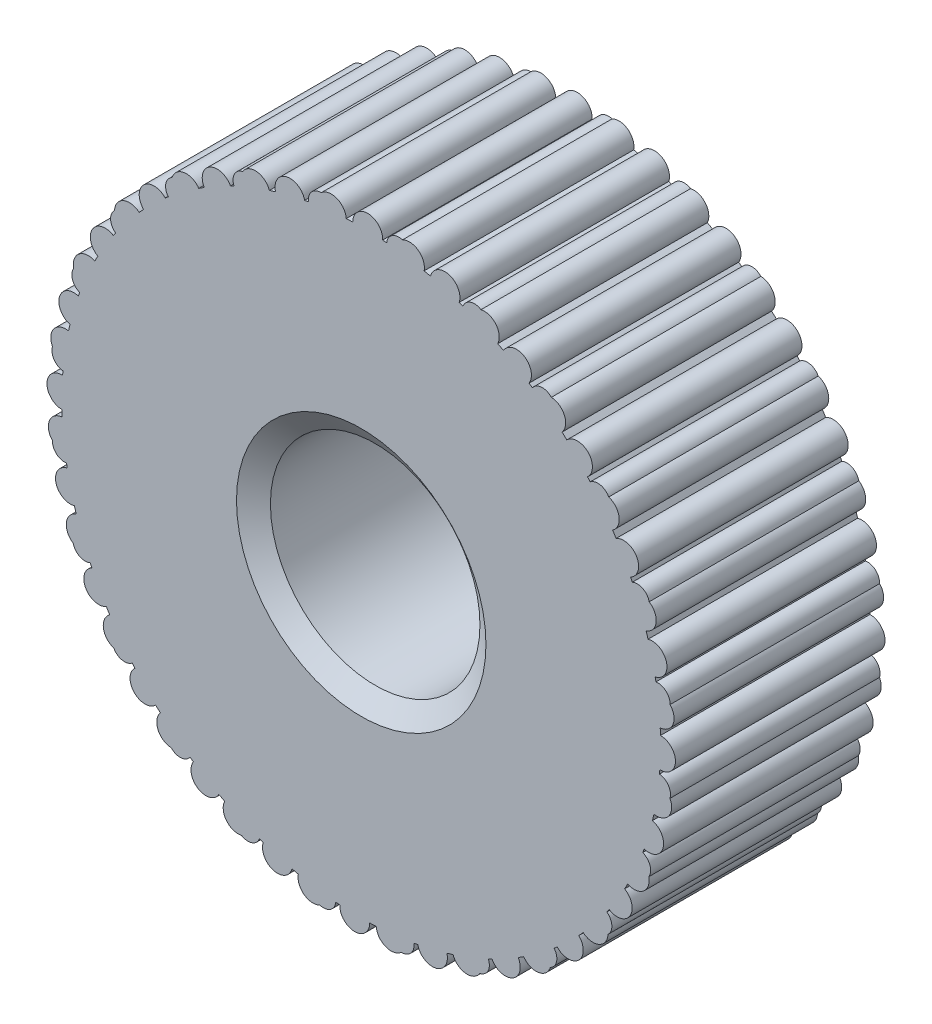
ISO-10303-21;
HEADER;
FILE_DESCRIPTION(('STEP AP214'),'2;1');
FILE_NAME('part.step','',(''),(''),'','','');
FILE_SCHEMA(('AUTOMOTIVE_DESIGN { 1 0 10303 214 1 1 1 1 }'));
ENDSEC;
DATA;
#1=APPLICATION_CONTEXT('core data for automotive mechanical design processes');
#2=APPLICATION_PROTOCOL_DEFINITION('international standard','automotive_design',2000,#1);
#3=PRODUCT_CONTEXT('',#1,'mechanical');
#4=PRODUCT('Part','Part','',(#3));
#5=PRODUCT_RELATED_PRODUCT_CATEGORY('part','',(#4));
#6=PRODUCT_DEFINITION_FORMATION('','',#4);
#7=PRODUCT_DEFINITION_CONTEXT('part definition',#1,'design');
#8=PRODUCT_DEFINITION('design','',#6,#7);
#9=PRODUCT_DEFINITION_SHAPE('','',#8);
#10=(LENGTH_UNIT() NAMED_UNIT(*) SI_UNIT(.MILLI.,.METRE.));
#11=(NAMED_UNIT(*) PLANE_ANGLE_UNIT() SI_UNIT($,.RADIAN.));
#12=(NAMED_UNIT(*) SI_UNIT($,.STERADIAN.) SOLID_ANGLE_UNIT());
#13=UNCERTAINTY_MEASURE_WITH_UNIT(LENGTH_MEASURE(1.E-05),#10,'distance_accuracy_value','');
#14=(GEOMETRIC_REPRESENTATION_CONTEXT(3) GLOBAL_UNCERTAINTY_ASSIGNED_CONTEXT((#13)) GLOBAL_UNIT_ASSIGNED_CONTEXT((#10,
#11,#12)) REPRESENTATION_CONTEXT('',''));
#15=CARTESIAN_POINT('',(0.,0.,0.));
#16=DIRECTION('',(0.,0.,1.));
#17=DIRECTION('',(1.,0.,0.));
#18=AXIS2_PLACEMENT_3D('',#15,#16,#17);
#19=CARTESIAN_POINT('',(0.,0.,-21.1705627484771));
#20=DIRECTION('',(0.,0.,1.));
#21=DIRECTION('',(1.,0.,0.));
#22=AXIS2_PLACEMENT_3D('',#19,#20,#21);
#23=CYLINDRICAL_SURFACE('',#22,6.);
#24=DIRECTION('',(0.,0.,1.));
#25=VECTOR('',#24,1.);
#26=CARTESIAN_POINT('',(4.44937133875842,-4.025306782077,-5.04852813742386));
#27=LINE('',#26,#25);
#28=CARTESIAN_POINT('',(4.44937133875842,-4.02530678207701,0.));
#29=VERTEX_POINT('',#28);
#30=CARTESIAN_POINT('',(4.44937133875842,-4.02530678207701,-4.2));
#31=VERTEX_POINT('',#30);
#32=EDGE_CURVE('E772',#29,#31,#27,.F.);
#33=ORIENTED_EDGE('',*,*,#32,.F.);
#34=CARTESIAN_POINT('',(0.,0.,0.));
#35=DIRECTION('',(0.,0.,1.));
#36=DIRECTION('',(1.,0.,0.));
#37=AXIS2_PLACEMENT_3D('',#34,#35,#36);
#38=CIRCLE('',#37,6.);
#39=CARTESIAN_POINT('',(4.36128870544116,-4.12057772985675,0.));
#40=VERTEX_POINT('',#39);
#41=EDGE_CURVE('E761',#29,#40,#38,.F.);
#42=ORIENTED_EDGE('',*,*,#41,.T.);
#43=DIRECTION('',(0.,0.,1.));
#44=VECTOR('',#43,1.);
#45=CARTESIAN_POINT('',(4.36128870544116,-4.12057772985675,-21.1705627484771));
#46=LINE('',#45,#44);
#47=CARTESIAN_POINT('',(4.36128870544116,-4.12057772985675,-4.2));
#48=VERTEX_POINT('',#47);
#49=EDGE_CURVE('E754',#40,#48,#46,.F.);
#50=ORIENTED_EDGE('',*,*,#49,.T.);
#51=CARTESIAN_POINT('',(0.,0.,-4.2));
#52=DIRECTION('',(0.,0.,1.));
#53=DIRECTION('',(1.,0.,0.));
#54=AXIS2_PLACEMENT_3D('',#51,#52,#53);
#55=CIRCLE('',#54,6.);
#56=EDGE_CURVE('E20',#48,#31,#55,.T.);
#57=ORIENTED_EDGE('',*,*,#56,.T.);
#58=EDGE_LOOP('',(#33,#42,#50,#57));
#59=FACE_BOUND('',#58,.T.);
#60=ADVANCED_FACE('F17',(#59),#23,.T.);
#61=CARTESIAN_POINT('',(4.1498726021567,-4.33342328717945,-5.04852813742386));
#62=DIRECTION('',(0.,0.,1.));
#63=DIRECTION('',(1.,0.,0.));
#64=AXIS2_PLACEMENT_3D('',#61,#62,#63);
#65=CYLINDRICAL_SURFACE('',#64,0.3);
#66=CARTESIAN_POINT('',(4.1498726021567,-4.33342328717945,0.));
#67=DIRECTION('',(0.,0.,1.));
#68=DIRECTION('',(1.,0.,0.));
#69=AXIS2_PLACEMENT_3D('',#66,#67,#68);
#70=CIRCLE('',#69,0.3);
#71=CARTESIAN_POINT('',(3.92808181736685,-4.53543528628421,0.));
#72=VERTEX_POINT('',#71);
#73=EDGE_CURVE('E745',#40,#72,#70,.F.);
#74=ORIENTED_EDGE('',*,*,#73,.T.);
#75=DIRECTION('',(0.,0.,1.));
#76=VECTOR('',#75,1.);
#77=CARTESIAN_POINT('',(3.92808181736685,-4.53543528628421,-21.1705627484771));
#78=LINE('',#77,#76);
#79=CARTESIAN_POINT('',(3.92808181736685,-4.53543528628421,-4.2));
#80=VERTEX_POINT('',#79);
#81=EDGE_CURVE('E757',#80,#72,#78,.T.);
#82=ORIENTED_EDGE('',*,*,#81,.F.);
#83=CARTESIAN_POINT('',(4.1498726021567,-4.33342328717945,-4.2));
#84=DIRECTION('',(0.,0.,1.));
#85=DIRECTION('',(1.,0.,0.));
#86=AXIS2_PLACEMENT_3D('',#83,#84,#85);
#87=CIRCLE('',#86,0.3);
#88=EDGE_CURVE('E750',#80,#48,#87,.T.);
#89=ORIENTED_EDGE('',*,*,#88,.T.);
#90=ORIENTED_EDGE('',*,*,#49,.F.);
#91=EDGE_LOOP('',(#74,#82,#89,#90));
#92=FACE_BOUND('',#91,.T.);
#93=ADVANCED_FACE('F752',(#92),#65,.T.);
#94=CARTESIAN_POINT('',(4.64501205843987,-3.79787611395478,-5.04852813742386));
#95=DIRECTION('',(0.,0.,1.));
#96=DIRECTION('',(1.,0.,0.));
#97=AXIS2_PLACEMENT_3D('',#94,#95,#96);
#98=CYLINDRICAL_SURFACE('',#97,0.3);
#99=CARTESIAN_POINT('',(4.64501205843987,-3.79787611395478,-4.2));
#100=DIRECTION('',(0.,0.,1.));
#101=DIRECTION('',(1.,0.,0.));
#102=AXIS2_PLACEMENT_3D('',#99,#100,#101);
#103=CIRCLE('',#102,0.3);
#104=CARTESIAN_POINT('',(4.94476426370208,-3.81006690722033,-4.2));
#105=VERTEX_POINT('',#104);
#106=EDGE_CURVE('E766',#31,#105,#103,.T.);
#107=ORIENTED_EDGE('',*,*,#106,.T.);
#108=DIRECTION('',(0.,0.,1.));
#109=VECTOR('',#108,1.);
#110=CARTESIAN_POINT('',(4.94476426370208,-3.81006690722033,-5.04852813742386));
#111=LINE('',#110,#109);
#112=CARTESIAN_POINT('',(4.94476426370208,-3.81006690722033,0.));
#113=VERTEX_POINT('',#112);
#114=EDGE_CURVE('E1500',#113,#105,#111,.F.);
#115=ORIENTED_EDGE('',*,*,#114,.F.);
#116=CARTESIAN_POINT('',(4.64501205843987,-3.79787611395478,0.));
#117=DIRECTION('',(0.,0.,1.));
#118=DIRECTION('',(1.,0.,0.));
#119=AXIS2_PLACEMENT_3D('',#116,#117,#118);
#120=CIRCLE('',#119,0.3);
#121=EDGE_CURVE('E1505',#113,#29,#120,.F.);
#122=ORIENTED_EDGE('',*,*,#121,.T.);
#123=ORIENTED_EDGE('',*,*,#32,.T.);
#124=EDGE_LOOP('',(#107,#115,#122,#123));
#125=FACE_BOUND('',#124,.T.);
#126=ADVANCED_FACE('F3124',(#125),#98,.T.);
#127=CARTESIAN_POINT('',(0.,0.,-21.1705627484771));
#128=DIRECTION('',(0.,0.,1.));
#129=DIRECTION('',(1.,0.,0.));
#130=AXIS2_PLACEMENT_3D('',#127,#128,#129);
#131=CYLINDRICAL_SURFACE('',#130,6.);
#132=DIRECTION('',(0.,0.,1.));
#133=VECTOR('',#132,1.);
#134=CARTESIAN_POINT('',(3.86658343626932,-4.58797695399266,-5.04852813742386));
#135=LINE('',#134,#133);
#136=CARTESIAN_POINT('',(3.86658343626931,-4.58797695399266,-4.2));
#137=VERTEX_POINT('',#136);
#138=CARTESIAN_POINT('',(3.86658343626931,-4.58797695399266,0.));
#139=VERTEX_POINT('',#138);
#140=EDGE_CURVE('E1497',#137,#139,#135,.T.);
#141=ORIENTED_EDGE('',*,*,#140,.F.);
#142=CARTESIAN_POINT('',(0.,0.,-4.2));
#143=DIRECTION('',(0.,0.,1.));
#144=DIRECTION('',(1.,0.,0.));
#145=AXIS2_PLACEMENT_3D('',#142,#143,#144);
#146=CIRCLE('',#145,6.);
#147=EDGE_CURVE('E1498',#137,#80,#146,.T.);
#148=ORIENTED_EDGE('',*,*,#147,.T.);
#149=ORIENTED_EDGE('',*,*,#81,.T.);
#150=CARTESIAN_POINT('',(0.,0.,0.));
#151=DIRECTION('',(0.,0.,1.));
#152=DIRECTION('',(1.,0.,0.));
#153=AXIS2_PLACEMENT_3D('',#150,#151,#152);
#154=CIRCLE('',#153,6.);
#155=EDGE_CURVE('E1501',#72,#139,#154,.F.);
#156=ORIENTED_EDGE('',*,*,#155,.T.);
#157=EDGE_LOOP('',(#141,#148,#149,#156));
#158=FACE_BOUND('',#157,.T.);
#159=ADVANCED_FACE('F1512',(#158),#131,.T.);
#160=CARTESIAN_POINT('',(4.77755899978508,-3.62972864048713,-5.04852813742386));
#161=DIRECTION('',(0.,0.,1.));
#162=DIRECTION('',(1.,0.,0.));
#163=AXIS2_PLACEMENT_3D('',#160,#161,#162);
#164=CYLINDRICAL_SURFACE('',#163,0.245925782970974);
#165=DIRECTION('',(0.,0.,1.));
#166=VECTOR('',#165,1.);
#167=CARTESIAN_POINT('',(4.92228861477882,-3.43089999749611,-21.1705627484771));
#168=LINE('',#167,#166);
#169=CARTESIAN_POINT('',(4.92228861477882,-3.43089999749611,0.));
#170=VERTEX_POINT('',#169);
#171=CARTESIAN_POINT('',(4.92228861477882,-3.43089999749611,-4.2));
#172=VERTEX_POINT('',#171);
#173=EDGE_CURVE('E1484',#170,#172,#168,.F.);
#174=ORIENTED_EDGE('',*,*,#173,.F.);
#175=CARTESIAN_POINT('',(4.77755899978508,-3.62972864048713,0.));
#176=DIRECTION('',(0.,0.,1.));
#177=DIRECTION('',(1.,0.,0.));
#178=AXIS2_PLACEMENT_3D('',#175,#176,#177);
#179=CIRCLE('',#178,0.245925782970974);
#180=EDGE_CURVE('E1493',#170,#113,#179,.F.);
#181=ORIENTED_EDGE('',*,*,#180,.T.);
#182=ORIENTED_EDGE('',*,*,#114,.T.);
#183=CARTESIAN_POINT('',(4.77755899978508,-3.62972864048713,-4.2));
#184=DIRECTION('',(0.,0.,1.));
#185=DIRECTION('',(1.,0.,0.));
#186=AXIS2_PLACEMENT_3D('',#183,#184,#185);
#187=CIRCLE('',#186,0.245925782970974);
#188=EDGE_CURVE('E1495',#105,#172,#187,.T.);
#189=ORIENTED_EDGE('',*,*,#188,.T.);
#190=EDGE_LOOP('',(#174,#181,#182,#189));
#191=FACE_BOUND('',#190,.T.);
#192=ADVANCED_FACE('F2007',(#191),#164,.T.);
#193=CARTESIAN_POINT('',(3.67532472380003,-4.74257189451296,-5.04852813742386));
#194=DIRECTION('',(0.,0.,1.));
#195=DIRECTION('',(1.,0.,0.));
#196=AXIS2_PLACEMENT_3D('',#193,#194,#195);
#197=CYLINDRICAL_SURFACE('',#196,0.245925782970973);
#198=CARTESIAN_POINT('',(3.67532472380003,-4.74257189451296,0.));
#199=DIRECTION('',(0.,0.,1.));
#200=DIRECTION('',(1.,0.,0.));
#201=AXIS2_PLACEMENT_3D('',#198,#199,#200);
#202=CIRCLE('',#201,0.245925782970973);
#203=CARTESIAN_POINT('',(3.79015762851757,-4.96004119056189,0.));
#204=VERTEX_POINT('',#203);
#205=EDGE_CURVE('E1488',#139,#204,#202,.F.);
#206=ORIENTED_EDGE('',*,*,#205,.T.);
#207=DIRECTION('',(0.,0.,1.));
#208=VECTOR('',#207,1.);
#209=CARTESIAN_POINT('',(3.79015762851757,-4.96004119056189,-5.04852813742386));
#210=LINE('',#209,#208);
#211=CARTESIAN_POINT('',(3.79015762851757,-4.96004119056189,-4.2));
#212=VERTEX_POINT('',#211);
#213=EDGE_CURVE('E1478',#212,#204,#210,.T.);
#214=ORIENTED_EDGE('',*,*,#213,.F.);
#215=CARTESIAN_POINT('',(3.67532472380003,-4.74257189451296,-4.2));
#216=DIRECTION('',(0.,0.,1.));
#217=DIRECTION('',(1.,0.,0.));
#218=AXIS2_PLACEMENT_3D('',#215,#216,#217);
#219=CIRCLE('',#218,0.245925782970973);
#220=EDGE_CURVE('E1491',#212,#137,#219,.T.);
#221=ORIENTED_EDGE('',*,*,#220,.T.);
#222=ORIENTED_EDGE('',*,*,#140,.T.);
#223=EDGE_LOOP('',(#206,#214,#221,#222));
#224=FACE_BOUND('',#223,.T.);
#225=ADVANCED_FACE('F2004',(#224),#197,.T.);
#226=CARTESIAN_POINT('',(0.,0.,-21.1705627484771));
#227=DIRECTION('',(0.,0.,1.));
#228=DIRECTION('',(1.,0.,0.));
#229=AXIS2_PLACEMENT_3D('',#226,#227,#228);
#230=CYLINDRICAL_SURFACE('',#229,6.);
#231=ORIENTED_EDGE('',*,*,#173,.T.);
#232=CARTESIAN_POINT('',(0.,0.,-4.2));
#233=DIRECTION('',(0.,0.,1.));
#234=DIRECTION('',(1.,0.,0.));
#235=AXIS2_PLACEMENT_3D('',#232,#233,#234);
#236=CIRCLE('',#235,6.);
#237=CARTESIAN_POINT('',(4.9680927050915,-3.36423169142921,-4.2));
#238=VERTEX_POINT('',#237);
#239=EDGE_CURVE('E1481',#172,#238,#236,.T.);
#240=ORIENTED_EDGE('',*,*,#239,.T.);
#241=DIRECTION('',(0.,0.,1.));
#242=VECTOR('',#241,1.);
#243=CARTESIAN_POINT('',(4.9680927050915,-3.36423169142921,-5.04852813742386));
#244=LINE('',#243,#242);
#245=CARTESIAN_POINT('',(4.9680927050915,-3.36423169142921,0.));
#246=VERTEX_POINT('',#245);
#247=EDGE_CURVE('E1474',#246,#238,#244,.F.);
#248=ORIENTED_EDGE('',*,*,#247,.F.);
#249=CARTESIAN_POINT('',(0.,0.,0.));
#250=DIRECTION('',(0.,0.,1.));
#251=DIRECTION('',(1.,0.,0.));
#252=AXIS2_PLACEMENT_3D('',#249,#250,#251);
#253=CIRCLE('',#252,6.);
#254=EDGE_CURVE('E1485',#246,#170,#253,.F.);
#255=ORIENTED_EDGE('',*,*,#254,.T.);
#256=EDGE_LOOP('',(#231,#240,#248,#255));
#257=FACE_BOUND('',#256,.T.);
#258=ADVANCED_FACE('F2006',(#257),#230,.T.);
#259=CARTESIAN_POINT('',(3.50377444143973,-4.87068420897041,-5.04852813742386));
#260=DIRECTION('',(0.,0.,1.));
#261=DIRECTION('',(1.,0.,0.));
#262=AXIS2_PLACEMENT_3D('',#259,#260,#261);
#263=CYLINDRICAL_SURFACE('',#262,0.3);
#264=CARTESIAN_POINT('',(3.50377444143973,-4.87068420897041,-4.2));
#265=DIRECTION('',(0.,0.,1.));
#266=DIRECTION('',(1.,0.,0.));
#267=AXIS2_PLACEMENT_3D('',#264,#265,#266);
#268=CIRCLE('',#267,0.3);
#269=CARTESIAN_POINT('',(3.25593662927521,-5.03972982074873,-4.2));
#270=VERTEX_POINT('',#269);
#271=EDGE_CURVE('E1475',#270,#212,#268,.T.);
#272=ORIENTED_EDGE('',*,*,#271,.T.);
#273=ORIENTED_EDGE('',*,*,#213,.T.);
#274=CARTESIAN_POINT('',(3.50377444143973,-4.87068420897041,0.));
#275=DIRECTION('',(0.,0.,1.));
#276=DIRECTION('',(1.,0.,0.));
#277=AXIS2_PLACEMENT_3D('',#274,#275,#276);
#278=CIRCLE('',#277,0.3);
#279=CARTESIAN_POINT('',(3.25593662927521,-5.03972982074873,0.));
#280=VERTEX_POINT('',#279);
#281=EDGE_CURVE('E1479',#204,#280,#278,.F.);
#282=ORIENTED_EDGE('',*,*,#281,.T.);
#283=DIRECTION('',(0.,0.,1.));
#284=VECTOR('',#283,1.);
#285=CARTESIAN_POINT('',(3.25593662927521,-5.03972982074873,-21.1705627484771));
#286=LINE('',#285,#284);
#287=EDGE_CURVE('E1470',#270,#280,#286,.T.);
#288=ORIENTED_EDGE('',*,*,#287,.F.);
#289=EDGE_LOOP('',(#272,#273,#282,#288));
#290=FACE_BOUND('',#289,.T.);
#291=ADVANCED_FACE('F2002',(#290),#263,.T.);
#292=CARTESIAN_POINT('',(0.,0.,-21.1705627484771));
#293=DIRECTION('',(0.,0.,1.));
#294=DIRECTION('',(1.,0.,0.));
#295=AXIS2_PLACEMENT_3D('',#292,#293,#294);
#296=CYLINDRICAL_SURFACE('',#295,6.);
#297=ORIENTED_EDGE('',*,*,#287,.T.);
#298=CARTESIAN_POINT('',(0.,0.,0.));
#299=DIRECTION('',(0.,0.,1.));
#300=DIRECTION('',(1.,0.,0.));
#301=AXIS2_PLACEMENT_3D('',#298,#299,#300);
#302=CIRCLE('',#301,6.);
#303=CARTESIAN_POINT('',(3.14619740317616,-5.10895702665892,0.));
#304=VERTEX_POINT('',#303);
#305=EDGE_CURVE('E1467',#280,#304,#302,.F.);
#306=ORIENTED_EDGE('',*,*,#305,.T.);
#307=DIRECTION('',(0.,0.,1.));
#308=VECTOR('',#307,1.);
#309=CARTESIAN_POINT('',(3.14619740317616,-5.10895702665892,-5.04852813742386));
#310=LINE('',#309,#308);
#311=CARTESIAN_POINT('',(3.14619740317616,-5.10895702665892,-4.2));
#312=VERTEX_POINT('',#311);
#313=EDGE_CURVE('E1464',#312,#304,#310,.T.);
#314=ORIENTED_EDGE('',*,*,#313,.F.);
#315=CARTESIAN_POINT('',(0.,0.,-4.2));
#316=DIRECTION('',(0.,0.,1.));
#317=DIRECTION('',(1.,0.,0.));
#318=AXIS2_PLACEMENT_3D('',#315,#316,#317);
#319=CIRCLE('',#318,6.);
#320=EDGE_CURVE('E1471',#312,#270,#319,.T.);
#321=ORIENTED_EDGE('',*,*,#320,.T.);
#322=EDGE_LOOP('',(#297,#306,#314,#321));
#323=FACE_BOUND('',#322,.T.);
#324=ADVANCED_FACE('F1996',(#323),#296,.T.);
#325=CARTESIAN_POINT('',(5.13004159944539,-3.11169940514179,-5.04852813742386));
#326=DIRECTION('',(0.,0.,1.));
#327=DIRECTION('',(1.,0.,0.));
#328=AXIS2_PLACEMENT_3D('',#325,#326,#327);
#329=CYLINDRICAL_SURFACE('',#328,0.3);
#330=DIRECTION('',(0.,0.,1.));
#331=VECTOR('',#330,1.);
#332=CARTESIAN_POINT('',(5.27916538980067,-2.85138787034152,-21.1705627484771));
#333=LINE('',#332,#331);
#334=CARTESIAN_POINT('',(5.27916538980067,-2.85138787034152,0.));
#335=VERTEX_POINT('',#334);
#336=CARTESIAN_POINT('',(5.27916538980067,-2.85138787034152,-4.2));
#337=VERTEX_POINT('',#336);
#338=EDGE_CURVE('E1461',#335,#337,#333,.F.);
#339=ORIENTED_EDGE('',*,*,#338,.F.);
#340=CARTESIAN_POINT('',(5.13004159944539,-3.11169940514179,0.));
#341=DIRECTION('',(0.,0.,1.));
#342=DIRECTION('',(1.,0.,0.));
#343=AXIS2_PLACEMENT_3D('',#340,#341,#342);
#344=CIRCLE('',#343,0.3);
#345=EDGE_CURVE('E1462',#335,#246,#344,.F.);
#346=ORIENTED_EDGE('',*,*,#345,.T.);
#347=ORIENTED_EDGE('',*,*,#247,.T.);
#348=CARTESIAN_POINT('',(5.13004159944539,-3.11169940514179,-4.2));
#349=DIRECTION('',(0.,0.,1.));
#350=DIRECTION('',(1.,0.,0.));
#351=AXIS2_PLACEMENT_3D('',#348,#349,#350);
#352=CIRCLE('',#351,0.3);
#353=EDGE_CURVE('E1465',#238,#337,#352,.T.);
#354=ORIENTED_EDGE('',*,*,#353,.T.);
#355=EDGE_LOOP('',(#339,#346,#347,#354));
#356=FACE_BOUND('',#355,.T.);
#357=ADVANCED_FACE('F2364',(#356),#329,.T.);
#358=CARTESIAN_POINT('',(0.,0.,-21.1705627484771));
#359=DIRECTION('',(0.,0.,1.));
#360=DIRECTION('',(1.,0.,0.));
#361=AXIS2_PLACEMENT_3D('',#358,#359,#360);
#362=CYLINDRICAL_SURFACE('',#361,6.);
#363=DIRECTION('',(0.,0.,1.));
#364=VECTOR('',#363,1.);
#365=CARTESIAN_POINT('',(5.33958874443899,-2.73656573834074,-5.04852813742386));
#366=LINE('',#365,#364);
#367=CARTESIAN_POINT('',(5.33958874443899,-2.73656573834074,0.));
#368=VERTEX_POINT('',#367);
#369=CARTESIAN_POINT('',(5.339588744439,-2.73656573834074,-4.2));
#370=VERTEX_POINT('',#369);
#371=EDGE_CURVE('E1452',#368,#370,#366,.F.);
#372=ORIENTED_EDGE('',*,*,#371,.F.);
#373=CARTESIAN_POINT('',(0.,0.,0.));
#374=DIRECTION('',(0.,0.,1.));
#375=DIRECTION('',(1.,0.,0.));
#376=AXIS2_PLACEMENT_3D('',#373,#374,#375);
#377=CIRCLE('',#376,6.);
#378=EDGE_CURVE('E1455',#368,#335,#377,.F.);
#379=ORIENTED_EDGE('',*,*,#378,.T.);
#380=ORIENTED_EDGE('',*,*,#338,.T.);
#381=CARTESIAN_POINT('',(0.,0.,-4.2));
#382=DIRECTION('',(0.,0.,1.));
#383=DIRECTION('',(1.,0.,0.));
#384=AXIS2_PLACEMENT_3D('',#381,#382,#383);
#385=CIRCLE('',#384,6.);
#386=EDGE_CURVE('E1458',#337,#370,#385,.T.);
#387=ORIENTED_EDGE('',*,*,#386,.T.);
#388=EDGE_LOOP('',(#372,#379,#380,#387));
#389=FACE_BOUND('',#388,.T.);
#390=ADVANCED_FACE('F2361',(#389),#362,.T.);
#391=CARTESIAN_POINT('',(2.88689664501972,-5.25983153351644,-5.04852813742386));
#392=DIRECTION('',(0.,0.,1.));
#393=DIRECTION('',(1.,0.,0.));
#394=AXIS2_PLACEMENT_3D('',#391,#392,#393);
#395=CYLINDRICAL_SURFACE('',#394,0.3);
#396=CARTESIAN_POINT('',(2.88689664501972,-5.25983153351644,0.));
#397=DIRECTION('',(0.,0.,1.));
#398=DIRECTION('',(1.,0.,0.));
#399=AXIS2_PLACEMENT_3D('',#396,#397,#398);
#400=CIRCLE('',#399,0.3);
#401=CARTESIAN_POINT('',(2.62037864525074,-5.39755646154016,0.));
#402=VERTEX_POINT('',#401);
#403=EDGE_CURVE('E1450',#304,#402,#400,.F.);
#404=ORIENTED_EDGE('',*,*,#403,.T.);
#405=DIRECTION('',(0.,0.,1.));
#406=VECTOR('',#405,1.);
#407=CARTESIAN_POINT('',(2.62037864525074,-5.39755646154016,-21.1705627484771));
#408=LINE('',#407,#406);
#409=CARTESIAN_POINT('',(2.62037864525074,-5.39755646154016,-4.2));
#410=VERTEX_POINT('',#409);
#411=EDGE_CURVE('E1449',#410,#402,#408,.T.);
#412=ORIENTED_EDGE('',*,*,#411,.F.);
#413=CARTESIAN_POINT('',(2.88689664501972,-5.25983153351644,-4.2));
#414=DIRECTION('',(0.,0.,1.));
#415=DIRECTION('',(1.,0.,0.));
#416=AXIS2_PLACEMENT_3D('',#413,#414,#415);
#417=CIRCLE('',#416,0.3);
#418=EDGE_CURVE('E1453',#410,#312,#417,.T.);
#419=ORIENTED_EDGE('',*,*,#418,.T.);
#420=ORIENTED_EDGE('',*,*,#313,.T.);
#421=EDGE_LOOP('',(#404,#412,#419,#420));
#422=FACE_BOUND('',#421,.T.);
#423=ADVANCED_FACE('F1998',(#422),#395,.T.);
#424=CARTESIAN_POINT('',(0.,0.,-21.1705627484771));
#425=DIRECTION('',(0.,0.,1.));
#426=DIRECTION('',(1.,0.,0.));
#427=AXIS2_PLACEMENT_3D('',#424,#425,#426);
#428=CYLINDRICAL_SURFACE('',#427,6.);
#429=DIRECTION('',(0.,0.,1.));
#430=VECTOR('',#429,1.);
#431=CARTESIAN_POINT('',(2.54737698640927,-5.43239086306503,-5.04852813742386));
#432=LINE('',#431,#430);
#433=CARTESIAN_POINT('',(2.54737698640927,-5.43239086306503,-4.2));
#434=VERTEX_POINT('',#433);
#435=CARTESIAN_POINT('',(2.54737698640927,-5.43239086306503,0.));
#436=VERTEX_POINT('',#435);
#437=EDGE_CURVE('E1439',#434,#436,#432,.T.);
#438=ORIENTED_EDGE('',*,*,#437,.F.);
#439=CARTESIAN_POINT('',(0.,0.,-4.2));
#440=DIRECTION('',(0.,0.,1.));
#441=DIRECTION('',(1.,0.,0.));
#442=AXIS2_PLACEMENT_3D('',#439,#440,#441);
#443=CIRCLE('',#442,6.);
#444=EDGE_CURVE('E1443',#434,#410,#443,.T.);
#445=ORIENTED_EDGE('',*,*,#444,.T.);
#446=ORIENTED_EDGE('',*,*,#411,.T.);
#447=CARTESIAN_POINT('',(0.,0.,0.));
#448=DIRECTION('',(0.,0.,1.));
#449=DIRECTION('',(1.,0.,0.));
#450=AXIS2_PLACEMENT_3D('',#447,#448,#449);
#451=CIRCLE('',#450,6.);
#452=EDGE_CURVE('E1446',#402,#436,#451,.F.);
#453=ORIENTED_EDGE('',*,*,#452,.T.);
#454=EDGE_LOOP('',(#438,#445,#446,#453));
#455=FACE_BOUND('',#454,.T.);
#456=ADVANCED_FACE('F1990',(#455),#428,.T.);
#457=CARTESIAN_POINT('',(5.46969977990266,-2.46624903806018,-5.04852813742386));
#458=DIRECTION('',(0.,0.,1.));
#459=DIRECTION('',(1.,0.,0.));
#460=AXIS2_PLACEMENT_3D('',#457,#458,#459);
#461=CYLINDRICAL_SURFACE('',#460,0.3);
#462=DIRECTION('',(0.,0.,1.));
#463=VECTOR('',#462,1.);
#464=CARTESIAN_POINT('',(5.76239338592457,-2.40044286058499,-5.04852813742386));
#465=LINE('',#464,#463);
#466=CARTESIAN_POINT('',(5.76239338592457,-2.40044286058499,0.));
#467=VERTEX_POINT('',#466);
#468=CARTESIAN_POINT('',(5.76239338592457,-2.40044286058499,-4.2));
#469=VERTEX_POINT('',#468);
#470=EDGE_CURVE('E1436',#467,#469,#465,.F.);
#471=ORIENTED_EDGE('',*,*,#470,.F.);
#472=CARTESIAN_POINT('',(5.46969977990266,-2.46624903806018,0.));
#473=DIRECTION('',(0.,0.,1.));
#474=DIRECTION('',(1.,0.,0.));
#475=AXIS2_PLACEMENT_3D('',#472,#473,#474);
#476=CIRCLE('',#475,0.3);
#477=EDGE_CURVE('E1437',#467,#368,#476,.F.);
#478=ORIENTED_EDGE('',*,*,#477,.T.);
#479=ORIENTED_EDGE('',*,*,#371,.T.);
#480=CARTESIAN_POINT('',(5.46969977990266,-2.46624903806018,-4.2));
#481=DIRECTION('',(0.,0.,1.));
#482=DIRECTION('',(1.,0.,0.));
#483=AXIS2_PLACEMENT_3D('',#480,#481,#482);
#484=CIRCLE('',#483,0.3);
#485=EDGE_CURVE('E1440',#370,#469,#484,.T.);
#486=ORIENTED_EDGE('',*,*,#485,.T.);
#487=EDGE_LOOP('',(#471,#478,#479,#486));
#488=FACE_BOUND('',#487,.T.);
#489=ADVANCED_FACE('F2353',(#488),#461,.T.);
#490=CARTESIAN_POINT('',(2.32262314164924,-5.53221671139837,-5.04852813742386));
#491=DIRECTION('',(0.,0.,1.));
#492=DIRECTION('',(1.,0.,0.));
#493=AXIS2_PLACEMENT_3D('',#490,#491,#492);
#494=CYLINDRICAL_SURFACE('',#493,0.245925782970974);
#495=CARTESIAN_POINT('',(2.32262314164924,-5.53221671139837,0.));
#496=DIRECTION('',(0.,0.,1.));
#497=DIRECTION('',(1.,0.,0.));
#498=AXIS2_PLACEMENT_3D('',#495,#496,#497);
#499=CIRCLE('',#498,0.245925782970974);
#500=CARTESIAN_POINT('',(2.37725801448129,-5.77199686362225,0.));
#501=VERTEX_POINT('',#500);
#502=EDGE_CURVE('E1431',#436,#501,#499,.F.);
#503=ORIENTED_EDGE('',*,*,#502,.T.);
#504=DIRECTION('',(0.,0.,1.));
#505=VECTOR('',#504,1.);
#506=CARTESIAN_POINT('',(2.3772580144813,-5.77199686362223,-5.04852813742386));
#507=LINE('',#506,#505);
#508=CARTESIAN_POINT('',(2.37725801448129,-5.77199686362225,-4.2));
#509=VERTEX_POINT('',#508);
#510=EDGE_CURVE('E1421',#509,#501,#507,.T.);
#511=ORIENTED_EDGE('',*,*,#510,.F.);
#512=CARTESIAN_POINT('',(2.32262314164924,-5.53221671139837,-4.2));
#513=DIRECTION('',(0.,0.,1.));
#514=DIRECTION('',(1.,0.,0.));
#515=AXIS2_PLACEMENT_3D('',#512,#513,#514);
#516=CIRCLE('',#515,0.245925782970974);
#517=EDGE_CURVE('E1434',#509,#434,#516,.T.);
#518=ORIENTED_EDGE('',*,*,#517,.T.);
#519=ORIENTED_EDGE('',*,*,#437,.T.);
#520=EDGE_LOOP('',(#503,#511,#518,#519));
#521=FACE_BOUND('',#520,.T.);
#522=ADVANCED_FACE('F1987',(#521),#494,.T.);
#523=CARTESIAN_POINT('',(5.55421052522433,-2.2695253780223,-5.04852813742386));
#524=DIRECTION('',(0.,0.,1.));
#525=DIRECTION('',(1.,0.,0.));
#526=AXIS2_PLACEMENT_3D('',#523,#524,#525);
#527=CYLINDRICAL_SURFACE('',#526,0.245925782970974);
#528=DIRECTION('',(0.,0.,1.));
#529=VECTOR('',#528,1.);
#530=CARTESIAN_POINT('',(5.64254795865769,-2.04001287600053,-21.1705627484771));
#531=LINE('',#530,#529);
#532=CARTESIAN_POINT('',(5.64254795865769,-2.04001287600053,0.));
#533=VERTEX_POINT('',#532);
#534=CARTESIAN_POINT('',(5.64254795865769,-2.04001287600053,-4.2));
#535=VERTEX_POINT('',#534);
#536=EDGE_CURVE('E1417',#533,#535,#531,.F.);
#537=ORIENTED_EDGE('',*,*,#536,.F.);
#538=CARTESIAN_POINT('',(5.55421052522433,-2.2695253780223,0.));
#539=DIRECTION('',(0.,0.,1.));
#540=DIRECTION('',(1.,0.,0.));
#541=AXIS2_PLACEMENT_3D('',#538,#539,#540);
#542=CIRCLE('',#541,0.245925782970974);
#543=EDGE_CURVE('E1427',#533,#467,#542,.F.);
#544=ORIENTED_EDGE('',*,*,#543,.T.);
#545=ORIENTED_EDGE('',*,*,#470,.T.);
#546=CARTESIAN_POINT('',(5.55421052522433,-2.2695253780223,-4.2));
#547=DIRECTION('',(0.,0.,1.));
#548=DIRECTION('',(1.,0.,0.));
#549=AXIS2_PLACEMENT_3D('',#546,#547,#548);
#550=CIRCLE('',#549,0.245925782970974);
#551=EDGE_CURVE('E1429',#469,#535,#550,.T.);
#552=ORIENTED_EDGE('',*,*,#551,.T.);
#553=EDGE_LOOP('',(#537,#544,#545,#552));
#554=FACE_BOUND('',#553,.T.);
#555=ADVANCED_FACE('F2347',(#554),#527,.T.);
#556=CARTESIAN_POINT('',(2.12376038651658,-5.6115632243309,-5.04852813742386));
#557=DIRECTION('',(0.,0.,1.));
#558=DIRECTION('',(1.,0.,0.));
#559=AXIS2_PLACEMENT_3D('',#556,#557,#558);
#560=CYLINDRICAL_SURFACE('',#559,0.3);
#561=CARTESIAN_POINT('',(2.12376038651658,-5.6115632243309,-4.2));
#562=DIRECTION('',(0.,0.,1.));
#563=DIRECTION('',(1.,0.,0.));
#564=AXIS2_PLACEMENT_3D('',#561,#562,#563);
#565=CIRCLE('',#564,0.3);
#566=CARTESIAN_POINT('',(1.84061521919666,-5.71070360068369,-4.2));
#567=VERTEX_POINT('',#566);
#568=EDGE_CURVE('E1422',#567,#509,#565,.T.);
#569=ORIENTED_EDGE('',*,*,#568,.T.);
#570=ORIENTED_EDGE('',*,*,#510,.T.);
#571=CARTESIAN_POINT('',(2.12376038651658,-5.6115632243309,0.));
#572=DIRECTION('',(0.,0.,1.));
#573=DIRECTION('',(1.,0.,0.));
#574=AXIS2_PLACEMENT_3D('',#571,#572,#573);
#575=CIRCLE('',#574,0.3);
#576=CARTESIAN_POINT('',(1.84061521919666,-5.71070360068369,0.));
#577=VERTEX_POINT('',#576);
#578=EDGE_CURVE('E1425',#501,#577,#575,.F.);
#579=ORIENTED_EDGE('',*,*,#578,.T.);
#580=DIRECTION('',(0.,0.,1.));
#581=VECTOR('',#580,1.);
#582=CARTESIAN_POINT('',(1.84061521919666,-5.71070360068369,-21.1705627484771));
#583=LINE('',#582,#581);
#584=EDGE_CURVE('E1410',#567,#577,#583,.T.);
#585=ORIENTED_EDGE('',*,*,#584,.F.);
#586=EDGE_LOOP('',(#569,#570,#579,#585));
#587=FACE_BOUND('',#586,.T.);
#588=ADVANCED_FACE('F1984',(#587),#560,.T.);
#589=CARTESIAN_POINT('',(0.,0.,-21.1705627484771));
#590=DIRECTION('',(0.,0.,1.));
#591=DIRECTION('',(1.,0.,0.));
#592=AXIS2_PLACEMENT_3D('',#589,#590,#591);
#593=CYLINDRICAL_SURFACE('',#592,6.);
#594=ORIENTED_EDGE('',*,*,#536,.T.);
#595=CARTESIAN_POINT('',(0.,0.,-4.2));
#596=DIRECTION('',(0.,0.,1.));
#597=DIRECTION('',(1.,0.,0.));
#598=AXIS2_PLACEMENT_3D('',#595,#596,#597);
#599=CIRCLE('',#598,6.);
#600=CARTESIAN_POINT('',(5.66953628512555,-1.96376126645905,-4.2));
#601=VERTEX_POINT('',#600);
#602=EDGE_CURVE('E1414',#535,#601,#599,.T.);
#603=ORIENTED_EDGE('',*,*,#602,.T.);
#604=DIRECTION('',(0.,0.,1.));
#605=VECTOR('',#604,1.);
#606=CARTESIAN_POINT('',(5.66953628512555,-1.96376126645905,-5.04852813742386));
#607=LINE('',#606,#605);
#608=CARTESIAN_POINT('',(5.66953628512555,-1.96376126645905,0.));
#609=VERTEX_POINT('',#608);
#610=EDGE_CURVE('E1409',#609,#601,#607,.F.);
#611=ORIENTED_EDGE('',*,*,#610,.F.);
#612=CARTESIAN_POINT('',(0.,0.,0.));
#613=DIRECTION('',(0.,0.,1.));
#614=DIRECTION('',(1.,0.,0.));
#615=AXIS2_PLACEMENT_3D('',#612,#613,#614);
#616=CIRCLE('',#615,6.);
#617=EDGE_CURVE('E1418',#609,#533,#616,.F.);
#618=ORIENTED_EDGE('',*,*,#617,.T.);
#619=EDGE_LOOP('',(#594,#603,#611,#618));
#620=FACE_BOUND('',#619,.T.);
#621=ADVANCED_FACE('F2341',(#620),#593,.T.);
#622=CARTESIAN_POINT('',(0.,0.,-21.1705627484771));
#623=DIRECTION('',(0.,0.,1.));
#624=DIRECTION('',(1.,0.,0.));
#625=AXIS2_PLACEMENT_3D('',#622,#623,#624);
#626=CYLINDRICAL_SURFACE('',#625,6.);
#627=ORIENTED_EDGE('',*,*,#584,.T.);
#628=CARTESIAN_POINT('',(0.,0.,0.));
#629=DIRECTION('',(0.,0.,1.));
#630=DIRECTION('',(1.,0.,0.));
#631=AXIS2_PLACEMENT_3D('',#628,#629,#630);
#632=CIRCLE('',#631,6.);
#633=CARTESIAN_POINT('',(1.71669794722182,-5.74916934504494,0.));
#634=VERTEX_POINT('',#633);
#635=EDGE_CURVE('E1406',#577,#634,#632,.F.);
#636=ORIENTED_EDGE('',*,*,#635,.T.);
#637=DIRECTION('',(0.,0.,1.));
#638=VECTOR('',#637,1.);
#639=CARTESIAN_POINT('',(1.71669794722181,-5.74916934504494,-5.04852813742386));
#640=LINE('',#639,#638);
#641=CARTESIAN_POINT('',(1.71669794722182,-5.74916934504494,-4.2));
#642=VERTEX_POINT('',#641);
#643=EDGE_CURVE('E1405',#642,#634,#640,.T.);
#644=ORIENTED_EDGE('',*,*,#643,.F.);
#645=CARTESIAN_POINT('',(0.,0.,-4.2));
#646=DIRECTION('',(0.,0.,1.));
#647=DIRECTION('',(1.,0.,0.));
#648=AXIS2_PLACEMENT_3D('',#645,#646,#647);
#649=CIRCLE('',#648,6.);
#650=EDGE_CURVE('E1411',#642,#567,#649,.T.);
#651=ORIENTED_EDGE('',*,*,#650,.T.);
#652=EDGE_LOOP('',(#627,#636,#644,#651));
#653=FACE_BOUND('',#652,.T.);
#654=ADVANCED_FACE('F1977',(#653),#626,.T.);
#655=CARTESIAN_POINT('',(5.76060673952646,-1.67791835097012,-5.04852813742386));
#656=DIRECTION('',(0.,0.,1.));
#657=DIRECTION('',(1.,0.,0.));
#658=AXIS2_PLACEMENT_3D('',#655,#656,#657);
#659=CYLINDRICAL_SURFACE('',#658,0.3);
#660=DIRECTION('',(0.,0.,1.));
#661=VECTOR('',#660,1.);
#662=CARTESIAN_POINT('',(5.83727567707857,-1.38788063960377,-21.1705627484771));
#663=LINE('',#662,#661);
#664=CARTESIAN_POINT('',(5.83727567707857,-1.38788063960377,0.));
#665=VERTEX_POINT('',#664);
#666=CARTESIAN_POINT('',(5.83727567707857,-1.38788063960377,-4.2));
#667=VERTEX_POINT('',#666);
#668=EDGE_CURVE('E1396',#665,#667,#663,.F.);
#669=ORIENTED_EDGE('',*,*,#668,.F.);
#670=CARTESIAN_POINT('',(5.76060673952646,-1.67791835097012,0.));
#671=DIRECTION('',(0.,0.,1.));
#672=DIRECTION('',(1.,0.,0.));
#673=AXIS2_PLACEMENT_3D('',#670,#671,#672);
#674=CIRCLE('',#673,0.3);
#675=EDGE_CURVE('E1401',#665,#609,#674,.F.);
#676=ORIENTED_EDGE('',*,*,#675,.T.);
#677=ORIENTED_EDGE('',*,*,#610,.T.);
#678=CARTESIAN_POINT('',(5.76060673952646,-1.67791835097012,-4.2));
#679=DIRECTION('',(0.,0.,1.));
#680=DIRECTION('',(1.,0.,0.));
#681=AXIS2_PLACEMENT_3D('',#678,#679,#680);
#682=CIRCLE('',#681,0.3);
#683=EDGE_CURVE('E1403',#601,#667,#682,.T.);
#684=ORIENTED_EDGE('',*,*,#683,.T.);
#685=EDGE_LOOP('',(#669,#676,#677,#684));
#686=FACE_BOUND('',#685,.T.);
#687=ADVANCED_FACE('F2335',(#686),#659,.T.);
#688=CARTESIAN_POINT('',(1.427183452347,-5.82779095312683,-5.04852813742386));
#689=DIRECTION('',(0.,0.,1.));
#690=DIRECTION('',(1.,0.,0.));
#691=AXIS2_PLACEMENT_3D('',#688,#689,#690);
#692=CYLINDRICAL_SURFACE('',#691,0.3);
#693=CARTESIAN_POINT('',(1.427183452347,-5.82779095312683,0.));
#694=DIRECTION('',(0.,0.,1.));
#695=DIRECTION('',(1.,0.,0.));
#696=AXIS2_PLACEMENT_3D('',#693,#694,#695);
#697=CIRCLE('',#696,0.3);
#698=CARTESIAN_POINT('',(1.13410099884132,-5.8918430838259,0.));
#699=VERTEX_POINT('',#698);
#700=EDGE_CURVE('E1397',#634,#699,#697,.F.);
#701=ORIENTED_EDGE('',*,*,#700,.T.);
#702=DIRECTION('',(0.,0.,1.));
#703=VECTOR('',#702,1.);
#704=CARTESIAN_POINT('',(1.13410099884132,-5.8918430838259,-21.1705627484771));
#705=LINE('',#704,#703);
#706=CARTESIAN_POINT('',(1.13410099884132,-5.8918430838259,-4.2));
#707=VERTEX_POINT('',#706);
#708=EDGE_CURVE('E1389',#707,#699,#705,.T.);
#709=ORIENTED_EDGE('',*,*,#708,.F.);
#710=CARTESIAN_POINT('',(1.427183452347,-5.82779095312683,-4.2));
#711=DIRECTION('',(0.,0.,1.));
#712=DIRECTION('',(1.,0.,0.));
#713=AXIS2_PLACEMENT_3D('',#710,#711,#712);
#714=CIRCLE('',#713,0.3);
#715=EDGE_CURVE('E1399',#707,#642,#714,.T.);
#716=ORIENTED_EDGE('',*,*,#715,.T.);
#717=ORIENTED_EDGE('',*,*,#643,.T.);
#718=EDGE_LOOP('',(#701,#709,#716,#717));
#719=FACE_BOUND('',#718,.T.);
#720=ADVANCED_FACE('F1979',(#719),#692,.T.);
#721=CARTESIAN_POINT('',(0.,0.,-21.1705627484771));
#722=DIRECTION('',(0.,0.,1.));
#723=DIRECTION('',(1.,0.,0.));
#724=AXIS2_PLACEMENT_3D('',#721,#722,#723);
#725=CYLINDRICAL_SURFACE('',#724,6.);
#726=DIRECTION('',(0.,0.,1.));
#727=VECTOR('',#726,1.);
#728=CARTESIAN_POINT('',(5.86592200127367,-1.26133226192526,-5.04852813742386));
#729=LINE('',#728,#727);
#730=CARTESIAN_POINT('',(5.86592200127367,-1.26133226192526,0.));
#731=VERTEX_POINT('',#730);
#732=CARTESIAN_POINT('',(5.86592200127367,-1.26133226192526,-4.2));
#733=VERTEX_POINT('',#732);
#734=EDGE_CURVE('E1385',#731,#733,#729,.F.);
#735=ORIENTED_EDGE('',*,*,#734,.F.);
#736=CARTESIAN_POINT('',(0.,0.,0.));
#737=DIRECTION('',(0.,0.,1.));
#738=DIRECTION('',(1.,0.,0.));
#739=AXIS2_PLACEMENT_3D('',#736,#737,#738);
#740=CIRCLE('',#739,6.);
#741=EDGE_CURVE('E1390',#731,#665,#740,.F.);
#742=ORIENTED_EDGE('',*,*,#741,.T.);
#743=ORIENTED_EDGE('',*,*,#668,.T.);
#744=CARTESIAN_POINT('',(0.,0.,-4.2));
#745=DIRECTION('',(0.,0.,1.));
#746=DIRECTION('',(1.,0.,0.));
#747=AXIS2_PLACEMENT_3D('',#744,#745,#746);
#748=CIRCLE('',#747,6.);
#749=EDGE_CURVE('E1393',#667,#733,#748,.T.);
#750=ORIENTED_EDGE('',*,*,#749,.T.);
#751=EDGE_LOOP('',(#735,#742,#743,#750));
#752=FACE_BOUND('',#751,.T.);
#753=ADVANCED_FACE('F2329',(#752),#725,.T.);
#754=CARTESIAN_POINT('',(0.,0.,-21.1705627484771));
#755=DIRECTION('',(0.,0.,1.));
#756=DIRECTION('',(1.,0.,0.));
#757=AXIS2_PLACEMENT_3D('',#754,#755,#756);
#758=CYLINDRICAL_SURFACE('',#757,6.);
#759=DIRECTION('',(0.,0.,1.));
#760=VECTOR('',#759,1.);
#761=CARTESIAN_POINT('',(1.05457100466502,-5.90659631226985,-5.04852813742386));
#762=LINE('',#761,#760);
#763=CARTESIAN_POINT('',(1.05457100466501,-5.90659631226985,-4.2));
#764=VERTEX_POINT('',#763);
#765=CARTESIAN_POINT('',(1.05457100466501,-5.90659631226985,0.));
#766=VERTEX_POINT('',#765);
#767=EDGE_CURVE('E1381',#764,#766,#762,.T.);
#768=ORIENTED_EDGE('',*,*,#767,.F.);
#769=CARTESIAN_POINT('',(0.,0.,-4.2));
#770=DIRECTION('',(0.,0.,1.));
#771=DIRECTION('',(1.,0.,0.));
#772=AXIS2_PLACEMENT_3D('',#769,#770,#771);
#773=CIRCLE('',#772,6.);
#774=EDGE_CURVE('E1382',#764,#707,#773,.T.);
#775=ORIENTED_EDGE('',*,*,#774,.T.);
#776=ORIENTED_EDGE('',*,*,#708,.T.);
#777=CARTESIAN_POINT('',(0.,0.,0.));
#778=DIRECTION('',(0.,0.,1.));
#779=DIRECTION('',(1.,0.,0.));
#780=AXIS2_PLACEMENT_3D('',#777,#778,#779);
#781=CIRCLE('',#780,6.);
#782=EDGE_CURVE('E1386',#699,#766,#781,.F.);
#783=ORIENTED_EDGE('',*,*,#782,.T.);
#784=EDGE_LOOP('',(#768,#775,#776,#783));
#785=FACE_BOUND('',#784,.T.);
#786=ADVANCED_FACE('F1971',(#785),#758,.T.);
#787=CARTESIAN_POINT('',(5.92163650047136,-0.966551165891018,-5.04852813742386));
#788=DIRECTION('',(0.,0.,1.));
#789=DIRECTION('',(1.,0.,0.));
#790=AXIS2_PLACEMENT_3D('',#787,#788,#789);
#791=CYLINDRICAL_SURFACE('',#790,0.3);
#792=DIRECTION('',(0.,0.,1.));
#793=VECTOR('',#792,1.);
#794=CARTESIAN_POINT('',(6.18732492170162,-0.827232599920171,-5.04852813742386));
#795=LINE('',#794,#793);
#796=CARTESIAN_POINT('',(6.18732492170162,-0.827232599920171,0.));
#797=VERTEX_POINT('',#796);
#798=CARTESIAN_POINT('',(6.18732492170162,-0.827232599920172,-4.2));
#799=VERTEX_POINT('',#798);
#800=EDGE_CURVE('E1370',#797,#799,#795,.F.);
#801=ORIENTED_EDGE('',*,*,#800,.F.);
#802=CARTESIAN_POINT('',(5.92163650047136,-0.966551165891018,0.));
#803=DIRECTION('',(0.,0.,1.));
#804=DIRECTION('',(1.,0.,0.));
#805=AXIS2_PLACEMENT_3D('',#802,#803,#804);
#806=CIRCLE('',#805,0.3);
#807=EDGE_CURVE('E1376',#797,#731,#806,.F.);
#808=ORIENTED_EDGE('',*,*,#807,.T.);
#809=ORIENTED_EDGE('',*,*,#734,.T.);
#810=CARTESIAN_POINT('',(5.92163650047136,-0.966551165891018,-4.2));
#811=DIRECTION('',(0.,0.,1.));
#812=DIRECTION('',(1.,0.,0.));
#813=AXIS2_PLACEMENT_3D('',#810,#811,#812);
#814=CIRCLE('',#813,0.3);
#815=EDGE_CURVE('E1378',#733,#799,#814,.T.);
#816=ORIENTED_EDGE('',*,*,#815,.T.);
#817=EDGE_LOOP('',(#801,#808,#809,#816));
#818=FACE_BOUND('',#817,.T.);
#819=ADVANCED_FACE('F2323',(#818),#791,.T.);
#820=CARTESIAN_POINT('',(0.81163863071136,-5.94485010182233,-5.04852813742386));
#821=DIRECTION('',(0.,0.,1.));
#822=DIRECTION('',(1.,0.,0.));
#823=AXIS2_PLACEMENT_3D('',#820,#821,#822);
#824=CYLINDRICAL_SURFACE('',#823,0.245925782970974);
#825=CARTESIAN_POINT('',(0.81163863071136,-5.94485010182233,0.));
#826=DIRECTION('',(0.,0.,1.));
#827=DIRECTION('',(1.,0.,0.));
#828=AXIS2_PLACEMENT_3D('',#825,#826,#827);
#829=CIRCLE('',#828,0.245925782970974);
#830=CARTESIAN_POINT('',(0.802352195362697,-6.19060048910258,0.));
#831=VERTEX_POINT('',#830);
#832=EDGE_CURVE('E1371',#766,#831,#829,.F.);
#833=ORIENTED_EDGE('',*,*,#832,.T.);
#834=DIRECTION('',(0.,0.,1.));
#835=VECTOR('',#834,1.);
#836=CARTESIAN_POINT('',(0.802352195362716,-6.19060048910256,-5.04852813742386));
#837=LINE('',#836,#835);
#838=CARTESIAN_POINT('',(0.802352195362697,-6.19060048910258,-4.2));
#839=VERTEX_POINT('',#838);
#840=EDGE_CURVE('E1364',#839,#831,#837,.T.);
#841=ORIENTED_EDGE('',*,*,#840,.F.);
#842=CARTESIAN_POINT('',(0.81163863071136,-5.94485010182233,-4.2));
#843=DIRECTION('',(0.,0.,1.));
#844=DIRECTION('',(1.,0.,0.));
#845=AXIS2_PLACEMENT_3D('',#842,#843,#844);
#846=CIRCLE('',#845,0.245925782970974);
#847=EDGE_CURVE('E1374',#839,#764,#846,.T.);
#848=ORIENTED_EDGE('',*,*,#847,.T.);
#849=ORIENTED_EDGE('',*,*,#767,.T.);
#850=EDGE_LOOP('',(#833,#841,#848,#849));
#851=FACE_BOUND('',#850,.T.);
#852=ADVANCED_FACE('F1968',(#851),#824,.T.);
#853=CARTESIAN_POINT('',(0.59901557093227,-5.97002347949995,-5.04852813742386));
#854=DIRECTION('',(0.,0.,1.));
#855=DIRECTION('',(1.,0.,0.));
#856=AXIS2_PLACEMENT_3D('',#853,#854,#855);
#857=CYLINDRICAL_SURFACE('',#856,0.3);
#858=CARTESIAN_POINT('',(0.59901557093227,-5.97002347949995,-4.2));
#859=DIRECTION('',(0.,0.,1.));
#860=DIRECTION('',(1.,0.,0.));
#861=AXIS2_PLACEMENT_3D('',#858,#859,#860);
#862=CIRCLE('',#861,0.3);
#863=CARTESIAN_POINT('',(0.299858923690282,-5.992502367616,-4.2));
#864=VERTEX_POINT('',#863);
#865=EDGE_CURVE('E1365',#864,#839,#862,.T.);
#866=ORIENTED_EDGE('',*,*,#865,.T.);
#867=ORIENTED_EDGE('',*,*,#840,.T.);
#868=CARTESIAN_POINT('',(0.59901557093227,-5.97002347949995,0.));
#869=DIRECTION('',(0.,0.,1.));
#870=DIRECTION('',(1.,0.,0.));
#871=AXIS2_PLACEMENT_3D('',#868,#869,#870);
#872=CIRCLE('',#871,0.3);
#873=CARTESIAN_POINT('',(0.299858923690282,-5.992502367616,0.));
#874=VERTEX_POINT('',#873);
#875=EDGE_CURVE('E1368',#831,#874,#872,.F.);
#876=ORIENTED_EDGE('',*,*,#875,.T.);
#877=DIRECTION('',(0.,0.,1.));
#878=VECTOR('',#877,1.);
#879=CARTESIAN_POINT('',(0.29985892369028,-5.992502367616,-21.1705627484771));
#880=LINE('',#879,#878);
#881=EDGE_CURVE('E1356',#864,#874,#880,.T.);
#882=ORIENTED_EDGE('',*,*,#881,.F.);
#883=EDGE_LOOP('',(#866,#867,#876,#882));
#884=FACE_BOUND('',#883,.T.);
#885=ADVANCED_FACE('F1965',(#884),#857,.T.);
#886=CARTESIAN_POINT('',(5.95235178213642,-0.754657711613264,-5.04852813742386));
#887=DIRECTION('',(0.,0.,1.));
#888=DIRECTION('',(1.,0.,0.));
#889=AXIS2_PLACEMENT_3D('',#886,#887,#888);
#890=CYLINDRICAL_SURFACE('',#889,0.245925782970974);
#891=DIRECTION('',(0.,0.,1.));
#892=VECTOR('',#891,1.);
#893=CARTESIAN_POINT('',(5.97827698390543,-0.510102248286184,-21.1705627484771));
#894=LINE('',#893,#892);
#895=CARTESIAN_POINT('',(5.97827698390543,-0.510102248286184,0.));
#896=VERTEX_POINT('',#895);
#897=CARTESIAN_POINT('',(5.97827698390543,-0.510102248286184,-4.2));
#898=VERTEX_POINT('',#897);
#899=EDGE_CURVE('E1349',#896,#898,#894,.F.);
#900=ORIENTED_EDGE('',*,*,#899,.F.);
#901=CARTESIAN_POINT('',(5.95235178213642,-0.754657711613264,0.));
#902=DIRECTION('',(0.,0.,1.));
#903=DIRECTION('',(1.,0.,0.));
#904=AXIS2_PLACEMENT_3D('',#901,#902,#903);
#905=CIRCLE('',#904,0.245925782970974);
#906=EDGE_CURVE('E1360',#896,#797,#905,.F.);
#907=ORIENTED_EDGE('',*,*,#906,.T.);
#908=ORIENTED_EDGE('',*,*,#800,.T.);
#909=CARTESIAN_POINT('',(5.95235178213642,-0.754657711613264,-4.2));
#910=DIRECTION('',(0.,0.,1.));
#911=DIRECTION('',(1.,0.,0.));
#912=AXIS2_PLACEMENT_3D('',#909,#910,#911);
#913=CIRCLE('',#912,0.245925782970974);
#914=EDGE_CURVE('E1362',#799,#898,#913,.T.);
#915=ORIENTED_EDGE('',*,*,#914,.T.);
#916=EDGE_LOOP('',(#900,#907,#908,#915));
#917=FACE_BOUND('',#916,.T.);
#918=ADVANCED_FACE('F2315',(#917),#890,.T.);
#919=CARTESIAN_POINT('',(0.,0.,-21.1705627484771));
#920=DIRECTION('',(0.,0.,1.));
#921=DIRECTION('',(1.,0.,0.));
#922=AXIS2_PLACEMENT_3D('',#919,#920,#921);
#923=CYLINDRICAL_SURFACE('',#922,6.);
#924=ORIENTED_EDGE('',*,*,#881,.T.);
#925=CARTESIAN_POINT('',(0.,0.,0.));
#926=DIRECTION('',(0.,0.,1.));
#927=DIRECTION('',(1.,0.,0.));
#928=AXIS2_PLACEMENT_3D('',#925,#926,#927);
#929=CIRCLE('',#928,6.);
#930=CARTESIAN_POINT('',(0.17020836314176,-5.99758527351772,0.));
#931=VERTEX_POINT('',#930);
#932=EDGE_CURVE('E1353',#874,#931,#929,.F.);
#933=ORIENTED_EDGE('',*,*,#932,.T.);
#934=DIRECTION('',(0.,0.,1.));
#935=VECTOR('',#934,1.);
#936=CARTESIAN_POINT('',(0.170208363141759,-5.99758527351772,-5.04852813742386));
#937=LINE('',#936,#935);
#938=CARTESIAN_POINT('',(0.17020836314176,-5.99758527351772,-4.2));
#939=VERTEX_POINT('',#938);
#940=EDGE_CURVE('E1348',#939,#931,#937,.T.);
#941=ORIENTED_EDGE('',*,*,#940,.F.);
#942=CARTESIAN_POINT('',(0.,0.,-4.2));
#943=DIRECTION('',(0.,0.,1.));
#944=DIRECTION('',(1.,0.,0.));
#945=AXIS2_PLACEMENT_3D('',#942,#943,#944);
#946=CIRCLE('',#945,6.);
#947=EDGE_CURVE('E1357',#939,#864,#946,.T.);
#948=ORIENTED_EDGE('',*,*,#947,.T.);
#949=EDGE_LOOP('',(#924,#933,#941,#948));
#950=FACE_BOUND('',#949,.T.);
#951=ADVANCED_FACE('F1958',(#950),#923,.T.);
#952=CARTESIAN_POINT('',(0.,0.,-21.1705627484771));
#953=DIRECTION('',(0.,0.,1.));
#954=DIRECTION('',(1.,0.,0.));
#955=AXIS2_PLACEMENT_3D('',#952,#953,#954);
#956=CYLINDRICAL_SURFACE('',#955,6.);
#957=ORIENTED_EDGE('',*,*,#899,.T.);
#958=CARTESIAN_POINT('',(0.,0.,-4.2));
#959=DIRECTION('',(0.,0.,1.));
#960=DIRECTION('',(1.,0.,0.));
#961=AXIS2_PLACEMENT_3D('',#958,#959,#960);
#962=CIRCLE('',#961,6.);
#963=CARTESIAN_POINT('',(5.98461033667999,-0.429463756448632,-4.2));
#964=VERTEX_POINT('',#963);
#965=EDGE_CURVE('E1345',#898,#964,#962,.T.);
#966=ORIENTED_EDGE('',*,*,#965,.T.);
#967=DIRECTION('',(0.,0.,1.));
#968=VECTOR('',#967,1.);
#969=CARTESIAN_POINT('',(5.98461033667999,-0.429463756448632,-5.04852813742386));
#970=LINE('',#969,#968);
#971=CARTESIAN_POINT('',(5.98461033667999,-0.429463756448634,0.));
#972=VERTEX_POINT('',#971);
#973=EDGE_CURVE('E1344',#972,#964,#970,.F.);
#974=ORIENTED_EDGE('',*,*,#973,.F.);
#975=CARTESIAN_POINT('',(0.,0.,0.));
#976=DIRECTION('',(0.,0.,1.));
#977=DIRECTION('',(1.,0.,0.));
#978=AXIS2_PLACEMENT_3D('',#975,#976,#977);
#979=CIRCLE('',#978,6.);
#980=EDGE_CURVE('E1350',#972,#896,#979,.F.);
#981=ORIENTED_EDGE('',*,*,#980,.T.);
#982=EDGE_LOOP('',(#957,#966,#974,#981));
#983=FACE_BOUND('',#982,.T.);
#984=ADVANCED_FACE('F2308',(#983),#956,.T.);
#985=CARTESIAN_POINT('',(5.99859605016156,-0.129789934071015,-5.04852813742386));
#986=DIRECTION('',(0.,0.,1.));
#987=DIRECTION('',(1.,0.,0.));
#988=AXIS2_PLACEMENT_3D('',#985,#986,#987);
#989=CYLINDRICAL_SURFACE('',#988,0.3);
#990=DIRECTION('',(0.,0.,1.));
#991=VECTOR('',#990,1.);
#992=CARTESIAN_POINT('',(5.99758527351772,0.170208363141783,-21.1705627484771));
#993=LINE('',#992,#991);
#994=CARTESIAN_POINT('',(5.99758527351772,0.170208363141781,0.));
#995=VERTEX_POINT('',#994);
#996=CARTESIAN_POINT('',(5.99758527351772,0.170208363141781,-4.2));
#997=VERTEX_POINT('',#996);
#998=EDGE_CURVE('E1335',#995,#997,#993,.F.);
#999=ORIENTED_EDGE('',*,*,#998,.F.);
#1000=CARTESIAN_POINT('',(5.99859605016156,-0.129789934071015,0.));
#1001=DIRECTION('',(0.,0.,1.));
#1002=DIRECTION('',(1.,0.,0.));
#1003=AXIS2_PLACEMENT_3D('',#1000,#1001,#1002);
#1004=CIRCLE('',#1003,0.3);
#1005=EDGE_CURVE('E1340',#995,#972,#1004,.F.);
#1006=ORIENTED_EDGE('',*,*,#1005,.T.);
#1007=ORIENTED_EDGE('',*,*,#973,.T.);
#1008=CARTESIAN_POINT('',(5.99859605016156,-0.129789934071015,-4.2));
#1009=DIRECTION('',(0.,0.,1.));
#1010=DIRECTION('',(1.,0.,0.));
#1011=AXIS2_PLACEMENT_3D('',#1008,#1009,#1010);
#1012=CIRCLE('',#1011,0.3);
#1013=EDGE_CURVE('E1342',#964,#997,#1012,.T.);
#1014=ORIENTED_EDGE('',*,*,#1013,.T.);
#1015=EDGE_LOOP('',(#999,#1006,#1007,#1014));
#1016=FACE_BOUND('',#1015,.T.);
#1017=ADVANCED_FACE('F2305',(#1016),#989,.T.);
#1018=CARTESIAN_POINT('',(-0.129789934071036,-5.99859605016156,-5.04852813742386));
#1019=DIRECTION('',(0.,0.,1.));
#1020=DIRECTION('',(1.,0.,0.));
#1021=AXIS2_PLACEMENT_3D('',#1018,#1019,#1020);
#1022=CYLINDRICAL_SURFACE('',#1021,0.3);
#1023=CARTESIAN_POINT('',(-0.129789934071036,-5.99859605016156,0.));
#1024=DIRECTION('',(0.,0.,1.));
#1025=DIRECTION('',(1.,0.,0.));
#1026=AXIS2_PLACEMENT_3D('',#1023,#1024,#1025);
#1027=CIRCLE('',#1026,0.3);
#1028=CARTESIAN_POINT('',(-0.429463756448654,-5.98461033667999,0.));
#1029=VERTEX_POINT('',#1028);
#1030=EDGE_CURVE('E1336',#931,#1029,#1027,.F.);
#1031=ORIENTED_EDGE('',*,*,#1030,.T.);
#1032=DIRECTION('',(0.,0.,1.));
#1033=VECTOR('',#1032,1.);
#1034=CARTESIAN_POINT('',(-0.429463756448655,-5.98461033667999,-21.1705627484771));
#1035=LINE('',#1034,#1033);
#1036=CARTESIAN_POINT('',(-0.429463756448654,-5.98461033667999,-4.2));
#1037=VERTEX_POINT('',#1036);
#1038=EDGE_CURVE('E1328',#1037,#1029,#1035,.T.);
#1039=ORIENTED_EDGE('',*,*,#1038,.F.);
#1040=CARTESIAN_POINT('',(-0.129789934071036,-5.99859605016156,-4.2));
#1041=DIRECTION('',(0.,0.,1.));
#1042=DIRECTION('',(1.,0.,0.));
#1043=AXIS2_PLACEMENT_3D('',#1040,#1041,#1042);
#1044=CIRCLE('',#1043,0.3);
#1045=EDGE_CURVE('E1338',#1037,#939,#1044,.T.);
#1046=ORIENTED_EDGE('',*,*,#1045,.T.);
#1047=ORIENTED_EDGE('',*,*,#940,.T.);
#1048=EDGE_LOOP('',(#1031,#1039,#1046,#1047));
#1049=FACE_BOUND('',#1048,.T.);
#1050=ADVANCED_FACE('F1960',(#1049),#1022,.T.);
#1051=CARTESIAN_POINT('',(0.,0.,-21.1705627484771));
#1052=DIRECTION('',(0.,0.,1.));
#1053=DIRECTION('',(1.,0.,0.));
#1054=AXIS2_PLACEMENT_3D('',#1051,#1052,#1053);
#1055=CYLINDRICAL_SURFACE('',#1054,6.);
#1056=DIRECTION('',(0.,0.,1.));
#1057=VECTOR('',#1056,1.);
#1058=CARTESIAN_POINT('',(5.99250236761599,0.299858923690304,-5.04852813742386));
#1059=LINE('',#1058,#1057);
#1060=CARTESIAN_POINT('',(5.99250236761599,0.299858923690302,0.));
#1061=VERTEX_POINT('',#1060);
#1062=CARTESIAN_POINT('',(5.99250236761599,0.299858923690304,-4.2));
#1063=VERTEX_POINT('',#1062);
#1064=EDGE_CURVE('E1322',#1061,#1063,#1059,.F.);
#1065=ORIENTED_EDGE('',*,*,#1064,.F.);
#1066=CARTESIAN_POINT('',(0.,0.,0.));
#1067=DIRECTION('',(0.,0.,1.));
#1068=DIRECTION('',(1.,0.,0.));
#1069=AXIS2_PLACEMENT_3D('',#1066,#1067,#1068);
#1070=CIRCLE('',#1069,6.);
#1071=EDGE_CURVE('E1329',#1061,#995,#1070,.F.);
#1072=ORIENTED_EDGE('',*,*,#1071,.T.);
#1073=ORIENTED_EDGE('',*,*,#998,.T.);
#1074=CARTESIAN_POINT('',(0.,0.,-4.2));
#1075=DIRECTION('',(0.,0.,1.));
#1076=DIRECTION('',(1.,0.,0.));
#1077=AXIS2_PLACEMENT_3D('',#1074,#1075,#1076);
#1078=CIRCLE('',#1077,6.);
#1079=EDGE_CURVE('E1332',#997,#1063,#1078,.T.);
#1080=ORIENTED_EDGE('',*,*,#1079,.T.);
#1081=EDGE_LOOP('',(#1065,#1072,#1073,#1080));
#1082=FACE_BOUND('',#1081,.T.);
#1083=ADVANCED_FACE('F2299',(#1082),#1055,.T.);
#1084=CARTESIAN_POINT('',(0.,0.,-21.1705627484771));
#1085=DIRECTION('',(0.,0.,1.));
#1086=DIRECTION('',(1.,0.,0.));
#1087=AXIS2_PLACEMENT_3D('',#1084,#1085,#1086);
#1088=CYLINDRICAL_SURFACE('',#1087,6.);
#1089=DIRECTION('',(0.,0.,1.));
#1090=VECTOR('',#1089,1.);
#1091=CARTESIAN_POINT('',(-0.510102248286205,-5.97827698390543,-5.04852813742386));
#1092=LINE('',#1091,#1090);
#1093=CARTESIAN_POINT('',(-0.510102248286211,-5.97827698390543,-4.2));
#1094=VERTEX_POINT('',#1093);
#1095=CARTESIAN_POINT('',(-0.510102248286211,-5.97827698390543,0.));
#1096=VERTEX_POINT('',#1095);
#1097=EDGE_CURVE('E1318',#1094,#1096,#1092,.T.);
#1098=ORIENTED_EDGE('',*,*,#1097,.F.);
#1099=CARTESIAN_POINT('',(0.,0.,-4.2));
#1100=DIRECTION('',(0.,0.,1.));
#1101=DIRECTION('',(1.,0.,0.));
#1102=AXIS2_PLACEMENT_3D('',#1099,#1100,#1101);
#1103=CIRCLE('',#1102,6.);
#1104=EDGE_CURVE('E1323',#1094,#1037,#1103,.T.);
#1105=ORIENTED_EDGE('',*,*,#1104,.T.);
#1106=ORIENTED_EDGE('',*,*,#1038,.T.);
#1107=CARTESIAN_POINT('',(0.,0.,0.));
#1108=DIRECTION('',(0.,0.,1.));
#1109=DIRECTION('',(1.,0.,0.));
#1110=AXIS2_PLACEMENT_3D('',#1107,#1108,#1109);
#1111=CIRCLE('',#1110,6.);
#1112=EDGE_CURVE('E1326',#1029,#1096,#1111,.F.);
#1113=ORIENTED_EDGE('',*,*,#1112,.T.);
#1114=EDGE_LOOP('',(#1098,#1105,#1106,#1113));
#1115=FACE_BOUND('',#1114,.T.);
#1116=ADVANCED_FACE('F1952',(#1115),#1088,.T.);
#1117=CARTESIAN_POINT('',(-0.754657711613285,-5.95235178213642,-5.04852813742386));
#1118=DIRECTION('',(0.,0.,1.));
#1119=DIRECTION('',(1.,0.,0.));
#1120=AXIS2_PLACEMENT_3D('',#1117,#1118,#1119);
#1121=CYLINDRICAL_SURFACE('',#1120,0.245925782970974);
#1122=CARTESIAN_POINT('',(-0.754657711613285,-5.95235178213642,0.));
#1123=DIRECTION('',(0.,0.,1.));
#1124=DIRECTION('',(1.,0.,0.));
#1125=AXIS2_PLACEMENT_3D('',#1122,#1123,#1124);
#1126=CIRCLE('',#1125,0.245925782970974);
#1127=CARTESIAN_POINT('',(-0.82723259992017,-6.18732492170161,0.));
#1128=VERTEX_POINT('',#1127);
#1129=EDGE_CURVE('E1315',#1096,#1128,#1126,.F.);
#1130=ORIENTED_EDGE('',*,*,#1129,.T.);
#1131=DIRECTION('',(0.,0.,1.));
#1132=VECTOR('',#1131,1.);
#1133=CARTESIAN_POINT('',(-0.827232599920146,-6.18732492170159,-5.04852813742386));
#1134=LINE('',#1133,#1132);
#1135=CARTESIAN_POINT('',(-0.82723259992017,-6.18732492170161,-4.2));
#1136=VERTEX_POINT('',#1135);
#1137=EDGE_CURVE('E1307',#1136,#1128,#1134,.T.);
#1138=ORIENTED_EDGE('',*,*,#1137,.F.);
#1139=CARTESIAN_POINT('',(-0.754657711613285,-5.95235178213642,-4.2));
#1140=DIRECTION('',(0.,0.,1.));
#1141=DIRECTION('',(1.,0.,0.));
#1142=AXIS2_PLACEMENT_3D('',#1139,#1140,#1141);
#1143=CIRCLE('',#1142,0.245925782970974);
#1144=EDGE_CURVE('E1319',#1136,#1094,#1143,.T.);
#1145=ORIENTED_EDGE('',*,*,#1144,.T.);
#1146=ORIENTED_EDGE('',*,*,#1097,.T.);
#1147=EDGE_LOOP('',(#1130,#1138,#1145,#1146));
#1148=FACE_BOUND('',#1147,.T.);
#1149=ADVANCED_FACE('F1949',(#1148),#1121,.T.);
#1150=CARTESIAN_POINT('',(5.97002347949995,0.59901557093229,-5.04852813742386));
#1151=DIRECTION('',(0.,0.,1.));
#1152=DIRECTION('',(1.,0.,0.));
#1153=AXIS2_PLACEMENT_3D('',#1150,#1151,#1152);
#1154=CYLINDRICAL_SURFACE('',#1153,0.3);
#1155=DIRECTION('',(0.,0.,1.));
#1156=VECTOR('',#1155,1.);
#1157=CARTESIAN_POINT('',(6.1906004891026,0.8023521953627,-5.04852813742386));
#1158=LINE('',#1157,#1156);
#1159=CARTESIAN_POINT('',(6.1906004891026,0.802352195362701,0.));
#1160=VERTEX_POINT('',#1159);
#1161=CARTESIAN_POINT('',(6.1906004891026,0.802352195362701,-4.2));
#1162=VERTEX_POINT('',#1161);
#1163=EDGE_CURVE('E1303',#1160,#1162,#1158,.F.);
#1164=ORIENTED_EDGE('',*,*,#1163,.F.);
#1165=CARTESIAN_POINT('',(5.97002347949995,0.59901557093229,0.));
#1166=DIRECTION('',(0.,0.,1.));
#1167=DIRECTION('',(1.,0.,0.));
#1168=AXIS2_PLACEMENT_3D('',#1165,#1166,#1167);
#1169=CIRCLE('',#1168,0.3);
#1170=EDGE_CURVE('E1310',#1160,#1061,#1169,.F.);
#1171=ORIENTED_EDGE('',*,*,#1170,.T.);
#1172=ORIENTED_EDGE('',*,*,#1064,.T.);
#1173=CARTESIAN_POINT('',(5.97002347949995,0.59901557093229,-4.2));
#1174=DIRECTION('',(0.,0.,1.));
#1175=DIRECTION('',(1.,0.,0.));
#1176=AXIS2_PLACEMENT_3D('',#1173,#1174,#1175);
#1177=CIRCLE('',#1176,0.3);
#1178=EDGE_CURVE('E1312',#1063,#1162,#1177,.T.);
#1179=ORIENTED_EDGE('',*,*,#1178,.T.);
#1180=EDGE_LOOP('',(#1164,#1171,#1172,#1179));
#1181=FACE_BOUND('',#1180,.T.);
#1182=ADVANCED_FACE('F2291',(#1181),#1154,.T.);
#1183=CARTESIAN_POINT('',(-0.966551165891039,-5.92163650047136,-5.04852813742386));
#1184=DIRECTION('',(0.,0.,1.));
#1185=DIRECTION('',(1.,0.,0.));
#1186=AXIS2_PLACEMENT_3D('',#1183,#1184,#1185);
#1187=CYLINDRICAL_SURFACE('',#1186,0.3);
#1188=CARTESIAN_POINT('',(-0.966551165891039,-5.92163650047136,-4.2));
#1189=DIRECTION('',(0.,0.,1.));
#1190=DIRECTION('',(1.,0.,0.));
#1191=AXIS2_PLACEMENT_3D('',#1188,#1189,#1190);
#1192=CIRCLE('',#1191,0.3);
#1193=CARTESIAN_POINT('',(-1.26133226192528,-5.86592200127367,-4.2));
#1194=VERTEX_POINT('',#1193);
#1195=EDGE_CURVE('E1304',#1194,#1136,#1192,.T.);
#1196=ORIENTED_EDGE('',*,*,#1195,.T.);
#1197=ORIENTED_EDGE('',*,*,#1137,.T.);
#1198=CARTESIAN_POINT('',(-0.966551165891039,-5.92163650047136,0.));
#1199=DIRECTION('',(0.,0.,1.));
#1200=DIRECTION('',(1.,0.,0.));
#1201=AXIS2_PLACEMENT_3D('',#1198,#1199,#1200);
#1202=CIRCLE('',#1201,0.3);
#1203=CARTESIAN_POINT('',(-1.26133226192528,-5.86592200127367,0.));
#1204=VERTEX_POINT('',#1203);
#1205=EDGE_CURVE('E1308',#1128,#1204,#1202,.F.);
#1206=ORIENTED_EDGE('',*,*,#1205,.T.);
#1207=DIRECTION('',(0.,0.,1.));
#1208=VECTOR('',#1207,1.);
#1209=CARTESIAN_POINT('',(-1.26133226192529,-5.86592200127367,-21.1705627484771));
#1210=LINE('',#1209,#1208);
#1211=EDGE_CURVE('E1299',#1194,#1204,#1210,.T.);
#1212=ORIENTED_EDGE('',*,*,#1211,.F.);
#1213=EDGE_LOOP('',(#1196,#1197,#1206,#1212));
#1214=FACE_BOUND('',#1213,.T.);
#1215=ADVANCED_FACE('F1944',(#1214),#1187,.T.);
#1216=CARTESIAN_POINT('',(0.,0.,-21.1705627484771));
#1217=DIRECTION('',(0.,0.,1.));
#1218=DIRECTION('',(1.,0.,0.));
#1219=AXIS2_PLACEMENT_3D('',#1216,#1217,#1218);
#1220=CYLINDRICAL_SURFACE('',#1219,6.);
#1221=ORIENTED_EDGE('',*,*,#1211,.T.);
#1222=CARTESIAN_POINT('',(0.,0.,0.));
#1223=DIRECTION('',(0.,0.,1.));
#1224=DIRECTION('',(1.,0.,0.));
#1225=AXIS2_PLACEMENT_3D('',#1222,#1223,#1224);
#1226=CIRCLE('',#1225,6.);
#1227=CARTESIAN_POINT('',(-1.38788063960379,-5.83727567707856,0.));
#1228=VERTEX_POINT('',#1227);
#1229=EDGE_CURVE('E1297',#1204,#1228,#1226,.F.);
#1230=ORIENTED_EDGE('',*,*,#1229,.T.);
#1231=DIRECTION('',(0.,0.,1.));
#1232=VECTOR('',#1231,1.);
#1233=CARTESIAN_POINT('',(-1.38788063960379,-5.83727567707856,-5.04852813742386));
#1234=LINE('',#1233,#1232);
#1235=CARTESIAN_POINT('',(-1.38788063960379,-5.83727567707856,-4.2));
#1236=VERTEX_POINT('',#1235);
#1237=EDGE_CURVE('E1289',#1236,#1228,#1234,.T.);
#1238=ORIENTED_EDGE('',*,*,#1237,.F.);
#1239=CARTESIAN_POINT('',(0.,0.,-4.2));
#1240=DIRECTION('',(0.,0.,1.));
#1241=DIRECTION('',(1.,0.,0.));
#1242=AXIS2_PLACEMENT_3D('',#1239,#1240,#1241);
#1243=CIRCLE('',#1242,6.);
#1244=EDGE_CURVE('E1300',#1236,#1194,#1243,.T.);
#1245=ORIENTED_EDGE('',*,*,#1244,.T.);
#1246=EDGE_LOOP('',(#1221,#1230,#1238,#1245));
#1247=FACE_BOUND('',#1246,.T.);
#1248=ADVANCED_FACE('F1941',(#1247),#1220,.T.);
#1249=CARTESIAN_POINT('',(5.94485010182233,0.811638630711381,-5.04852813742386));
#1250=DIRECTION('',(0.,0.,1.));
#1251=DIRECTION('',(1.,0.,0.));
#1252=AXIS2_PLACEMENT_3D('',#1249,#1250,#1251);
#1253=CYLINDRICAL_SURFACE('',#1252,0.245925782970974);
#1254=DIRECTION('',(0.,0.,1.));
#1255=VECTOR('',#1254,1.);
#1256=CARTESIAN_POINT('',(5.90659631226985,1.05457100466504,-21.1705627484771));
#1257=LINE('',#1256,#1255);
#1258=CARTESIAN_POINT('',(5.90659631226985,1.05457100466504,0.));
#1259=VERTEX_POINT('',#1258);
#1260=CARTESIAN_POINT('',(5.90659631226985,1.05457100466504,-4.2));
#1261=VERTEX_POINT('',#1260);
#1262=EDGE_CURVE('E1283',#1259,#1261,#1257,.F.);
#1263=ORIENTED_EDGE('',*,*,#1262,.F.);
#1264=CARTESIAN_POINT('',(5.94485010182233,0.811638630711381,0.));
#1265=DIRECTION('',(0.,0.,1.));
#1266=DIRECTION('',(1.,0.,0.));
#1267=AXIS2_PLACEMENT_3D('',#1264,#1265,#1266);
#1268=CIRCLE('',#1267,0.245925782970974);
#1269=EDGE_CURVE('E1293',#1259,#1160,#1268,.F.);
#1270=ORIENTED_EDGE('',*,*,#1269,.T.);
#1271=ORIENTED_EDGE('',*,*,#1163,.T.);
#1272=CARTESIAN_POINT('',(5.94485010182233,0.811638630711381,-4.2));
#1273=DIRECTION('',(0.,0.,1.));
#1274=DIRECTION('',(1.,0.,0.));
#1275=AXIS2_PLACEMENT_3D('',#1272,#1273,#1274);
#1276=CIRCLE('',#1275,0.245925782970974);
#1277=EDGE_CURVE('E1295',#1162,#1261,#1276,.T.);
#1278=ORIENTED_EDGE('',*,*,#1277,.T.);
#1279=EDGE_LOOP('',(#1263,#1270,#1271,#1278));
#1280=FACE_BOUND('',#1279,.T.);
#1281=ADVANCED_FACE('F2283',(#1280),#1253,.T.);
#1282=CARTESIAN_POINT('',(-1.67791835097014,-5.76060673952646,-5.04852813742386));
#1283=DIRECTION('',(0.,0.,1.));
#1284=DIRECTION('',(1.,0.,0.));
#1285=AXIS2_PLACEMENT_3D('',#1282,#1283,#1284);
#1286=CYLINDRICAL_SURFACE('',#1285,0.3);
#1287=CARTESIAN_POINT('',(-1.67791835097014,-5.76060673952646,0.));
#1288=DIRECTION('',(0.,0.,1.));
#1289=DIRECTION('',(1.,0.,0.));
#1290=AXIS2_PLACEMENT_3D('',#1287,#1288,#1289);
#1291=CIRCLE('',#1290,0.3);
#1292=CARTESIAN_POINT('',(-1.96376126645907,-5.66953628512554,0.));
#1293=VERTEX_POINT('',#1292);
#1294=EDGE_CURVE('E1287',#1228,#1293,#1291,.F.);
#1295=ORIENTED_EDGE('',*,*,#1294,.T.);
#1296=DIRECTION('',(0.,0.,1.));
#1297=VECTOR('',#1296,1.);
#1298=CARTESIAN_POINT('',(-1.96376126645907,-5.66953628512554,-21.1705627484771));
#1299=LINE('',#1298,#1297);
#1300=CARTESIAN_POINT('',(-1.96376126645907,-5.66953628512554,-4.2));
#1301=VERTEX_POINT('',#1300);
#1302=EDGE_CURVE('E1279',#1301,#1293,#1299,.T.);
#1303=ORIENTED_EDGE('',*,*,#1302,.F.);
#1304=CARTESIAN_POINT('',(-1.67791835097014,-5.76060673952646,-4.2));
#1305=DIRECTION('',(0.,0.,1.));
#1306=DIRECTION('',(1.,0.,0.));
#1307=AXIS2_PLACEMENT_3D('',#1304,#1305,#1306);
#1308=CIRCLE('',#1307,0.3);
#1309=EDGE_CURVE('E1290',#1301,#1236,#1308,.T.);
#1310=ORIENTED_EDGE('',*,*,#1309,.T.);
#1311=ORIENTED_EDGE('',*,*,#1237,.T.);
#1312=EDGE_LOOP('',(#1295,#1303,#1310,#1311));
#1313=FACE_BOUND('',#1312,.T.);
#1314=ADVANCED_FACE('F1939',(#1313),#1286,.T.);
#1315=CARTESIAN_POINT('',(0.,0.,-21.1705627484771));
#1316=DIRECTION('',(0.,0.,1.));
#1317=DIRECTION('',(1.,0.,0.));
#1318=AXIS2_PLACEMENT_3D('',#1315,#1316,#1317);
#1319=CYLINDRICAL_SURFACE('',#1318,6.);
#1320=ORIENTED_EDGE('',*,*,#1262,.T.);
#1321=CARTESIAN_POINT('',(0.,0.,-4.2));
#1322=DIRECTION('',(0.,0.,1.));
#1323=DIRECTION('',(1.,0.,0.));
#1324=AXIS2_PLACEMENT_3D('',#1321,#1322,#1323);
#1325=CIRCLE('',#1324,6.);
#1326=CARTESIAN_POINT('',(5.8918430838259,1.13410099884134,-4.2));
#1327=VERTEX_POINT('',#1326);
#1328=EDGE_CURVE('E1280',#1261,#1327,#1325,.T.);
#1329=ORIENTED_EDGE('',*,*,#1328,.T.);
#1330=DIRECTION('',(0.,0.,1.));
#1331=VECTOR('',#1330,1.);
#1332=CARTESIAN_POINT('',(5.8918430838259,1.13410099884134,-5.04852813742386));
#1333=LINE('',#1332,#1331);
#1334=CARTESIAN_POINT('',(5.8918430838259,1.13410099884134,0.));
#1335=VERTEX_POINT('',#1334);
#1336=EDGE_CURVE('E1273',#1335,#1327,#1333,.F.);
#1337=ORIENTED_EDGE('',*,*,#1336,.F.);
#1338=CARTESIAN_POINT('',(0.,0.,0.));
#1339=DIRECTION('',(0.,0.,1.));
#1340=DIRECTION('',(1.,0.,0.));
#1341=AXIS2_PLACEMENT_3D('',#1338,#1339,#1340);
#1342=CIRCLE('',#1341,6.);
#1343=EDGE_CURVE('E1284',#1335,#1259,#1342,.F.);
#1344=ORIENTED_EDGE('',*,*,#1343,.T.);
#1345=EDGE_LOOP('',(#1320,#1329,#1337,#1344));
#1346=FACE_BOUND('',#1345,.T.);
#1347=ADVANCED_FACE('F2277',(#1346),#1319,.T.);
#1348=CARTESIAN_POINT('',(0.,0.,-21.1705627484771));
#1349=DIRECTION('',(0.,0.,1.));
#1350=DIRECTION('',(1.,0.,0.));
#1351=AXIS2_PLACEMENT_3D('',#1348,#1349,#1350);
#1352=CYLINDRICAL_SURFACE('',#1351,6.);
#1353=DIRECTION('',(0.,0.,1.));
#1354=VECTOR('',#1353,1.);
#1355=CARTESIAN_POINT('',(-2.04001287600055,-5.64254795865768,-5.04852813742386));
#1356=LINE('',#1355,#1354);
#1357=CARTESIAN_POINT('',(-2.04001287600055,-5.64254795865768,-4.2));
#1358=VERTEX_POINT('',#1357);
#1359=CARTESIAN_POINT('',(-2.04001287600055,-5.64254795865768,0.));
#1360=VERTEX_POINT('',#1359);
#1361=EDGE_CURVE('E1269',#1358,#1360,#1356,.T.);
#1362=ORIENTED_EDGE('',*,*,#1361,.F.);
#1363=CARTESIAN_POINT('',(0.,0.,-4.2));
#1364=DIRECTION('',(0.,0.,1.));
#1365=DIRECTION('',(1.,0.,0.));
#1366=AXIS2_PLACEMENT_3D('',#1363,#1364,#1365);
#1367=CIRCLE('',#1366,6.);
#1368=EDGE_CURVE('E1274',#1358,#1301,#1367,.T.);
#1369=ORIENTED_EDGE('',*,*,#1368,.T.);
#1370=ORIENTED_EDGE('',*,*,#1302,.T.);
#1371=CARTESIAN_POINT('',(0.,0.,0.));
#1372=DIRECTION('',(0.,0.,1.));
#1373=DIRECTION('',(1.,0.,0.));
#1374=AXIS2_PLACEMENT_3D('',#1371,#1372,#1373);
#1375=CIRCLE('',#1374,6.);
#1376=EDGE_CURVE('E1277',#1293,#1360,#1375,.F.);
#1377=ORIENTED_EDGE('',*,*,#1376,.T.);
#1378=EDGE_LOOP('',(#1362,#1369,#1370,#1377));
#1379=FACE_BOUND('',#1378,.T.);
#1380=ADVANCED_FACE('F1933',(#1379),#1352,.T.);
#1381=CARTESIAN_POINT('',(-2.26952537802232,-5.55421052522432,-5.04852813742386));
#1382=DIRECTION('',(0.,0.,1.));
#1383=DIRECTION('',(1.,0.,0.));
#1384=AXIS2_PLACEMENT_3D('',#1381,#1382,#1383);
#1385=CYLINDRICAL_SURFACE('',#1384,0.245925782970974);
#1386=CARTESIAN_POINT('',(-2.26952537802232,-5.55421052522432,0.));
#1387=DIRECTION('',(0.,0.,1.));
#1388=DIRECTION('',(1.,0.,0.));
#1389=AXIS2_PLACEMENT_3D('',#1386,#1387,#1388);
#1390=CIRCLE('',#1389,0.245925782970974);
#1391=CARTESIAN_POINT('',(-2.40044286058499,-5.76239338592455,0.));
#1392=VERTEX_POINT('',#1391);
#1393=EDGE_CURVE('E1266',#1360,#1392,#1390,.F.);
#1394=ORIENTED_EDGE('',*,*,#1393,.T.);
#1395=DIRECTION('',(0.,0.,1.));
#1396=VECTOR('',#1395,1.);
#1397=CARTESIAN_POINT('',(-2.40044286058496,-5.76239338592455,-5.04852813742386));
#1398=LINE('',#1397,#1396);
#1399=CARTESIAN_POINT('',(-2.40044286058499,-5.76239338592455,-4.2));
#1400=VERTEX_POINT('',#1399);
#1401=EDGE_CURVE('E1259',#1400,#1392,#1398,.T.);
#1402=ORIENTED_EDGE('',*,*,#1401,.F.);
#1403=CARTESIAN_POINT('',(-2.26952537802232,-5.55421052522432,-4.2));
#1404=DIRECTION('',(0.,0.,1.));
#1405=DIRECTION('',(1.,0.,0.));
#1406=AXIS2_PLACEMENT_3D('',#1403,#1404,#1405);
#1407=CIRCLE('',#1406,0.245925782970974);
#1408=EDGE_CURVE('E1270',#1400,#1358,#1407,.T.);
#1409=ORIENTED_EDGE('',*,*,#1408,.T.);
#1410=ORIENTED_EDGE('',*,*,#1361,.T.);
#1411=EDGE_LOOP('',(#1394,#1402,#1409,#1410));
#1412=FACE_BOUND('',#1411,.T.);
#1413=ADVANCED_FACE('F1930',(#1412),#1385,.T.);
#1414=CARTESIAN_POINT('',(5.82779095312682,1.42718345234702,-5.04852813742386));
#1415=DIRECTION('',(0.,0.,1.));
#1416=DIRECTION('',(1.,0.,0.));
#1417=AXIS2_PLACEMENT_3D('',#1414,#1415,#1416);
#1418=CYLINDRICAL_SURFACE('',#1417,0.3);
#1419=DIRECTION('',(0.,0.,1.));
#1420=VECTOR('',#1419,1.);
#1421=CARTESIAN_POINT('',(5.74916934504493,1.71669794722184,-21.1705627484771));
#1422=LINE('',#1421,#1420);
#1423=CARTESIAN_POINT('',(5.74916934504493,1.71669794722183,0.));
#1424=VERTEX_POINT('',#1423);
#1425=CARTESIAN_POINT('',(5.74916934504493,1.71669794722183,-4.2));
#1426=VERTEX_POINT('',#1425);
#1427=EDGE_CURVE('E1255',#1424,#1426,#1422,.F.);
#1428=ORIENTED_EDGE('',*,*,#1427,.F.);
#1429=CARTESIAN_POINT('',(5.82779095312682,1.42718345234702,0.));
#1430=DIRECTION('',(0.,0.,1.));
#1431=DIRECTION('',(1.,0.,0.));
#1432=AXIS2_PLACEMENT_3D('',#1429,#1430,#1431);
#1433=CIRCLE('',#1432,0.3);
#1434=EDGE_CURVE('E1262',#1424,#1335,#1433,.F.);
#1435=ORIENTED_EDGE('',*,*,#1434,.T.);
#1436=ORIENTED_EDGE('',*,*,#1336,.T.);
#1437=CARTESIAN_POINT('',(5.82779095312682,1.42718345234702,-4.2));
#1438=DIRECTION('',(0.,0.,1.));
#1439=DIRECTION('',(1.,0.,0.));
#1440=AXIS2_PLACEMENT_3D('',#1437,#1438,#1439);
#1441=CIRCLE('',#1440,0.3);
#1442=EDGE_CURVE('E1264',#1327,#1426,#1441,.T.);
#1443=ORIENTED_EDGE('',*,*,#1442,.T.);
#1444=EDGE_LOOP('',(#1428,#1435,#1436,#1443));
#1445=FACE_BOUND('',#1444,.T.);
#1446=ADVANCED_FACE('F2269',(#1445),#1418,.T.);
#1447=CARTESIAN_POINT('',(-2.4662490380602,-5.46969977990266,-5.04852813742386));
#1448=DIRECTION('',(0.,0.,1.));
#1449=DIRECTION('',(1.,0.,0.));
#1450=AXIS2_PLACEMENT_3D('',#1447,#1448,#1449);
#1451=CYLINDRICAL_SURFACE('',#1450,0.3);
#1452=CARTESIAN_POINT('',(-2.4662490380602,-5.46969977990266,-4.2));
#1453=DIRECTION('',(0.,0.,1.));
#1454=DIRECTION('',(1.,0.,0.));
#1455=AXIS2_PLACEMENT_3D('',#1452,#1453,#1454);
#1456=CIRCLE('',#1455,0.3);
#1457=CARTESIAN_POINT('',(-2.73656573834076,-5.33958874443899,-4.2));
#1458=VERTEX_POINT('',#1457);
#1459=EDGE_CURVE('E1256',#1458,#1400,#1456,.T.);
#1460=ORIENTED_EDGE('',*,*,#1459,.T.);
#1461=ORIENTED_EDGE('',*,*,#1401,.T.);
#1462=CARTESIAN_POINT('',(-2.4662490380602,-5.46969977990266,0.));
#1463=DIRECTION('',(0.,0.,1.));
#1464=DIRECTION('',(1.,0.,0.));
#1465=AXIS2_PLACEMENT_3D('',#1462,#1463,#1464);
#1466=CIRCLE('',#1465,0.3);
#1467=CARTESIAN_POINT('',(-2.73656573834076,-5.33958874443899,0.));
#1468=VERTEX_POINT('',#1467);
#1469=EDGE_CURVE('E1260',#1392,#1468,#1466,.F.);
#1470=ORIENTED_EDGE('',*,*,#1469,.T.);
#1471=DIRECTION('',(0.,0.,1.));
#1472=VECTOR('',#1471,1.);
#1473=CARTESIAN_POINT('',(-2.73656573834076,-5.33958874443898,-21.1705627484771));
#1474=LINE('',#1473,#1472);
#1475=EDGE_CURVE('E1245',#1458,#1468,#1474,.T.);
#1476=ORIENTED_EDGE('',*,*,#1475,.F.);
#1477=EDGE_LOOP('',(#1460,#1461,#1470,#1476));
#1478=FACE_BOUND('',#1477,.T.);
#1479=ADVANCED_FACE('F1925',(#1478),#1451,.T.);
#1480=CARTESIAN_POINT('',(0.,0.,-21.1705627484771));
#1481=DIRECTION('',(0.,0.,1.));
#1482=DIRECTION('',(1.,0.,0.));
#1483=AXIS2_PLACEMENT_3D('',#1480,#1481,#1482);
#1484=CYLINDRICAL_SURFACE('',#1483,6.);
#1485=DIRECTION('',(0.,0.,1.));
#1486=VECTOR('',#1485,1.);
#1487=CARTESIAN_POINT('',(5.71070360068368,1.84061521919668,-5.04852813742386));
#1488=LINE('',#1487,#1486);
#1489=CARTESIAN_POINT('',(5.71070360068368,1.84061521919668,0.));
#1490=VERTEX_POINT('',#1489);
#1491=CARTESIAN_POINT('',(5.71070360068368,1.84061521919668,-4.2));
#1492=VERTEX_POINT('',#1491);
#1493=EDGE_CURVE('E1242',#1490,#1492,#1488,.F.);
#1494=ORIENTED_EDGE('',*,*,#1493,.F.);
#1495=CARTESIAN_POINT('',(0.,0.,0.));
#1496=DIRECTION('',(0.,0.,1.));
#1497=DIRECTION('',(1.,0.,0.));
#1498=AXIS2_PLACEMENT_3D('',#1495,#1496,#1497);
#1499=CIRCLE('',#1498,6.);
#1500=EDGE_CURVE('E1249',#1490,#1424,#1499,.F.);
#1501=ORIENTED_EDGE('',*,*,#1500,.T.);
#1502=ORIENTED_EDGE('',*,*,#1427,.T.);
#1503=CARTESIAN_POINT('',(0.,0.,-4.2));
#1504=DIRECTION('',(0.,0.,1.));
#1505=DIRECTION('',(1.,0.,0.));
#1506=AXIS2_PLACEMENT_3D('',#1503,#1504,#1505);
#1507=CIRCLE('',#1506,6.);
#1508=EDGE_CURVE('E1252',#1426,#1492,#1507,.T.);
#1509=ORIENTED_EDGE('',*,*,#1508,.T.);
#1510=EDGE_LOOP('',(#1494,#1501,#1502,#1509));
#1511=FACE_BOUND('',#1510,.T.);
#1512=ADVANCED_FACE('F2263',(#1511),#1484,.T.);
#1513=CARTESIAN_POINT('',(0.,0.,-21.1705627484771));
#1514=DIRECTION('',(0.,0.,1.));
#1515=DIRECTION('',(1.,0.,0.));
#1516=AXIS2_PLACEMENT_3D('',#1513,#1514,#1515);
#1517=CYLINDRICAL_SURFACE('',#1516,6.);
#1518=ORIENTED_EDGE('',*,*,#1475,.T.);
#1519=CARTESIAN_POINT('',(0.,0.,0.));
#1520=DIRECTION('',(0.,0.,1.));
#1521=DIRECTION('',(1.,0.,0.));
#1522=AXIS2_PLACEMENT_3D('',#1519,#1520,#1521);
#1523=CIRCLE('',#1522,6.);
#1524=CARTESIAN_POINT('',(-2.85138787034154,-5.27916538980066,0.));
#1525=VERTEX_POINT('',#1524);
#1526=EDGE_CURVE('E1243',#1468,#1525,#1523,.F.);
#1527=ORIENTED_EDGE('',*,*,#1526,.T.);
#1528=DIRECTION('',(0.,0.,1.));
#1529=VECTOR('',#1528,1.);
#1530=CARTESIAN_POINT('',(-2.85138787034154,-5.27916538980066,-5.04852813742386));
#1531=LINE('',#1530,#1529);
#1532=CARTESIAN_POINT('',(-2.85138787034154,-5.27916538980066,-4.2));
#1533=VERTEX_POINT('',#1532);
#1534=EDGE_CURVE('E1238',#1533,#1525,#1531,.T.);
#1535=ORIENTED_EDGE('',*,*,#1534,.F.);
#1536=CARTESIAN_POINT('',(0.,0.,-4.2));
#1537=DIRECTION('',(0.,0.,1.));
#1538=DIRECTION('',(1.,0.,0.));
#1539=AXIS2_PLACEMENT_3D('',#1536,#1537,#1538);
#1540=CIRCLE('',#1539,6.);
#1541=EDGE_CURVE('E1246',#1533,#1458,#1540,.T.);
#1542=ORIENTED_EDGE('',*,*,#1541,.T.);
#1543=EDGE_LOOP('',(#1518,#1527,#1535,#1542));
#1544=FACE_BOUND('',#1543,.T.);
#1545=ADVANCED_FACE('F1922',(#1544),#1517,.T.);
#1546=CARTESIAN_POINT('',(-3.11169940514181,-5.13004159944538,-5.04852813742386));
#1547=DIRECTION('',(0.,0.,1.));
#1548=DIRECTION('',(1.,0.,0.));
#1549=AXIS2_PLACEMENT_3D('',#1546,#1547,#1548);
#1550=CYLINDRICAL_SURFACE('',#1549,0.3);
#1551=CARTESIAN_POINT('',(-3.11169940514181,-5.13004159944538,0.));
#1552=DIRECTION('',(0.,0.,1.));
#1553=DIRECTION('',(1.,0.,0.));
#1554=AXIS2_PLACEMENT_3D('',#1551,#1552,#1553);
#1555=CIRCLE('',#1554,0.3);
#1556=CARTESIAN_POINT('',(-3.36423169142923,-4.96809270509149,0.));
#1557=VERTEX_POINT('',#1556);
#1558=EDGE_CURVE('E1236',#1525,#1557,#1555,.F.);
#1559=ORIENTED_EDGE('',*,*,#1558,.T.);
#1560=DIRECTION('',(0.,0.,1.));
#1561=VECTOR('',#1560,1.);
#1562=CARTESIAN_POINT('',(-3.36423169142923,-4.96809270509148,-21.1705627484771));
#1563=LINE('',#1562,#1561);
#1564=CARTESIAN_POINT('',(-3.36423169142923,-4.96809270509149,-4.2));
#1565=VERTEX_POINT('',#1564);
#1566=EDGE_CURVE('E1230',#1565,#1557,#1563,.T.);
#1567=ORIENTED_EDGE('',*,*,#1566,.F.);
#1568=CARTESIAN_POINT('',(-3.11169940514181,-5.13004159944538,-4.2));
#1569=DIRECTION('',(0.,0.,1.));
#1570=DIRECTION('',(1.,0.,0.));
#1571=AXIS2_PLACEMENT_3D('',#1568,#1569,#1570);
#1572=CIRCLE('',#1571,0.3);
#1573=EDGE_CURVE('E1239',#1565,#1533,#1572,.T.);
#1574=ORIENTED_EDGE('',*,*,#1573,.T.);
#1575=ORIENTED_EDGE('',*,*,#1534,.T.);
#1576=EDGE_LOOP('',(#1559,#1567,#1574,#1575));
#1577=FACE_BOUND('',#1576,.T.);
#1578=ADVANCED_FACE('F1920',(#1577),#1550,.T.);
#1579=CARTESIAN_POINT('',(5.61156322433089,2.1237603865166,-5.04852813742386));
#1580=DIRECTION('',(0.,0.,1.));
#1581=DIRECTION('',(1.,0.,0.));
#1582=AXIS2_PLACEMENT_3D('',#1579,#1580,#1581);
#1583=CYLINDRICAL_SURFACE('',#1582,0.3);
#1584=DIRECTION('',(0.,0.,1.));
#1585=VECTOR('',#1584,1.);
#1586=CARTESIAN_POINT('',(5.77199686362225,2.3772580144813,-5.04852813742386));
#1587=LINE('',#1586,#1585);
#1588=CARTESIAN_POINT('',(5.77199686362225,2.3772580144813,0.));
#1589=VERTEX_POINT('',#1588);
#1590=CARTESIAN_POINT('',(5.77199686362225,2.3772580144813,-4.2));
#1591=VERTEX_POINT('',#1590);
#1592=EDGE_CURVE('E1219',#1589,#1591,#1587,.F.);
#1593=ORIENTED_EDGE('',*,*,#1592,.F.);
#1594=CARTESIAN_POINT('',(5.61156322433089,2.1237603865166,0.));
#1595=DIRECTION('',(0.,0.,1.));
#1596=DIRECTION('',(1.,0.,0.));
#1597=AXIS2_PLACEMENT_3D('',#1594,#1595,#1596);
#1598=CIRCLE('',#1597,0.3);
#1599=EDGE_CURVE('E1231',#1589,#1490,#1598,.F.);
#1600=ORIENTED_EDGE('',*,*,#1599,.T.);
#1601=ORIENTED_EDGE('',*,*,#1493,.T.);
#1602=CARTESIAN_POINT('',(5.61156322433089,2.1237603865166,-4.2));
#1603=DIRECTION('',(0.,0.,1.));
#1604=DIRECTION('',(1.,0.,0.));
#1605=AXIS2_PLACEMENT_3D('',#1602,#1603,#1604);
#1606=CIRCLE('',#1605,0.3);
#1607=EDGE_CURVE('E1233',#1492,#1591,#1606,.T.);
#1608=ORIENTED_EDGE('',*,*,#1607,.T.);
#1609=EDGE_LOOP('',(#1593,#1600,#1601,#1608));
#1610=FACE_BOUND('',#1609,.T.);
#1611=ADVANCED_FACE('F2255',(#1610),#1583,.T.);
#1612=CARTESIAN_POINT('',(0.,0.,-21.1705627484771));
#1613=DIRECTION('',(0.,0.,1.));
#1614=DIRECTION('',(1.,0.,0.));
#1615=AXIS2_PLACEMENT_3D('',#1612,#1613,#1614);
#1616=CYLINDRICAL_SURFACE('',#1615,6.);
#1617=DIRECTION('',(0.,0.,1.));
#1618=VECTOR('',#1617,1.);
#1619=CARTESIAN_POINT('',(-3.43089999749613,-4.92228861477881,-5.04852813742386));
#1620=LINE('',#1619,#1618);
#1621=CARTESIAN_POINT('',(-3.43089999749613,-4.9222886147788,-4.2));
#1622=VERTEX_POINT('',#1621);
#1623=CARTESIAN_POINT('',(-3.43089999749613,-4.9222886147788,0.));
#1624=VERTEX_POINT('',#1623);
#1625=EDGE_CURVE('E1215',#1622,#1624,#1620,.T.);
#1626=ORIENTED_EDGE('',*,*,#1625,.F.);
#1627=CARTESIAN_POINT('',(0.,0.,-4.2));
#1628=DIRECTION('',(0.,0.,1.));
#1629=DIRECTION('',(1.,0.,0.));
#1630=AXIS2_PLACEMENT_3D('',#1627,#1628,#1629);
#1631=CIRCLE('',#1630,6.);
#1632=EDGE_CURVE('E1225',#1622,#1565,#1631,.T.);
#1633=ORIENTED_EDGE('',*,*,#1632,.T.);
#1634=ORIENTED_EDGE('',*,*,#1566,.T.);
#1635=CARTESIAN_POINT('',(0.,0.,0.));
#1636=DIRECTION('',(0.,0.,1.));
#1637=DIRECTION('',(1.,0.,0.));
#1638=AXIS2_PLACEMENT_3D('',#1635,#1636,#1637);
#1639=CIRCLE('',#1638,6.);
#1640=EDGE_CURVE('E1228',#1557,#1624,#1639,.F.);
#1641=ORIENTED_EDGE('',*,*,#1640,.T.);
#1642=EDGE_LOOP('',(#1626,#1633,#1634,#1641));
#1643=FACE_BOUND('',#1642,.T.);
#1644=ADVANCED_FACE('F1914',(#1643),#1616,.T.);
#1645=CARTESIAN_POINT('',(5.53221671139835,2.3226231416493,-5.04852813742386));
#1646=DIRECTION('',(0.,0.,1.));
#1647=DIRECTION('',(1.,0.,0.));
#1648=AXIS2_PLACEMENT_3D('',#1645,#1646,#1647);
#1649=CYLINDRICAL_SURFACE('',#1648,0.245925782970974);
#1650=CARTESIAN_POINT('',(5.53221671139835,2.3226231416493,0.));
#1651=DIRECTION('',(0.,0.,1.));
#1652=DIRECTION('',(1.,0.,0.));
#1653=AXIS2_PLACEMENT_3D('',#1650,#1651,#1652);
#1654=CIRCLE('',#1653,0.245925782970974);
#1655=CARTESIAN_POINT('',(5.432390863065,2.54737698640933,0.));
#1656=VERTEX_POINT('',#1655);
#1657=EDGE_CURVE('E1220',#1656,#1589,#1654,.F.);
#1658=ORIENTED_EDGE('',*,*,#1657,.T.);
#1659=ORIENTED_EDGE('',*,*,#1592,.T.);
#1660=CARTESIAN_POINT('',(5.53221671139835,2.3226231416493,-4.2));
#1661=DIRECTION('',(0.,0.,1.));
#1662=DIRECTION('',(1.,0.,0.));
#1663=AXIS2_PLACEMENT_3D('',#1660,#1661,#1662);
#1664=CIRCLE('',#1663,0.245925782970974);
#1665=CARTESIAN_POINT('',(5.432390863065,2.54737698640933,-4.2));
#1666=VERTEX_POINT('',#1665);
#1667=EDGE_CURVE('E1223',#1591,#1666,#1664,.T.);
#1668=ORIENTED_EDGE('',*,*,#1667,.T.);
#1669=DIRECTION('',(0.,0.,1.));
#1670=VECTOR('',#1669,1.);
#1671=CARTESIAN_POINT('',(5.432390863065,2.54737698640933,-21.1705627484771));
#1672=LINE('',#1671,#1670);
#1673=EDGE_CURVE('E1208',#1656,#1666,#1672,.F.);
#1674=ORIENTED_EDGE('',*,*,#1673,.F.);
#1675=EDGE_LOOP('',(#1658,#1659,#1668,#1674));
#1676=FACE_BOUND('',#1675,.T.);
#1677=ADVANCED_FACE('F2249',(#1676),#1649,.T.);
#1678=CARTESIAN_POINT('',(-3.62972864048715,-4.77755899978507,-5.04852813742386));
#1679=DIRECTION('',(0.,0.,1.));
#1680=DIRECTION('',(1.,0.,0.));
#1681=AXIS2_PLACEMENT_3D('',#1678,#1679,#1680);
#1682=CYLINDRICAL_SURFACE('',#1681,0.245925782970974);
#1683=CARTESIAN_POINT('',(-3.62972864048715,-4.77755899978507,0.));
#1684=DIRECTION('',(0.,0.,1.));
#1685=DIRECTION('',(1.,0.,0.));
#1686=AXIS2_PLACEMENT_3D('',#1683,#1684,#1685);
#1687=CIRCLE('',#1686,0.245925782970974);
#1688=CARTESIAN_POINT('',(-3.81006690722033,-4.94476426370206,0.));
#1689=VERTEX_POINT('',#1688);
#1690=EDGE_CURVE('E1212',#1624,#1689,#1687,.F.);
#1691=ORIENTED_EDGE('',*,*,#1690,.T.);
#1692=DIRECTION('',(0.,0.,1.));
#1693=VECTOR('',#1692,1.);
#1694=CARTESIAN_POINT('',(-3.81006690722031,-4.94476426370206,-5.04852813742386));
#1695=LINE('',#1694,#1693);
#1696=CARTESIAN_POINT('',(-3.81006690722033,-4.94476426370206,-4.2));
#1697=VERTEX_POINT('',#1696);
#1698=EDGE_CURVE('E1202',#1697,#1689,#1695,.T.);
#1699=ORIENTED_EDGE('',*,*,#1698,.F.);
#1700=CARTESIAN_POINT('',(-3.62972864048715,-4.77755899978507,-4.2));
#1701=DIRECTION('',(0.,0.,1.));
#1702=DIRECTION('',(1.,0.,0.));
#1703=AXIS2_PLACEMENT_3D('',#1700,#1701,#1702);
#1704=CIRCLE('',#1703,0.245925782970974);
#1705=EDGE_CURVE('E1216',#1697,#1622,#1704,.T.);
#1706=ORIENTED_EDGE('',*,*,#1705,.T.);
#1707=ORIENTED_EDGE('',*,*,#1625,.T.);
#1708=EDGE_LOOP('',(#1691,#1699,#1706,#1707));
#1709=FACE_BOUND('',#1708,.T.);
#1710=ADVANCED_FACE('F1911',(#1709),#1682,.T.);
#1711=CARTESIAN_POINT('',(0.,0.,-21.1705627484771));
#1712=DIRECTION('',(0.,0.,1.));
#1713=DIRECTION('',(1.,0.,0.));
#1714=AXIS2_PLACEMENT_3D('',#1711,#1712,#1713);
#1715=CYLINDRICAL_SURFACE('',#1714,6.);
#1716=ORIENTED_EDGE('',*,*,#1673,.T.);
#1717=CARTESIAN_POINT('',(0.,0.,-4.2));
#1718=DIRECTION('',(0.,0.,1.));
#1719=DIRECTION('',(1.,0.,0.));
#1720=AXIS2_PLACEMENT_3D('',#1717,#1718,#1719);
#1721=CIRCLE('',#1720,6.);
#1722=CARTESIAN_POINT('',(5.39755646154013,2.6203786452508,-4.2));
#1723=VERTEX_POINT('',#1722);
#1724=EDGE_CURVE('E1205',#1666,#1723,#1721,.T.);
#1725=ORIENTED_EDGE('',*,*,#1724,.T.);
#1726=DIRECTION('',(0.,0.,1.));
#1727=VECTOR('',#1726,1.);
#1728=CARTESIAN_POINT('',(5.39755646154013,2.6203786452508,-5.04852813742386));
#1729=LINE('',#1728,#1727);
#1730=CARTESIAN_POINT('',(5.39755646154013,2.62037864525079,0.));
#1731=VERTEX_POINT('',#1730);
#1732=EDGE_CURVE('E1198',#1731,#1723,#1729,.F.);
#1733=ORIENTED_EDGE('',*,*,#1732,.F.);
#1734=CARTESIAN_POINT('',(0.,0.,0.));
#1735=DIRECTION('',(0.,0.,1.));
#1736=DIRECTION('',(1.,0.,0.));
#1737=AXIS2_PLACEMENT_3D('',#1734,#1735,#1736);
#1738=CIRCLE('',#1737,6.);
#1739=EDGE_CURVE('E1209',#1731,#1656,#1738,.F.);
#1740=ORIENTED_EDGE('',*,*,#1739,.T.);
#1741=EDGE_LOOP('',(#1716,#1725,#1733,#1740));
#1742=FACE_BOUND('',#1741,.T.);
#1743=ADVANCED_FACE('F2243',(#1742),#1715,.T.);
#1744=CARTESIAN_POINT('',(-3.79787611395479,-4.64501205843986,-5.04852813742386));
#1745=DIRECTION('',(0.,0.,1.));
#1746=DIRECTION('',(1.,0.,0.));
#1747=AXIS2_PLACEMENT_3D('',#1744,#1745,#1746);
#1748=CYLINDRICAL_SURFACE('',#1747,0.3);
#1749=CARTESIAN_POINT('',(-3.79787611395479,-4.64501205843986,-4.2));
#1750=DIRECTION('',(0.,0.,1.));
#1751=DIRECTION('',(1.,0.,0.));
#1752=AXIS2_PLACEMENT_3D('',#1749,#1750,#1751);
#1753=CIRCLE('',#1752,0.3);
#1754=CARTESIAN_POINT('',(-4.02530678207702,-4.4493713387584,-4.2));
#1755=VERTEX_POINT('',#1754);
#1756=EDGE_CURVE('E1199',#1755,#1697,#1753,.T.);
#1757=ORIENTED_EDGE('',*,*,#1756,.T.);
#1758=ORIENTED_EDGE('',*,*,#1698,.T.);
#1759=CARTESIAN_POINT('',(-3.79787611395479,-4.64501205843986,0.));
#1760=DIRECTION('',(0.,0.,1.));
#1761=DIRECTION('',(1.,0.,0.));
#1762=AXIS2_PLACEMENT_3D('',#1759,#1760,#1761);
#1763=CIRCLE('',#1762,0.3);
#1764=CARTESIAN_POINT('',(-4.02530678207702,-4.4493713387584,0.));
#1765=VERTEX_POINT('',#1764);
#1766=EDGE_CURVE('E1203',#1689,#1765,#1763,.F.);
#1767=ORIENTED_EDGE('',*,*,#1766,.T.);
#1768=DIRECTION('',(0.,0.,1.));
#1769=VECTOR('',#1768,1.);
#1770=CARTESIAN_POINT('',(-4.02530678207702,-4.4493713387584,-21.1705627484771));
#1771=LINE('',#1770,#1769);
#1772=EDGE_CURVE('E1194',#1755,#1765,#1771,.T.);
#1773=ORIENTED_EDGE('',*,*,#1772,.F.);
#1774=EDGE_LOOP('',(#1757,#1758,#1767,#1773));
#1775=FACE_BOUND('',#1774,.T.);
#1776=ADVANCED_FACE('F1906',(#1775),#1748,.T.);
#1777=CARTESIAN_POINT('',(0.,0.,-21.1705627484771));
#1778=DIRECTION('',(0.,0.,1.));
#1779=DIRECTION('',(1.,0.,0.));
#1780=AXIS2_PLACEMENT_3D('',#1777,#1778,#1779);
#1781=CYLINDRICAL_SURFACE('',#1780,6.);
#1782=ORIENTED_EDGE('',*,*,#1772,.T.);
#1783=CARTESIAN_POINT('',(0.,0.,0.));
#1784=DIRECTION('',(0.,0.,1.));
#1785=DIRECTION('',(1.,0.,0.));
#1786=AXIS2_PLACEMENT_3D('',#1783,#1784,#1785);
#1787=CIRCLE('',#1786,6.);
#1788=CARTESIAN_POINT('',(-4.12057772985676,-4.36128870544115,0.));
#1789=VERTEX_POINT('',#1788);
#1790=EDGE_CURVE('E1192',#1765,#1789,#1787,.F.);
#1791=ORIENTED_EDGE('',*,*,#1790,.T.);
#1792=DIRECTION('',(0.,0.,1.));
#1793=VECTOR('',#1792,1.);
#1794=CARTESIAN_POINT('',(-4.12057772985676,-4.36128870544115,-5.04852813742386));
#1795=LINE('',#1794,#1793);
#1796=CARTESIAN_POINT('',(-4.12057772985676,-4.36128870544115,-4.2));
#1797=VERTEX_POINT('',#1796);
#1798=EDGE_CURVE('E1184',#1797,#1789,#1795,.T.);
#1799=ORIENTED_EDGE('',*,*,#1798,.F.);
#1800=CARTESIAN_POINT('',(0.,0.,-4.2));
#1801=DIRECTION('',(0.,0.,1.));
#1802=DIRECTION('',(1.,0.,0.));
#1803=AXIS2_PLACEMENT_3D('',#1800,#1801,#1802);
#1804=CIRCLE('',#1803,6.);
#1805=EDGE_CURVE('E1195',#1797,#1755,#1804,.T.);
#1806=ORIENTED_EDGE('',*,*,#1805,.T.);
#1807=EDGE_LOOP('',(#1782,#1791,#1799,#1806));
#1808=FACE_BOUND('',#1807,.T.);
#1809=ADVANCED_FACE('F1903',(#1808),#1781,.T.);
#1810=CARTESIAN_POINT('',(5.25983153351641,2.88689664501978,-5.04852813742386));
#1811=DIRECTION('',(0.,0.,1.));
#1812=DIRECTION('',(1.,0.,0.));
#1813=AXIS2_PLACEMENT_3D('',#1810,#1811,#1812);
#1814=CYLINDRICAL_SURFACE('',#1813,0.3);
#1815=DIRECTION('',(0.,0.,1.));
#1816=VECTOR('',#1815,1.);
#1817=CARTESIAN_POINT('',(5.10895702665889,3.14619740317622,-21.1705627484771));
#1818=LINE('',#1817,#1816);
#1819=CARTESIAN_POINT('',(5.10895702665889,3.14619740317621,0.));
#1820=VERTEX_POINT('',#1819);
#1821=CARTESIAN_POINT('',(5.10895702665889,3.14619740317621,-4.2));
#1822=VERTEX_POINT('',#1821);
#1823=EDGE_CURVE('E1181',#1820,#1822,#1818,.F.);
#1824=ORIENTED_EDGE('',*,*,#1823,.F.);
#1825=CARTESIAN_POINT('',(5.25983153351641,2.88689664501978,0.));
#1826=DIRECTION('',(0.,0.,1.));
#1827=DIRECTION('',(1.,0.,0.));
#1828=AXIS2_PLACEMENT_3D('',#1825,#1826,#1827);
#1829=CIRCLE('',#1828,0.3);
#1830=EDGE_CURVE('E1188',#1820,#1731,#1829,.F.);
#1831=ORIENTED_EDGE('',*,*,#1830,.T.);
#1832=ORIENTED_EDGE('',*,*,#1732,.T.);
#1833=CARTESIAN_POINT('',(5.25983153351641,2.88689664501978,-4.2));
#1834=DIRECTION('',(0.,0.,1.));
#1835=DIRECTION('',(1.,0.,0.));
#1836=AXIS2_PLACEMENT_3D('',#1833,#1834,#1835);
#1837=CIRCLE('',#1836,0.3);
#1838=EDGE_CURVE('E1190',#1723,#1822,#1837,.T.);
#1839=ORIENTED_EDGE('',*,*,#1838,.T.);
#1840=EDGE_LOOP('',(#1824,#1831,#1832,#1839));
#1841=FACE_BOUND('',#1840,.T.);
#1842=ADVANCED_FACE('F2235',(#1841),#1814,.T.);
#1843=CARTESIAN_POINT('',(-4.33342328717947,-4.14987260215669,-5.04852813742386));
#1844=DIRECTION('',(0.,0.,1.));
#1845=DIRECTION('',(1.,0.,0.));
#1846=AXIS2_PLACEMENT_3D('',#1843,#1844,#1845);
#1847=CYLINDRICAL_SURFACE('',#1846,0.3);
#1848=CARTESIAN_POINT('',(-4.33342328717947,-4.14987260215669,0.));
#1849=DIRECTION('',(0.,0.,1.));
#1850=DIRECTION('',(1.,0.,0.));
#1851=AXIS2_PLACEMENT_3D('',#1848,#1849,#1850);
#1852=CIRCLE('',#1851,0.3);
#1853=CARTESIAN_POINT('',(-4.53543528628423,-3.92808181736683,0.));
#1854=VERTEX_POINT('',#1853);
#1855=EDGE_CURVE('E1182',#1789,#1854,#1852,.F.);
#1856=ORIENTED_EDGE('',*,*,#1855,.T.);
#1857=DIRECTION('',(0.,0.,1.));
#1858=VECTOR('',#1857,1.);
#1859=CARTESIAN_POINT('',(-4.53543528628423,-3.92808181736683,-21.1705627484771));
#1860=LINE('',#1859,#1858);
#1861=CARTESIAN_POINT('',(-4.53543528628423,-3.92808181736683,-4.2));
#1862=VERTEX_POINT('',#1861);
#1863=EDGE_CURVE('E1174',#1862,#1854,#1860,.T.);
#1864=ORIENTED_EDGE('',*,*,#1863,.F.);
#1865=CARTESIAN_POINT('',(-4.33342328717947,-4.14987260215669,-4.2));
#1866=DIRECTION('',(0.,0.,1.));
#1867=DIRECTION('',(1.,0.,0.));
#1868=AXIS2_PLACEMENT_3D('',#1865,#1866,#1867);
#1869=CIRCLE('',#1868,0.3);
#1870=EDGE_CURVE('E1185',#1862,#1797,#1869,.T.);
#1871=ORIENTED_EDGE('',*,*,#1870,.T.);
#1872=ORIENTED_EDGE('',*,*,#1798,.T.);
#1873=EDGE_LOOP('',(#1856,#1864,#1871,#1872));
#1874=FACE_BOUND('',#1873,.T.);
#1875=ADVANCED_FACE('F1901',(#1874),#1847,.T.);
#1876=CARTESIAN_POINT('',(0.,0.,-21.1705627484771));
#1877=DIRECTION('',(0.,0.,1.));
#1878=DIRECTION('',(1.,0.,0.));
#1879=AXIS2_PLACEMENT_3D('',#1876,#1877,#1878);
#1880=CYLINDRICAL_SURFACE('',#1879,6.);
#1881=DIRECTION('',(0.,0.,1.));
#1882=VECTOR('',#1881,1.);
#1883=CARTESIAN_POINT('',(5.03972982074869,3.25593662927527,-5.04852813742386));
#1884=LINE('',#1883,#1882);
#1885=CARTESIAN_POINT('',(5.03972982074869,3.25593662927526,0.));
#1886=VERTEX_POINT('',#1885);
#1887=CARTESIAN_POINT('',(5.03972982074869,3.25593662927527,-4.2));
#1888=VERTEX_POINT('',#1887);
#1889=EDGE_CURVE('E1168',#1886,#1888,#1884,.F.);
#1890=ORIENTED_EDGE('',*,*,#1889,.F.);
#1891=CARTESIAN_POINT('',(0.,0.,0.));
#1892=DIRECTION('',(0.,0.,1.));
#1893=DIRECTION('',(1.,0.,0.));
#1894=AXIS2_PLACEMENT_3D('',#1891,#1892,#1893);
#1895=CIRCLE('',#1894,6.);
#1896=EDGE_CURVE('E1175',#1886,#1820,#1895,.F.);
#1897=ORIENTED_EDGE('',*,*,#1896,.T.);
#1898=ORIENTED_EDGE('',*,*,#1823,.T.);
#1899=CARTESIAN_POINT('',(0.,0.,-4.2));
#1900=DIRECTION('',(0.,0.,1.));
#1901=DIRECTION('',(1.,0.,0.));
#1902=AXIS2_PLACEMENT_3D('',#1899,#1900,#1901);
#1903=CIRCLE('',#1902,6.);
#1904=EDGE_CURVE('E1178',#1822,#1888,#1903,.T.);
#1905=ORIENTED_EDGE('',*,*,#1904,.T.);
#1906=EDGE_LOOP('',(#1890,#1897,#1898,#1905));
#1907=FACE_BOUND('',#1906,.T.);
#1908=ADVANCED_FACE('F2229',(#1907),#1880,.T.);
#1909=CARTESIAN_POINT('',(0.,0.,-21.1705627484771));
#1910=DIRECTION('',(0.,0.,1.));
#1911=DIRECTION('',(1.,0.,0.));
#1912=AXIS2_PLACEMENT_3D('',#1909,#1910,#1911);
#1913=CYLINDRICAL_SURFACE('',#1912,6.);
#1914=DIRECTION('',(0.,0.,1.));
#1915=VECTOR('',#1914,1.);
#1916=CARTESIAN_POINT('',(-4.58797695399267,-3.8665834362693,-5.04852813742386));
#1917=LINE('',#1916,#1915);
#1918=CARTESIAN_POINT('',(-4.58797695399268,-3.8665834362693,-4.2));
#1919=VERTEX_POINT('',#1918);
#1920=CARTESIAN_POINT('',(-4.58797695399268,-3.8665834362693,0.));
#1921=VERTEX_POINT('',#1920);
#1922=EDGE_CURVE('E1164',#1919,#1921,#1917,.T.);
#1923=ORIENTED_EDGE('',*,*,#1922,.F.);
#1924=CARTESIAN_POINT('',(0.,0.,-4.2));
#1925=DIRECTION('',(0.,0.,1.));
#1926=DIRECTION('',(1.,0.,0.));
#1927=AXIS2_PLACEMENT_3D('',#1924,#1925,#1926);
#1928=CIRCLE('',#1927,6.);
#1929=EDGE_CURVE('E1169',#1919,#1862,#1928,.T.);
#1930=ORIENTED_EDGE('',*,*,#1929,.T.);
#1931=ORIENTED_EDGE('',*,*,#1863,.T.);
#1932=CARTESIAN_POINT('',(0.,0.,0.));
#1933=DIRECTION('',(0.,0.,1.));
#1934=DIRECTION('',(1.,0.,0.));
#1935=AXIS2_PLACEMENT_3D('',#1932,#1933,#1934);
#1936=CIRCLE('',#1935,6.);
#1937=EDGE_CURVE('E1172',#1854,#1921,#1936,.F.);
#1938=ORIENTED_EDGE('',*,*,#1937,.T.);
#1939=EDGE_LOOP('',(#1923,#1930,#1931,#1938));
#1940=FACE_BOUND('',#1939,.T.);
#1941=ADVANCED_FACE('F1895',(#1940),#1913,.T.);
#1942=CARTESIAN_POINT('',(-4.74257189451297,-3.67532472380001,-5.04852813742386));
#1943=DIRECTION('',(0.,0.,1.));
#1944=DIRECTION('',(1.,0.,0.));
#1945=AXIS2_PLACEMENT_3D('',#1942,#1943,#1944);
#1946=CYLINDRICAL_SURFACE('',#1945,0.245925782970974);
#1947=CARTESIAN_POINT('',(-4.74257189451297,-3.67532472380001,0.));
#1948=DIRECTION('',(0.,0.,1.));
#1949=DIRECTION('',(1.,0.,0.));
#1950=AXIS2_PLACEMENT_3D('',#1947,#1948,#1949);
#1951=CIRCLE('',#1950,0.245925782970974);
#1952=CARTESIAN_POINT('',(-4.96004119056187,-3.79015762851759,0.));
#1953=VERTEX_POINT('',#1952);
#1954=EDGE_CURVE('E1161',#1921,#1953,#1951,.F.);
#1955=ORIENTED_EDGE('',*,*,#1954,.T.);
#1956=DIRECTION('',(0.,0.,1.));
#1957=VECTOR('',#1956,1.);
#1958=CARTESIAN_POINT('',(-4.96004119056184,-3.7901576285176,-5.04852813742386));
#1959=LINE('',#1958,#1957);
#1960=CARTESIAN_POINT('',(-4.96004119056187,-3.79015762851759,-4.2));
#1961=VERTEX_POINT('',#1960);
#1962=EDGE_CURVE('E1150',#1961,#1953,#1959,.T.);
#1963=ORIENTED_EDGE('',*,*,#1962,.F.);
#1964=CARTESIAN_POINT('',(-4.74257189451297,-3.67532472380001,-4.2));
#1965=DIRECTION('',(0.,0.,1.));
#1966=DIRECTION('',(1.,0.,0.));
#1967=AXIS2_PLACEMENT_3D('',#1964,#1965,#1966);
#1968=CIRCLE('',#1967,0.245925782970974);
#1969=EDGE_CURVE('E1165',#1961,#1919,#1968,.T.);
#1970=ORIENTED_EDGE('',*,*,#1969,.T.);
#1971=ORIENTED_EDGE('',*,*,#1922,.T.);
#1972=EDGE_LOOP('',(#1955,#1963,#1970,#1971));
#1973=FACE_BOUND('',#1972,.T.);
#1974=ADVANCED_FACE('F1892',(#1973),#1946,.T.);
#1975=CARTESIAN_POINT('',(4.87068420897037,3.50377444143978,-5.04852813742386));
#1976=DIRECTION('',(0.,0.,1.));
#1977=DIRECTION('',(1.,0.,0.));
#1978=AXIS2_PLACEMENT_3D('',#1975,#1976,#1977);
#1979=CYLINDRICAL_SURFACE('',#1978,0.3);
#1980=DIRECTION('',(0.,0.,1.));
#1981=VECTOR('',#1980,1.);
#1982=CARTESIAN_POINT('',(4.96004119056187,3.79015762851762,-5.04852813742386));
#1983=LINE('',#1982,#1981);
#1984=CARTESIAN_POINT('',(4.96004119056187,3.79015762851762,0.));
#1985=VERTEX_POINT('',#1984);
#1986=CARTESIAN_POINT('',(4.96004119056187,3.79015762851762,-4.2));
#1987=VERTEX_POINT('',#1986);
#1988=EDGE_CURVE('E1144',#1985,#1987,#1983,.F.);
#1989=ORIENTED_EDGE('',*,*,#1988,.F.);
#1990=CARTESIAN_POINT('',(4.87068420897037,3.50377444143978,0.));
#1991=DIRECTION('',(0.,0.,1.));
#1992=DIRECTION('',(1.,0.,0.));
#1993=AXIS2_PLACEMENT_3D('',#1990,#1991,#1992);
#1994=CIRCLE('',#1993,0.3);
#1995=EDGE_CURVE('E1156',#1985,#1886,#1994,.F.);
#1996=ORIENTED_EDGE('',*,*,#1995,.T.);
#1997=ORIENTED_EDGE('',*,*,#1889,.T.);
#1998=CARTESIAN_POINT('',(4.87068420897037,3.50377444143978,-4.2));
#1999=DIRECTION('',(0.,0.,1.));
#2000=DIRECTION('',(1.,0.,0.));
#2001=AXIS2_PLACEMENT_3D('',#1998,#1999,#2000);
#2002=CIRCLE('',#2001,0.3);
#2003=EDGE_CURVE('E1158',#1888,#1987,#2002,.T.);
#2004=ORIENTED_EDGE('',*,*,#2003,.T.);
#2005=EDGE_LOOP('',(#1989,#1996,#1997,#2004));
#2006=FACE_BOUND('',#2005,.T.);
#2007=ADVANCED_FACE('F2221',(#2006),#1979,.T.);
#2008=CARTESIAN_POINT('',(-4.8706842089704,-3.50377444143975,-5.04852813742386));
#2009=DIRECTION('',(0.,0.,1.));
#2010=DIRECTION('',(1.,0.,0.));
#2011=AXIS2_PLACEMENT_3D('',#2008,#2009,#2010);
#2012=CYLINDRICAL_SURFACE('',#2011,0.3);
#2013=CARTESIAN_POINT('',(-4.8706842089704,-3.50377444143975,-4.2));
#2014=DIRECTION('',(0.,0.,1.));
#2015=DIRECTION('',(1.,0.,0.));
#2016=AXIS2_PLACEMENT_3D('',#2013,#2014,#2015);
#2017=CIRCLE('',#2016,0.3);
#2018=CARTESIAN_POINT('',(-5.03972982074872,-3.25593662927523,-4.2));
#2019=VERTEX_POINT('',#2018);
#2020=EDGE_CURVE('E1151',#2019,#1961,#2017,.T.);
#2021=ORIENTED_EDGE('',*,*,#2020,.T.);
#2022=ORIENTED_EDGE('',*,*,#1962,.T.);
#2023=CARTESIAN_POINT('',(-4.8706842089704,-3.50377444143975,0.));
#2024=DIRECTION('',(0.,0.,1.));
#2025=DIRECTION('',(1.,0.,0.));
#2026=AXIS2_PLACEMENT_3D('',#2023,#2024,#2025);
#2027=CIRCLE('',#2026,0.3);
#2028=CARTESIAN_POINT('',(-5.03972982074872,-3.25593662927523,0.));
#2029=VERTEX_POINT('',#2028);
#2030=EDGE_CURVE('E1154',#1953,#2029,#2027,.F.);
#2031=ORIENTED_EDGE('',*,*,#2030,.T.);
#2032=DIRECTION('',(0.,0.,1.));
#2033=VECTOR('',#2032,1.);
#2034=CARTESIAN_POINT('',(-5.03972982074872,-3.25593662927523,-21.1705627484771));
#2035=LINE('',#2034,#2033);
#2036=EDGE_CURVE('E1140',#2019,#2029,#2035,.T.);
#2037=ORIENTED_EDGE('',*,*,#2036,.F.);
#2038=EDGE_LOOP('',(#2021,#2022,#2031,#2037));
#2039=FACE_BOUND('',#2038,.T.);
#2040=ADVANCED_FACE('F1887',(#2039),#2012,.T.);
#2041=CARTESIAN_POINT('',(4.74257189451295,3.67532472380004,-5.04852813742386));
#2042=DIRECTION('',(0.,0.,1.));
#2043=DIRECTION('',(1.,0.,0.));
#2044=AXIS2_PLACEMENT_3D('',#2041,#2042,#2043);
#2045=CYLINDRICAL_SURFACE('',#2044,0.245925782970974);
#2046=CARTESIAN_POINT('',(4.74257189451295,3.67532472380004,0.));
#2047=DIRECTION('',(0.,0.,1.));
#2048=DIRECTION('',(1.,0.,0.));
#2049=AXIS2_PLACEMENT_3D('',#2046,#2047,#2048);
#2050=CIRCLE('',#2049,0.245925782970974);
#2051=CARTESIAN_POINT('',(4.58797695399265,3.86658343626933,0.));
#2052=VERTEX_POINT('',#2051);
#2053=EDGE_CURVE('E1145',#2052,#1985,#2050,.F.);
#2054=ORIENTED_EDGE('',*,*,#2053,.T.);
#2055=ORIENTED_EDGE('',*,*,#1988,.T.);
#2056=CARTESIAN_POINT('',(4.74257189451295,3.67532472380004,-4.2));
#2057=DIRECTION('',(0.,0.,1.));
#2058=DIRECTION('',(1.,0.,0.));
#2059=AXIS2_PLACEMENT_3D('',#2056,#2057,#2058);
#2060=CIRCLE('',#2059,0.245925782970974);
#2061=CARTESIAN_POINT('',(4.58797695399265,3.86658343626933,-4.2));
#2062=VERTEX_POINT('',#2061);
#2063=EDGE_CURVE('E1148',#1987,#2062,#2060,.T.);
#2064=ORIENTED_EDGE('',*,*,#2063,.T.);
#2065=DIRECTION('',(0.,0.,1.));
#2066=VECTOR('',#2065,1.);
#2067=CARTESIAN_POINT('',(4.58797695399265,3.86658343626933,-21.1705627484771));
#2068=LINE('',#2067,#2066);
#2069=EDGE_CURVE('E1134',#2052,#2062,#2068,.F.);
#2070=ORIENTED_EDGE('',*,*,#2069,.F.);
#2071=EDGE_LOOP('',(#2054,#2055,#2064,#2070));
#2072=FACE_BOUND('',#2071,.T.);
#2073=ADVANCED_FACE('F2215',(#2072),#2045,.T.);
#2074=CARTESIAN_POINT('',(0.,0.,-21.1705627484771));
#2075=DIRECTION('',(0.,0.,1.));
#2076=DIRECTION('',(1.,0.,0.));
#2077=AXIS2_PLACEMENT_3D('',#2074,#2075,#2076);
#2078=CYLINDRICAL_SURFACE('',#2077,6.);
#2079=ORIENTED_EDGE('',*,*,#2036,.T.);
#2080=CARTESIAN_POINT('',(0.,0.,0.));
#2081=DIRECTION('',(0.,0.,1.));
#2082=DIRECTION('',(1.,0.,0.));
#2083=AXIS2_PLACEMENT_3D('',#2080,#2081,#2082);
#2084=CIRCLE('',#2083,6.);
#2085=CARTESIAN_POINT('',(-5.10895702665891,-3.14619740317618,0.));
#2086=VERTEX_POINT('',#2085);
#2087=EDGE_CURVE('E1138',#2029,#2086,#2084,.F.);
#2088=ORIENTED_EDGE('',*,*,#2087,.T.);
#2089=DIRECTION('',(0.,0.,1.));
#2090=VECTOR('',#2089,1.);
#2091=CARTESIAN_POINT('',(-5.10895702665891,-3.14619740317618,-5.04852813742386));
#2092=LINE('',#2091,#2090);
#2093=CARTESIAN_POINT('',(-5.10895702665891,-3.14619740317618,-4.2));
#2094=VERTEX_POINT('',#2093);
#2095=EDGE_CURVE('E1127',#2094,#2086,#2092,.T.);
#2096=ORIENTED_EDGE('',*,*,#2095,.F.);
#2097=CARTESIAN_POINT('',(0.,0.,-4.2));
#2098=DIRECTION('',(0.,0.,1.));
#2099=DIRECTION('',(1.,0.,0.));
#2100=AXIS2_PLACEMENT_3D('',#2097,#2098,#2099);
#2101=CIRCLE('',#2100,6.);
#2102=EDGE_CURVE('E1141',#2094,#2019,#2101,.T.);
#2103=ORIENTED_EDGE('',*,*,#2102,.T.);
#2104=EDGE_LOOP('',(#2079,#2088,#2096,#2103));
#2105=FACE_BOUND('',#2104,.T.);
#2106=ADVANCED_FACE('F1884',(#2105),#2078,.T.);
#2107=CARTESIAN_POINT('',(0.,0.,-21.1705627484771));
#2108=DIRECTION('',(0.,0.,1.));
#2109=DIRECTION('',(1.,0.,0.));
#2110=AXIS2_PLACEMENT_3D('',#2107,#2108,#2109);
#2111=CYLINDRICAL_SURFACE('',#2110,6.);
#2112=ORIENTED_EDGE('',*,*,#2069,.T.);
#2113=CARTESIAN_POINT('',(0.,0.,-4.2));
#2114=DIRECTION('',(0.,0.,1.));
#2115=DIRECTION('',(1.,0.,0.));
#2116=AXIS2_PLACEMENT_3D('',#2113,#2114,#2115);
#2117=CIRCLE('',#2116,6.);
#2118=CARTESIAN_POINT('',(4.5354352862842,3.92808181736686,-4.2));
#2119=VERTEX_POINT('',#2118);
#2120=EDGE_CURVE('E1131',#2062,#2119,#2117,.T.);
#2121=ORIENTED_EDGE('',*,*,#2120,.T.);
#2122=DIRECTION('',(0.,0.,1.));
#2123=VECTOR('',#2122,1.);
#2124=CARTESIAN_POINT('',(4.5354352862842,3.92808181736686,-5.04852813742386));
#2125=LINE('',#2124,#2123);
#2126=CARTESIAN_POINT('',(4.5354352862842,3.92808181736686,0.));
#2127=VERTEX_POINT('',#2126);
#2128=EDGE_CURVE('E1126',#2127,#2119,#2125,.F.);
#2129=ORIENTED_EDGE('',*,*,#2128,.F.);
#2130=CARTESIAN_POINT('',(0.,0.,0.));
#2131=DIRECTION('',(0.,0.,1.));
#2132=DIRECTION('',(1.,0.,0.));
#2133=AXIS2_PLACEMENT_3D('',#2130,#2131,#2132);
#2134=CIRCLE('',#2133,6.);
#2135=EDGE_CURVE('E1135',#2127,#2052,#2134,.F.);
#2136=ORIENTED_EDGE('',*,*,#2135,.T.);
#2137=EDGE_LOOP('',(#2112,#2121,#2129,#2136));
#2138=FACE_BOUND('',#2137,.T.);
#2139=ADVANCED_FACE('F2209',(#2138),#2111,.T.);
#2140=CARTESIAN_POINT('',(-5.25983153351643,-2.88689664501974,-5.04852813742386));
#2141=DIRECTION('',(0.,0.,1.));
#2142=DIRECTION('',(1.,0.,0.));
#2143=AXIS2_PLACEMENT_3D('',#2140,#2141,#2142);
#2144=CYLINDRICAL_SURFACE('',#2143,0.3);
#2145=CARTESIAN_POINT('',(-5.25983153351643,-2.88689664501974,0.));
#2146=DIRECTION('',(0.,0.,1.));
#2147=DIRECTION('',(1.,0.,0.));
#2148=AXIS2_PLACEMENT_3D('',#2145,#2146,#2147);
#2149=CIRCLE('',#2148,0.3);
#2150=CARTESIAN_POINT('',(-5.39755646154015,-2.62037864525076,0.));
#2151=VERTEX_POINT('',#2150);
#2152=EDGE_CURVE('E1124',#2086,#2151,#2149,.F.);
#2153=ORIENTED_EDGE('',*,*,#2152,.T.);
#2154=DIRECTION('',(0.,0.,1.));
#2155=VECTOR('',#2154,1.);
#2156=CARTESIAN_POINT('',(-5.39755646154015,-2.62037864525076,-21.1705627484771));
#2157=LINE('',#2156,#2155);
#2158=CARTESIAN_POINT('',(-5.39755646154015,-2.62037864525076,-4.2));
#2159=VERTEX_POINT('',#2158);
#2160=EDGE_CURVE('E1123',#2159,#2151,#2157,.T.);
#2161=ORIENTED_EDGE('',*,*,#2160,.F.);
#2162=CARTESIAN_POINT('',(-5.25983153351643,-2.88689664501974,-4.2));
#2163=DIRECTION('',(0.,0.,1.));
#2164=DIRECTION('',(1.,0.,0.));
#2165=AXIS2_PLACEMENT_3D('',#2162,#2163,#2164);
#2166=CIRCLE('',#2165,0.3);
#2167=EDGE_CURVE('E1128',#2159,#2094,#2166,.T.);
#2168=ORIENTED_EDGE('',*,*,#2167,.T.);
#2169=ORIENTED_EDGE('',*,*,#2095,.T.);
#2170=EDGE_LOOP('',(#2153,#2161,#2168,#2169));
#2171=FACE_BOUND('',#2170,.T.);
#2172=ADVANCED_FACE('F1882',(#2171),#2144,.T.);
#2173=CARTESIAN_POINT('',(0.,0.,-21.1705627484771));
#2174=DIRECTION('',(0.,0.,1.));
#2175=DIRECTION('',(1.,0.,0.));
#2176=AXIS2_PLACEMENT_3D('',#2173,#2174,#2175);
#2177=CYLINDRICAL_SURFACE('',#2176,6.);
#2178=DIRECTION('',(0.,0.,1.));
#2179=VECTOR('',#2178,1.);
#2180=CARTESIAN_POINT('',(-5.43239086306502,-2.54737698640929,-5.04852813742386));
#2181=LINE('',#2180,#2179);
#2182=CARTESIAN_POINT('',(-5.43239086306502,-2.54737698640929,-4.2));
#2183=VERTEX_POINT('',#2182);
#2184=CARTESIAN_POINT('',(-5.43239086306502,-2.54737698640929,0.));
#2185=VERTEX_POINT('',#2184);
#2186=EDGE_CURVE('E1110',#2183,#2185,#2181,.T.);
#2187=ORIENTED_EDGE('',*,*,#2186,.F.);
#2188=CARTESIAN_POINT('',(0.,0.,-4.2));
#2189=DIRECTION('',(0.,0.,1.));
#2190=DIRECTION('',(1.,0.,0.));
#2191=AXIS2_PLACEMENT_3D('',#2188,#2189,#2190);
#2192=CIRCLE('',#2191,6.);
#2193=EDGE_CURVE('E1118',#2183,#2159,#2192,.T.);
#2194=ORIENTED_EDGE('',*,*,#2193,.T.);
#2195=ORIENTED_EDGE('',*,*,#2160,.T.);
#2196=CARTESIAN_POINT('',(0.,0.,0.));
#2197=DIRECTION('',(0.,0.,1.));
#2198=DIRECTION('',(1.,0.,0.));
#2199=AXIS2_PLACEMENT_3D('',#2196,#2197,#2198);
#2200=CIRCLE('',#2199,6.);
#2201=EDGE_CURVE('E1121',#2151,#2185,#2200,.F.);
#2202=ORIENTED_EDGE('',*,*,#2201,.T.);
#2203=EDGE_LOOP('',(#2187,#2194,#2195,#2202));
#2204=FACE_BOUND('',#2203,.T.);
#2205=ADVANCED_FACE('F1876',(#2204),#2177,.T.);
#2206=CARTESIAN_POINT('',(4.33342328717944,4.14987260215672,-5.04852813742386));
#2207=DIRECTION('',(0.,0.,1.));
#2208=DIRECTION('',(1.,0.,0.));
#2209=AXIS2_PLACEMENT_3D('',#2206,#2207,#2208);
#2210=CYLINDRICAL_SURFACE('',#2209,0.3);
#2211=DIRECTION('',(0.,0.,1.));
#2212=VECTOR('',#2211,1.);
#2213=CARTESIAN_POINT('',(4.12057772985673,4.36128870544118,-21.1705627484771));
#2214=LINE('',#2213,#2212);
#2215=CARTESIAN_POINT('',(4.12057772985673,4.36128870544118,0.));
#2216=VERTEX_POINT('',#2215);
#2217=CARTESIAN_POINT('',(4.12057772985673,4.36128870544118,-4.2));
#2218=VERTEX_POINT('',#2217);
#2219=EDGE_CURVE('E1106',#2216,#2218,#2214,.F.);
#2220=ORIENTED_EDGE('',*,*,#2219,.F.);
#2221=CARTESIAN_POINT('',(4.33342328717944,4.14987260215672,0.));
#2222=DIRECTION('',(0.,0.,1.));
#2223=DIRECTION('',(1.,0.,0.));
#2224=AXIS2_PLACEMENT_3D('',#2221,#2222,#2223);
#2225=CIRCLE('',#2224,0.3);
#2226=EDGE_CURVE('E1114',#2216,#2127,#2225,.F.);
#2227=ORIENTED_EDGE('',*,*,#2226,.T.);
#2228=ORIENTED_EDGE('',*,*,#2128,.T.);
#2229=CARTESIAN_POINT('',(4.33342328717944,4.14987260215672,-4.2));
#2230=DIRECTION('',(0.,0.,1.));
#2231=DIRECTION('',(1.,0.,0.));
#2232=AXIS2_PLACEMENT_3D('',#2229,#2230,#2231);
#2233=CIRCLE('',#2232,0.3);
#2234=EDGE_CURVE('E1116',#2119,#2218,#2233,.T.);
#2235=ORIENTED_EDGE('',*,*,#2234,.T.);
#2236=EDGE_LOOP('',(#2220,#2227,#2228,#2235));
#2237=FACE_BOUND('',#2236,.T.);
#2238=ADVANCED_FACE('F2201',(#2237),#2210,.T.);
#2239=CARTESIAN_POINT('',(-5.53221671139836,-2.32262314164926,-5.04852813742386));
#2240=DIRECTION('',(0.,0.,1.));
#2241=DIRECTION('',(1.,0.,0.));
#2242=AXIS2_PLACEMENT_3D('',#2239,#2240,#2241);
#2243=CYLINDRICAL_SURFACE('',#2242,0.245925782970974);
#2244=CARTESIAN_POINT('',(-5.53221671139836,-2.32262314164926,0.));
#2245=DIRECTION('',(0.,0.,1.));
#2246=DIRECTION('',(1.,0.,0.));
#2247=AXIS2_PLACEMENT_3D('',#2244,#2245,#2246);
#2248=CIRCLE('',#2247,0.245925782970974);
#2249=CARTESIAN_POINT('',(-5.77199686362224,-2.37725801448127,0.));
#2250=VERTEX_POINT('',#2249);
#2251=EDGE_CURVE('E1107',#2185,#2250,#2248,.F.);
#2252=ORIENTED_EDGE('',*,*,#2251,.T.);
#2253=DIRECTION('',(0.,0.,1.));
#2254=VECTOR('',#2253,1.);
#2255=CARTESIAN_POINT('',(-5.77199686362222,-2.37725801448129,-5.04852813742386));
#2256=LINE('',#2255,#2254);
#2257=CARTESIAN_POINT('',(-5.77199686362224,-2.37725801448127,-4.2));
#2258=VERTEX_POINT('',#2257);
#2259=EDGE_CURVE('E1097',#2258,#2250,#2256,.T.);
#2260=ORIENTED_EDGE('',*,*,#2259,.F.);
#2261=CARTESIAN_POINT('',(-5.53221671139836,-2.32262314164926,-4.2));
#2262=DIRECTION('',(0.,0.,1.));
#2263=DIRECTION('',(1.,0.,0.));
#2264=AXIS2_PLACEMENT_3D('',#2261,#2262,#2263);
#2265=CIRCLE('',#2264,0.245925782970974);
#2266=EDGE_CURVE('E1111',#2258,#2183,#2265,.T.);
#2267=ORIENTED_EDGE('',*,*,#2266,.T.);
#2268=ORIENTED_EDGE('',*,*,#2186,.T.);
#2269=EDGE_LOOP('',(#2252,#2260,#2267,#2268));
#2270=FACE_BOUND('',#2269,.T.);
#2271=ADVANCED_FACE('F1873',(#2270),#2243,.T.);
#2272=CARTESIAN_POINT('',(0.,0.,-21.1705627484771));
#2273=DIRECTION('',(0.,0.,1.));
#2274=DIRECTION('',(1.,0.,0.));
#2275=AXIS2_PLACEMENT_3D('',#2272,#2273,#2274);
#2276=CYLINDRICAL_SURFACE('',#2275,6.);
#2277=DIRECTION('',(0.,0.,1.));
#2278=VECTOR('',#2277,1.);
#2279=CARTESIAN_POINT('',(4.02530678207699,4.44937133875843,-5.04852813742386));
#2280=LINE('',#2279,#2278);
#2281=CARTESIAN_POINT('',(4.02530678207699,4.44937133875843,0.));
#2282=VERTEX_POINT('',#2281);
#2283=CARTESIAN_POINT('',(4.02530678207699,4.44937133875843,-4.2));
#2284=VERTEX_POINT('',#2283);
#2285=EDGE_CURVE('E1093',#2282,#2284,#2280,.F.);
#2286=ORIENTED_EDGE('',*,*,#2285,.F.);
#2287=CARTESIAN_POINT('',(0.,0.,0.));
#2288=DIRECTION('',(0.,0.,1.));
#2289=DIRECTION('',(1.,0.,0.));
#2290=AXIS2_PLACEMENT_3D('',#2287,#2288,#2289);
#2291=CIRCLE('',#2290,6.);
#2292=EDGE_CURVE('E1100',#2282,#2216,#2291,.F.);
#2293=ORIENTED_EDGE('',*,*,#2292,.T.);
#2294=ORIENTED_EDGE('',*,*,#2219,.T.);
#2295=CARTESIAN_POINT('',(0.,0.,-4.2));
#2296=DIRECTION('',(0.,0.,1.));
#2297=DIRECTION('',(1.,0.,0.));
#2298=AXIS2_PLACEMENT_3D('',#2295,#2296,#2297);
#2299=CIRCLE('',#2298,6.);
#2300=EDGE_CURVE('E1103',#2218,#2284,#2299,.T.);
#2301=ORIENTED_EDGE('',*,*,#2300,.T.);
#2302=EDGE_LOOP('',(#2286,#2293,#2294,#2301));
#2303=FACE_BOUND('',#2302,.T.);
#2304=ADVANCED_FACE('F2195',(#2303),#2276,.T.);
#2305=CARTESIAN_POINT('',(-5.6115632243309,-2.12376038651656,-5.04852813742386));
#2306=DIRECTION('',(0.,0.,1.));
#2307=DIRECTION('',(1.,0.,0.));
#2308=AXIS2_PLACEMENT_3D('',#2305,#2306,#2307);
#2309=CYLINDRICAL_SURFACE('',#2308,0.3);
#2310=CARTESIAN_POINT('',(-5.6115632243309,-2.12376038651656,-4.2));
#2311=DIRECTION('',(0.,0.,1.));
#2312=DIRECTION('',(1.,0.,0.));
#2313=AXIS2_PLACEMENT_3D('',#2310,#2311,#2312);
#2314=CIRCLE('',#2313,0.3);
#2315=CARTESIAN_POINT('',(-5.7107036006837,-1.84061521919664,-4.2));
#2316=VERTEX_POINT('',#2315);
#2317=EDGE_CURVE('E1094',#2316,#2258,#2314,.T.);
#2318=ORIENTED_EDGE('',*,*,#2317,.T.);
#2319=ORIENTED_EDGE('',*,*,#2259,.T.);
#2320=CARTESIAN_POINT('',(-5.6115632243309,-2.12376038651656,0.));
#2321=DIRECTION('',(0.,0.,1.));
#2322=DIRECTION('',(1.,0.,0.));
#2323=AXIS2_PLACEMENT_3D('',#2320,#2321,#2322);
#2324=CIRCLE('',#2323,0.3);
#2325=CARTESIAN_POINT('',(-5.7107036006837,-1.84061521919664,0.));
#2326=VERTEX_POINT('',#2325);
#2327=EDGE_CURVE('E1098',#2250,#2326,#2324,.F.);
#2328=ORIENTED_EDGE('',*,*,#2327,.T.);
#2329=DIRECTION('',(0.,0.,1.));
#2330=VECTOR('',#2329,1.);
#2331=CARTESIAN_POINT('',(-5.7107036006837,-1.84061521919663,-21.1705627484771));
#2332=LINE('',#2331,#2330);
#2333=EDGE_CURVE('E1089',#2316,#2326,#2332,.T.);
#2334=ORIENTED_EDGE('',*,*,#2333,.F.);
#2335=EDGE_LOOP('',(#2318,#2319,#2328,#2334));
#2336=FACE_BOUND('',#2335,.T.);
#2337=ADVANCED_FACE('F1868',(#2336),#2309,.T.);
#2338=CARTESIAN_POINT('',(0.,0.,-21.1705627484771));
#2339=DIRECTION('',(0.,0.,1.));
#2340=DIRECTION('',(1.,0.,0.));
#2341=AXIS2_PLACEMENT_3D('',#2338,#2339,#2340);
#2342=CYLINDRICAL_SURFACE('',#2341,6.);
#2343=ORIENTED_EDGE('',*,*,#2333,.T.);
#2344=CARTESIAN_POINT('',(0.,0.,0.));
#2345=DIRECTION('',(0.,0.,1.));
#2346=DIRECTION('',(1.,0.,0.));
#2347=AXIS2_PLACEMENT_3D('',#2344,#2345,#2346);
#2348=CIRCLE('',#2347,6.);
#2349=CARTESIAN_POINT('',(-5.74916934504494,-1.71669794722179,0.));
#2350=VERTEX_POINT('',#2349);
#2351=EDGE_CURVE('E1087',#2326,#2350,#2348,.F.);
#2352=ORIENTED_EDGE('',*,*,#2351,.T.);
#2353=DIRECTION('',(0.,0.,1.));
#2354=VECTOR('',#2353,1.);
#2355=CARTESIAN_POINT('',(-5.74916934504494,-1.71669794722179,-5.04852813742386));
#2356=LINE('',#2355,#2354);
#2357=CARTESIAN_POINT('',(-5.74916934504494,-1.71669794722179,-4.2));
#2358=VERTEX_POINT('',#2357);
#2359=EDGE_CURVE('E1078',#2358,#2350,#2356,.T.);
#2360=ORIENTED_EDGE('',*,*,#2359,.F.);
#2361=CARTESIAN_POINT('',(0.,0.,-4.2));
#2362=DIRECTION('',(0.,0.,1.));
#2363=DIRECTION('',(1.,0.,0.));
#2364=AXIS2_PLACEMENT_3D('',#2361,#2362,#2363);
#2365=CIRCLE('',#2364,6.);
#2366=EDGE_CURVE('E1090',#2358,#2316,#2365,.T.);
#2367=ORIENTED_EDGE('',*,*,#2366,.T.);
#2368=EDGE_LOOP('',(#2343,#2352,#2360,#2367));
#2369=FACE_BOUND('',#2368,.T.);
#2370=ADVANCED_FACE('F1865',(#2369),#2342,.T.);
#2371=CARTESIAN_POINT('',(3.79787611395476,4.64501205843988,-5.04852813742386));
#2372=DIRECTION('',(0.,0.,1.));
#2373=DIRECTION('',(1.,0.,0.));
#2374=AXIS2_PLACEMENT_3D('',#2371,#2372,#2373);
#2375=CYLINDRICAL_SURFACE('',#2374,0.3);
#2376=DIRECTION('',(0.,0.,1.));
#2377=VECTOR('',#2376,1.);
#2378=CARTESIAN_POINT('',(3.81006690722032,4.94476426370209,-5.04852813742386));
#2379=LINE('',#2378,#2377);
#2380=CARTESIAN_POINT('',(3.81006690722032,4.94476426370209,0.));
#2381=VERTEX_POINT('',#2380);
#2382=CARTESIAN_POINT('',(3.81006690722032,4.94476426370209,-4.2));
#2383=VERTEX_POINT('',#2382);
#2384=EDGE_CURVE('E1073',#2381,#2383,#2379,.F.);
#2385=ORIENTED_EDGE('',*,*,#2384,.F.);
#2386=CARTESIAN_POINT('',(3.79787611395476,4.64501205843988,0.));
#2387=DIRECTION('',(0.,0.,1.));
#2388=DIRECTION('',(1.,0.,0.));
#2389=AXIS2_PLACEMENT_3D('',#2386,#2387,#2388);
#2390=CIRCLE('',#2389,0.3);
#2391=EDGE_CURVE('E1082',#2381,#2282,#2390,.F.);
#2392=ORIENTED_EDGE('',*,*,#2391,.T.);
#2393=ORIENTED_EDGE('',*,*,#2285,.T.);
#2394=CARTESIAN_POINT('',(3.79787611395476,4.64501205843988,-4.2));
#2395=DIRECTION('',(0.,0.,1.));
#2396=DIRECTION('',(1.,0.,0.));
#2397=AXIS2_PLACEMENT_3D('',#2394,#2395,#2396);
#2398=CIRCLE('',#2397,0.3);
#2399=EDGE_CURVE('E1084',#2284,#2383,#2398,.T.);
#2400=ORIENTED_EDGE('',*,*,#2399,.T.);
#2401=EDGE_LOOP('',(#2385,#2392,#2393,#2400));
#2402=FACE_BOUND('',#2401,.T.);
#2403=ADVANCED_FACE('F2187',(#2402),#2375,.T.);
#2404=CARTESIAN_POINT('',(-5.82779095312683,-1.42718345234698,-5.04852813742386));
#2405=DIRECTION('',(0.,0.,1.));
#2406=DIRECTION('',(1.,0.,0.));
#2407=AXIS2_PLACEMENT_3D('',#2404,#2405,#2406);
#2408=CYLINDRICAL_SURFACE('',#2407,0.3);
#2409=CARTESIAN_POINT('',(-5.82779095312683,-1.42718345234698,0.));
#2410=DIRECTION('',(0.,0.,1.));
#2411=DIRECTION('',(1.,0.,0.));
#2412=AXIS2_PLACEMENT_3D('',#2409,#2410,#2411);
#2413=CIRCLE('',#2412,0.3);
#2414=CARTESIAN_POINT('',(-5.89184308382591,-1.1341009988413,0.));
#2415=VERTEX_POINT('',#2414);
#2416=EDGE_CURVE('E1076',#2350,#2415,#2413,.F.);
#2417=ORIENTED_EDGE('',*,*,#2416,.T.);
#2418=DIRECTION('',(0.,0.,1.));
#2419=VECTOR('',#2418,1.);
#2420=CARTESIAN_POINT('',(-5.89184308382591,-1.1341009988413,-21.1705627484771));
#2421=LINE('',#2420,#2419);
#2422=CARTESIAN_POINT('',(-5.89184308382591,-1.1341009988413,-4.2));
#2423=VERTEX_POINT('',#2422);
#2424=EDGE_CURVE('E1069',#2423,#2415,#2421,.T.);
#2425=ORIENTED_EDGE('',*,*,#2424,.F.);
#2426=CARTESIAN_POINT('',(-5.82779095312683,-1.42718345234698,-4.2));
#2427=DIRECTION('',(0.,0.,1.));
#2428=DIRECTION('',(1.,0.,0.));
#2429=AXIS2_PLACEMENT_3D('',#2426,#2427,#2428);
#2430=CIRCLE('',#2429,0.3);
#2431=EDGE_CURVE('E1079',#2423,#2358,#2430,.T.);
#2432=ORIENTED_EDGE('',*,*,#2431,.T.);
#2433=ORIENTED_EDGE('',*,*,#2359,.T.);
#2434=EDGE_LOOP('',(#2417,#2425,#2432,#2433));
#2435=FACE_BOUND('',#2434,.T.);
#2436=ADVANCED_FACE('F1863',(#2435),#2408,.T.);
#2437=CARTESIAN_POINT('',(3.62972864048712,4.77755899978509,-5.04852813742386));
#2438=DIRECTION('',(0.,0.,1.));
#2439=DIRECTION('',(1.,0.,0.));
#2440=AXIS2_PLACEMENT_3D('',#2437,#2438,#2439);
#2441=CYLINDRICAL_SURFACE('',#2440,0.245925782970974);
#2442=CARTESIAN_POINT('',(3.62972864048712,4.77755899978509,0.));
#2443=DIRECTION('',(0.,0.,1.));
#2444=DIRECTION('',(1.,0.,0.));
#2445=AXIS2_PLACEMENT_3D('',#2442,#2443,#2444);
#2446=CIRCLE('',#2445,0.245925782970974);
#2447=CARTESIAN_POINT('',(3.43089999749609,4.92228861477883,0.));
#2448=VERTEX_POINT('',#2447);
#2449=EDGE_CURVE('E1070',#2448,#2381,#2446,.F.);
#2450=ORIENTED_EDGE('',*,*,#2449,.T.);
#2451=ORIENTED_EDGE('',*,*,#2384,.T.);
#2452=CARTESIAN_POINT('',(3.62972864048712,4.77755899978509,-4.2));
#2453=DIRECTION('',(0.,0.,1.));
#2454=DIRECTION('',(1.,0.,0.));
#2455=AXIS2_PLACEMENT_3D('',#2452,#2453,#2454);
#2456=CIRCLE('',#2455,0.245925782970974);
#2457=CARTESIAN_POINT('',(3.43089999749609,4.92228861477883,-4.2));
#2458=VERTEX_POINT('',#2457);
#2459=EDGE_CURVE('E1074',#2383,#2458,#2456,.T.);
#2460=ORIENTED_EDGE('',*,*,#2459,.T.);
#2461=DIRECTION('',(0.,0.,1.));
#2462=VECTOR('',#2461,1.);
#2463=CARTESIAN_POINT('',(3.4308999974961,4.92228861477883,-21.1705627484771));
#2464=LINE('',#2463,#2462);
#2465=EDGE_CURVE('E1060',#2448,#2458,#2464,.F.);
#2466=ORIENTED_EDGE('',*,*,#2465,.F.);
#2467=EDGE_LOOP('',(#2450,#2451,#2460,#2466));
#2468=FACE_BOUND('',#2467,.T.);
#2469=ADVANCED_FACE('F2181',(#2468),#2441,.T.);
#2470=CARTESIAN_POINT('',(0.,0.,-21.1705627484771));
#2471=DIRECTION('',(0.,0.,1.));
#2472=DIRECTION('',(1.,0.,0.));
#2473=AXIS2_PLACEMENT_3D('',#2470,#2471,#2472);
#2474=CYLINDRICAL_SURFACE('',#2473,6.);
#2475=DIRECTION('',(0.,0.,1.));
#2476=VECTOR('',#2475,1.);
#2477=CARTESIAN_POINT('',(-5.90659631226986,-1.054571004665,-5.04852813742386));
#2478=LINE('',#2477,#2476);
#2479=CARTESIAN_POINT('',(-5.90659631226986,-1.05457100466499,-4.2));
#2480=VERTEX_POINT('',#2479);
#2481=CARTESIAN_POINT('',(-5.90659631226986,-1.05457100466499,0.));
#2482=VERTEX_POINT('',#2481);
#2483=EDGE_CURVE('E1053',#2480,#2482,#2478,.T.);
#2484=ORIENTED_EDGE('',*,*,#2483,.F.);
#2485=CARTESIAN_POINT('',(0.,0.,-4.2));
#2486=DIRECTION('',(0.,0.,1.));
#2487=DIRECTION('',(1.,0.,0.));
#2488=AXIS2_PLACEMENT_3D('',#2485,#2486,#2487);
#2489=CIRCLE('',#2488,6.);
#2490=EDGE_CURVE('E1064',#2480,#2423,#2489,.T.);
#2491=ORIENTED_EDGE('',*,*,#2490,.T.);
#2492=ORIENTED_EDGE('',*,*,#2424,.T.);
#2493=CARTESIAN_POINT('',(0.,0.,0.));
#2494=DIRECTION('',(0.,0.,1.));
#2495=DIRECTION('',(1.,0.,0.));
#2496=AXIS2_PLACEMENT_3D('',#2493,#2494,#2495);
#2497=CIRCLE('',#2496,6.);
#2498=EDGE_CURVE('E1067',#2415,#2482,#2497,.F.);
#2499=ORIENTED_EDGE('',*,*,#2498,.T.);
#2500=EDGE_LOOP('',(#2484,#2491,#2492,#2499));
#2501=FACE_BOUND('',#2500,.T.);
#2502=ADVANCED_FACE('F1857',(#2501),#2474,.T.);
#2503=CARTESIAN_POINT('',(0.,0.,-21.1705627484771));
#2504=DIRECTION('',(0.,0.,1.));
#2505=DIRECTION('',(1.,0.,0.));
#2506=AXIS2_PLACEMENT_3D('',#2503,#2504,#2505);
#2507=CYLINDRICAL_SURFACE('',#2506,6.);
#2508=ORIENTED_EDGE('',*,*,#2465,.T.);
#2509=CARTESIAN_POINT('',(0.,0.,-4.2));
#2510=DIRECTION('',(0.,0.,1.));
#2511=DIRECTION('',(1.,0.,0.));
#2512=AXIS2_PLACEMENT_3D('',#2509,#2510,#2511);
#2513=CIRCLE('',#2512,6.);
#2514=CARTESIAN_POINT('',(3.36423169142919,4.96809270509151,-4.2));
#2515=VERTEX_POINT('',#2514);
#2516=EDGE_CURVE('E1057',#2458,#2515,#2513,.T.);
#2517=ORIENTED_EDGE('',*,*,#2516,.T.);
#2518=DIRECTION('',(0.,0.,1.));
#2519=VECTOR('',#2518,1.);
#2520=CARTESIAN_POINT('',(3.36423169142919,4.96809270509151,-5.04852813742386));
#2521=LINE('',#2520,#2519);
#2522=CARTESIAN_POINT('',(3.3642316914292,4.96809270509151,0.));
#2523=VERTEX_POINT('',#2522);
#2524=EDGE_CURVE('E1049',#2523,#2515,#2521,.F.);
#2525=ORIENTED_EDGE('',*,*,#2524,.F.);
#2526=CARTESIAN_POINT('',(0.,0.,0.));
#2527=DIRECTION('',(0.,0.,1.));
#2528=DIRECTION('',(1.,0.,0.));
#2529=AXIS2_PLACEMENT_3D('',#2526,#2527,#2528);
#2530=CIRCLE('',#2529,6.);
#2531=EDGE_CURVE('E1061',#2523,#2448,#2530,.F.);
#2532=ORIENTED_EDGE('',*,*,#2531,.T.);
#2533=EDGE_LOOP('',(#2508,#2517,#2525,#2532));
#2534=FACE_BOUND('',#2533,.T.);
#2535=ADVANCED_FACE('F2175',(#2534),#2507,.T.);
#2536=CARTESIAN_POINT('',(-5.94485010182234,-0.811638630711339,-5.04852813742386));
#2537=DIRECTION('',(0.,0.,1.));
#2538=DIRECTION('',(1.,0.,0.));
#2539=AXIS2_PLACEMENT_3D('',#2536,#2537,#2538);
#2540=CYLINDRICAL_SURFACE('',#2539,0.245925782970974);
#2541=CARTESIAN_POINT('',(-5.94485010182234,-0.811638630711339,0.));
#2542=DIRECTION('',(0.,0.,1.));
#2543=DIRECTION('',(1.,0.,0.));
#2544=AXIS2_PLACEMENT_3D('',#2541,#2542,#2543);
#2545=CIRCLE('',#2544,0.245925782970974);
#2546=CARTESIAN_POINT('',(-6.19060048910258,-0.802352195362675,0.));
#2547=VERTEX_POINT('',#2546);
#2548=EDGE_CURVE('E1050',#2482,#2547,#2545,.F.);
#2549=ORIENTED_EDGE('',*,*,#2548,.T.);
#2550=DIRECTION('',(0.,0.,1.));
#2551=VECTOR('',#2550,1.);
#2552=CARTESIAN_POINT('',(-6.19060048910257,-0.802352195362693,-5.04852813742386));
#2553=LINE('',#2552,#2551);
#2554=CARTESIAN_POINT('',(-6.19060048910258,-0.802352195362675,-4.2));
#2555=VERTEX_POINT('',#2554);
#2556=EDGE_CURVE('E1043',#2555,#2547,#2553,.T.);
#2557=ORIENTED_EDGE('',*,*,#2556,.F.);
#2558=CARTESIAN_POINT('',(-5.94485010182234,-0.811638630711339,-4.2));
#2559=DIRECTION('',(0.,0.,1.));
#2560=DIRECTION('',(1.,0.,0.));
#2561=AXIS2_PLACEMENT_3D('',#2558,#2559,#2560);
#2562=CIRCLE('',#2561,0.245925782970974);
#2563=EDGE_CURVE('E1054',#2555,#2480,#2562,.T.);
#2564=ORIENTED_EDGE('',*,*,#2563,.T.);
#2565=ORIENTED_EDGE('',*,*,#2483,.T.);
#2566=EDGE_LOOP('',(#2549,#2557,#2564,#2565));
#2567=FACE_BOUND('',#2566,.T.);
#2568=ADVANCED_FACE('F1854',(#2567),#2540,.T.);
#2569=CARTESIAN_POINT('',(-5.97002347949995,-0.599015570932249,-5.04852813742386));
#2570=DIRECTION('',(0.,0.,1.));
#2571=DIRECTION('',(1.,0.,0.));
#2572=AXIS2_PLACEMENT_3D('',#2569,#2570,#2571);
#2573=CYLINDRICAL_SURFACE('',#2572,0.3);
#2574=CARTESIAN_POINT('',(-5.97002347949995,-0.599015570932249,-4.2));
#2575=DIRECTION('',(0.,0.,1.));
#2576=DIRECTION('',(1.,0.,0.));
#2577=AXIS2_PLACEMENT_3D('',#2574,#2575,#2576);
#2578=CIRCLE('',#2577,0.3);
#2579=CARTESIAN_POINT('',(-5.992502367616,-0.299858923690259,-4.2));
#2580=VERTEX_POINT('',#2579);
#2581=EDGE_CURVE('E1044',#2580,#2555,#2578,.T.);
#2582=ORIENTED_EDGE('',*,*,#2581,.T.);
#2583=ORIENTED_EDGE('',*,*,#2556,.T.);
#2584=CARTESIAN_POINT('',(-5.97002347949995,-0.599015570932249,0.));
#2585=DIRECTION('',(0.,0.,1.));
#2586=DIRECTION('',(1.,0.,0.));
#2587=AXIS2_PLACEMENT_3D('',#2584,#2585,#2586);
#2588=CIRCLE('',#2587,0.3);
#2589=CARTESIAN_POINT('',(-5.992502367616,-0.299858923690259,0.));
#2590=VERTEX_POINT('',#2589);
#2591=EDGE_CURVE('E1047',#2547,#2590,#2588,.F.);
#2592=ORIENTED_EDGE('',*,*,#2591,.T.);
#2593=DIRECTION('',(0.,0.,1.));
#2594=VECTOR('',#2593,1.);
#2595=CARTESIAN_POINT('',(-5.992502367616,-0.299858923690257,-21.1705627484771));
#2596=LINE('',#2595,#2594);
#2597=EDGE_CURVE('E1035',#2580,#2590,#2596,.T.);
#2598=ORIENTED_EDGE('',*,*,#2597,.F.);
#2599=EDGE_LOOP('',(#2582,#2583,#2592,#2598));
#2600=FACE_BOUND('',#2599,.T.);
#2601=ADVANCED_FACE('F1849',(#2600),#2573,.T.);
#2602=CARTESIAN_POINT('',(3.11169940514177,5.1300415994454,-5.04852813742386));
#2603=DIRECTION('',(0.,0.,1.));
#2604=DIRECTION('',(1.,0.,0.));
#2605=AXIS2_PLACEMENT_3D('',#2602,#2603,#2604);
#2606=CYLINDRICAL_SURFACE('',#2605,0.3);
#2607=DIRECTION('',(0.,0.,1.));
#2608=VECTOR('',#2607,1.);
#2609=CARTESIAN_POINT('',(2.85138787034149,5.27916538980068,-21.1705627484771));
#2610=LINE('',#2609,#2608);
#2611=CARTESIAN_POINT('',(2.8513878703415,5.27916538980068,0.));
#2612=VERTEX_POINT('',#2611);
#2613=CARTESIAN_POINT('',(2.8513878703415,5.27916538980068,-4.2));
#2614=VERTEX_POINT('',#2613);
#2615=EDGE_CURVE('E1032',#2612,#2614,#2610,.F.);
#2616=ORIENTED_EDGE('',*,*,#2615,.F.);
#2617=CARTESIAN_POINT('',(3.11169940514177,5.1300415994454,0.));
#2618=DIRECTION('',(0.,0.,1.));
#2619=DIRECTION('',(1.,0.,0.));
#2620=AXIS2_PLACEMENT_3D('',#2617,#2618,#2619);
#2621=CIRCLE('',#2620,0.3);
#2622=EDGE_CURVE('E1039',#2612,#2523,#2621,.F.);
#2623=ORIENTED_EDGE('',*,*,#2622,.T.);
#2624=ORIENTED_EDGE('',*,*,#2524,.T.);
#2625=CARTESIAN_POINT('',(3.11169940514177,5.1300415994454,-4.2));
#2626=DIRECTION('',(0.,0.,1.));
#2627=DIRECTION('',(1.,0.,0.));
#2628=AXIS2_PLACEMENT_3D('',#2625,#2626,#2627);
#2629=CIRCLE('',#2628,0.3);
#2630=EDGE_CURVE('E1041',#2515,#2614,#2629,.T.);
#2631=ORIENTED_EDGE('',*,*,#2630,.T.);
#2632=EDGE_LOOP('',(#2616,#2623,#2624,#2631));
#2633=FACE_BOUND('',#2632,.T.);
#2634=ADVANCED_FACE('F2167',(#2633),#2606,.T.);
#2635=CARTESIAN_POINT('',(0.,0.,-21.1705627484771));
#2636=DIRECTION('',(0.,0.,1.));
#2637=DIRECTION('',(1.,0.,0.));
#2638=AXIS2_PLACEMENT_3D('',#2635,#2636,#2637);
#2639=CYLINDRICAL_SURFACE('',#2638,6.);
#2640=ORIENTED_EDGE('',*,*,#2597,.T.);
#2641=CARTESIAN_POINT('',(0.,0.,0.));
#2642=DIRECTION('',(0.,0.,1.));
#2643=DIRECTION('',(1.,0.,0.));
#2644=AXIS2_PLACEMENT_3D('',#2641,#2642,#2643);
#2645=CIRCLE('',#2644,6.);
#2646=CARTESIAN_POINT('',(-5.99758527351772,-0.170208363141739,0.));
#2647=VERTEX_POINT('',#2646);
#2648=EDGE_CURVE('E1033',#2590,#2647,#2645,.F.);
#2649=ORIENTED_EDGE('',*,*,#2648,.T.);
#2650=DIRECTION('',(0.,0.,1.));
#2651=VECTOR('',#2650,1.);
#2652=CARTESIAN_POINT('',(-5.99758527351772,-0.170208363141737,-5.04852813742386));
#2653=LINE('',#2652,#2651);
#2654=CARTESIAN_POINT('',(-5.99758527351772,-0.170208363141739,-4.2));
#2655=VERTEX_POINT('',#2654);
#2656=EDGE_CURVE('E1022',#2655,#2647,#2653,.T.);
#2657=ORIENTED_EDGE('',*,*,#2656,.F.);
#2658=CARTESIAN_POINT('',(0.,0.,-4.2));
#2659=DIRECTION('',(0.,0.,1.));
#2660=DIRECTION('',(1.,0.,0.));
#2661=AXIS2_PLACEMENT_3D('',#2658,#2659,#2660);
#2662=CIRCLE('',#2661,6.);
#2663=EDGE_CURVE('E1036',#2655,#2580,#2662,.T.);
#2664=ORIENTED_EDGE('',*,*,#2663,.T.);
#2665=EDGE_LOOP('',(#2640,#2649,#2657,#2664));
#2666=FACE_BOUND('',#2665,.T.);
#2667=ADVANCED_FACE('F1846',(#2666),#2639,.T.);
#2668=CARTESIAN_POINT('',(0.,0.,-21.1705627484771));
#2669=DIRECTION('',(0.,0.,1.));
#2670=DIRECTION('',(1.,0.,0.));
#2671=AXIS2_PLACEMENT_3D('',#2668,#2669,#2670);
#2672=CYLINDRICAL_SURFACE('',#2671,6.);
#2673=DIRECTION('',(0.,0.,1.));
#2674=VECTOR('',#2673,1.);
#2675=CARTESIAN_POINT('',(2.73656573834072,5.339588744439,-5.04852813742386));
#2676=LINE('',#2675,#2674);
#2677=CARTESIAN_POINT('',(2.73656573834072,5.339588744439,0.));
#2678=VERTEX_POINT('',#2677);
#2679=CARTESIAN_POINT('',(2.73656573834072,5.339588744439,-4.2));
#2680=VERTEX_POINT('',#2679);
#2681=EDGE_CURVE('E1021',#2678,#2680,#2676,.F.);
#2682=ORIENTED_EDGE('',*,*,#2681,.F.);
#2683=CARTESIAN_POINT('',(0.,0.,0.));
#2684=DIRECTION('',(0.,0.,1.));
#2685=DIRECTION('',(1.,0.,0.));
#2686=AXIS2_PLACEMENT_3D('',#2683,#2684,#2685);
#2687=CIRCLE('',#2686,6.);
#2688=EDGE_CURVE('E1026',#2678,#2612,#2687,.F.);
#2689=ORIENTED_EDGE('',*,*,#2688,.T.);
#2690=ORIENTED_EDGE('',*,*,#2615,.T.);
#2691=CARTESIAN_POINT('',(0.,0.,-4.2));
#2692=DIRECTION('',(0.,0.,1.));
#2693=DIRECTION('',(1.,0.,0.));
#2694=AXIS2_PLACEMENT_3D('',#2691,#2692,#2693);
#2695=CIRCLE('',#2694,6.);
#2696=EDGE_CURVE('E1029',#2614,#2680,#2695,.T.);
#2697=ORIENTED_EDGE('',*,*,#2696,.T.);
#2698=EDGE_LOOP('',(#2682,#2689,#2690,#2697));
#2699=FACE_BOUND('',#2698,.T.);
#2700=ADVANCED_FACE('F2161',(#2699),#2672,.T.);
#2701=CARTESIAN_POINT('',(-5.99859605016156,0.129789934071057,-5.04852813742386));
#2702=DIRECTION('',(0.,0.,1.));
#2703=DIRECTION('',(1.,0.,0.));
#2704=AXIS2_PLACEMENT_3D('',#2701,#2702,#2703);
#2705=CYLINDRICAL_SURFACE('',#2704,0.3);
#2706=CARTESIAN_POINT('',(-5.99859605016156,0.129789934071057,0.));
#2707=DIRECTION('',(0.,0.,1.));
#2708=DIRECTION('',(1.,0.,0.));
#2709=AXIS2_PLACEMENT_3D('',#2706,#2707,#2708);
#2710=CIRCLE('',#2709,0.3);
#2711=CARTESIAN_POINT('',(-5.98461033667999,0.429463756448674,0.));
#2712=VERTEX_POINT('',#2711);
#2713=EDGE_CURVE('E1019',#2647,#2712,#2710,.F.);
#2714=ORIENTED_EDGE('',*,*,#2713,.T.);
#2715=DIRECTION('',(0.,0.,1.));
#2716=VECTOR('',#2715,1.);
#2717=CARTESIAN_POINT('',(-5.98461033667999,0.429463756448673,-21.1705627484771));
#2718=LINE('',#2717,#2716);
#2719=CARTESIAN_POINT('',(-5.98461033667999,0.429463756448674,-4.2));
#2720=VERTEX_POINT('',#2719);
#2721=EDGE_CURVE('E1018',#2720,#2712,#2718,.T.);
#2722=ORIENTED_EDGE('',*,*,#2721,.F.);
#2723=CARTESIAN_POINT('',(-5.99859605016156,0.129789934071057,-4.2));
#2724=DIRECTION('',(0.,0.,1.));
#2725=DIRECTION('',(1.,0.,0.));
#2726=AXIS2_PLACEMENT_3D('',#2723,#2724,#2725);
#2727=CIRCLE('',#2726,0.3);
#2728=EDGE_CURVE('E1023',#2720,#2655,#2727,.T.);
#2729=ORIENTED_EDGE('',*,*,#2728,.T.);
#2730=ORIENTED_EDGE('',*,*,#2656,.T.);
#2731=EDGE_LOOP('',(#2714,#2722,#2729,#2730));
#2732=FACE_BOUND('',#2731,.T.);
#2733=ADVANCED_FACE('F1844',(#2732),#2705,.T.);
#2734=CARTESIAN_POINT('',(0.,0.,-21.1705627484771));
#2735=DIRECTION('',(0.,0.,1.));
#2736=DIRECTION('',(1.,0.,0.));
#2737=AXIS2_PLACEMENT_3D('',#2734,#2735,#2736);
#2738=CYLINDRICAL_SURFACE('',#2737,6.);
#2739=DIRECTION('',(0.,0.,1.));
#2740=VECTOR('',#2739,1.);
#2741=CARTESIAN_POINT('',(-5.97827698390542,0.510102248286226,-5.04852813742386));
#2742=LINE('',#2741,#2740);
#2743=CARTESIAN_POINT('',(-5.97827698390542,0.510102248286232,-4.2));
#2744=VERTEX_POINT('',#2743);
#2745=CARTESIAN_POINT('',(-5.97827698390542,0.510102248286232,0.));
#2746=VERTEX_POINT('',#2745);
#2747=EDGE_CURVE('E1004',#2744,#2746,#2742,.T.);
#2748=ORIENTED_EDGE('',*,*,#2747,.F.);
#2749=CARTESIAN_POINT('',(0.,0.,-4.2));
#2750=DIRECTION('',(0.,0.,1.));
#2751=DIRECTION('',(1.,0.,0.));
#2752=AXIS2_PLACEMENT_3D('',#2749,#2750,#2751);
#2753=CIRCLE('',#2752,6.);
#2754=EDGE_CURVE('E1013',#2744,#2720,#2753,.T.);
#2755=ORIENTED_EDGE('',*,*,#2754,.T.);
#2756=ORIENTED_EDGE('',*,*,#2721,.T.);
#2757=CARTESIAN_POINT('',(0.,0.,0.));
#2758=DIRECTION('',(0.,0.,1.));
#2759=DIRECTION('',(1.,0.,0.));
#2760=AXIS2_PLACEMENT_3D('',#2757,#2758,#2759);
#2761=CIRCLE('',#2760,6.);
#2762=EDGE_CURVE('E1016',#2712,#2746,#2761,.F.);
#2763=ORIENTED_EDGE('',*,*,#2762,.T.);
#2764=EDGE_LOOP('',(#2748,#2755,#2756,#2763));
#2765=FACE_BOUND('',#2764,.T.);
#2766=ADVANCED_FACE('F1838',(#2765),#2738,.T.);
#2767=CARTESIAN_POINT('',(2.46624903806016,5.46969977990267,-5.04852813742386));
#2768=DIRECTION('',(0.,0.,1.));
#2769=DIRECTION('',(1.,0.,0.));
#2770=AXIS2_PLACEMENT_3D('',#2767,#2768,#2769);
#2771=CYLINDRICAL_SURFACE('',#2770,0.3);
#2772=DIRECTION('',(0.,0.,1.));
#2773=VECTOR('',#2772,1.);
#2774=CARTESIAN_POINT('',(2.40044286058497,5.76239338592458,-5.04852813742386));
#2775=LINE('',#2774,#2773);
#2776=CARTESIAN_POINT('',(2.40044286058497,5.76239338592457,0.));
#2777=VERTEX_POINT('',#2776);
#2778=CARTESIAN_POINT('',(2.40044286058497,5.76239338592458,-4.2));
#2779=VERTEX_POINT('',#2778);
#2780=EDGE_CURVE('E995',#2777,#2779,#2775,.F.);
#2781=ORIENTED_EDGE('',*,*,#2780,.F.);
#2782=CARTESIAN_POINT('',(2.46624903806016,5.46969977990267,0.));
#2783=DIRECTION('',(0.,0.,1.));
#2784=DIRECTION('',(1.,0.,0.));
#2785=AXIS2_PLACEMENT_3D('',#2782,#2783,#2784);
#2786=CIRCLE('',#2785,0.3);
#2787=EDGE_CURVE('E1008',#2777,#2678,#2786,.F.);
#2788=ORIENTED_EDGE('',*,*,#2787,.T.);
#2789=ORIENTED_EDGE('',*,*,#2681,.T.);
#2790=CARTESIAN_POINT('',(2.46624903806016,5.46969977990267,-4.2));
#2791=DIRECTION('',(0.,0.,1.));
#2792=DIRECTION('',(1.,0.,0.));
#2793=AXIS2_PLACEMENT_3D('',#2790,#2791,#2792);
#2794=CIRCLE('',#2793,0.3);
#2795=EDGE_CURVE('E1010',#2680,#2779,#2794,.T.);
#2796=ORIENTED_EDGE('',*,*,#2795,.T.);
#2797=EDGE_LOOP('',(#2781,#2788,#2789,#2796));
#2798=FACE_BOUND('',#2797,.T.);
#2799=ADVANCED_FACE('F2153',(#2798),#2771,.T.);
#2800=CARTESIAN_POINT('',(-5.95235178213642,0.754657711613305,-5.04852813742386));
#2801=DIRECTION('',(0.,0.,1.));
#2802=DIRECTION('',(1.,0.,0.));
#2803=AXIS2_PLACEMENT_3D('',#2800,#2801,#2802);
#2804=CYLINDRICAL_SURFACE('',#2803,0.245925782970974);
#2805=CARTESIAN_POINT('',(-5.95235178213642,0.754657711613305,0.));
#2806=DIRECTION('',(0.,0.,1.));
#2807=DIRECTION('',(1.,0.,0.));
#2808=AXIS2_PLACEMENT_3D('',#2805,#2806,#2807);
#2809=CIRCLE('',#2808,0.245925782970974);
#2810=CARTESIAN_POINT('',(-6.1873249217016,0.827232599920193,0.));
#2811=VERTEX_POINT('',#2810);
#2812=EDGE_CURVE('E1001',#2746,#2811,#2809,.F.);
#2813=ORIENTED_EDGE('',*,*,#2812,.T.);
#2814=DIRECTION('',(0.,0.,1.));
#2815=VECTOR('',#2814,1.);
#2816=CARTESIAN_POINT('',(-6.18732492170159,0.82723259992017,-5.04852813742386));
#2817=LINE('',#2816,#2815);
#2818=CARTESIAN_POINT('',(-6.1873249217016,0.827232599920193,-4.2));
#2819=VERTEX_POINT('',#2818);
#2820=EDGE_CURVE('E989',#2819,#2811,#2817,.T.);
#2821=ORIENTED_EDGE('',*,*,#2820,.F.);
#2822=CARTESIAN_POINT('',(-5.95235178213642,0.754657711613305,-4.2));
#2823=DIRECTION('',(0.,0.,1.));
#2824=DIRECTION('',(1.,0.,0.));
#2825=AXIS2_PLACEMENT_3D('',#2822,#2823,#2824);
#2826=CIRCLE('',#2825,0.245925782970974);
#2827=EDGE_CURVE('E1005',#2819,#2744,#2826,.T.);
#2828=ORIENTED_EDGE('',*,*,#2827,.T.);
#2829=ORIENTED_EDGE('',*,*,#2747,.T.);
#2830=EDGE_LOOP('',(#2813,#2821,#2828,#2829));
#2831=FACE_BOUND('',#2830,.T.);
#2832=ADVANCED_FACE('F1835',(#2831),#2804,.T.);
#2833=CARTESIAN_POINT('',(2.26952537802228,5.55421052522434,-5.04852813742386));
#2834=DIRECTION('',(0.,0.,1.));
#2835=DIRECTION('',(1.,0.,0.));
#2836=AXIS2_PLACEMENT_3D('',#2833,#2834,#2835);
#2837=CYLINDRICAL_SURFACE('',#2836,0.245925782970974);
#2838=CARTESIAN_POINT('',(2.26952537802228,5.55421052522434,0.));
#2839=DIRECTION('',(0.,0.,1.));
#2840=DIRECTION('',(1.,0.,0.));
#2841=AXIS2_PLACEMENT_3D('',#2838,#2839,#2840);
#2842=CIRCLE('',#2841,0.245925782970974);
#2843=CARTESIAN_POINT('',(2.04001287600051,5.6425479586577,0.));
#2844=VERTEX_POINT('',#2843);
#2845=EDGE_CURVE('E996',#2844,#2777,#2842,.F.);
#2846=ORIENTED_EDGE('',*,*,#2845,.T.);
#2847=ORIENTED_EDGE('',*,*,#2780,.T.);
#2848=CARTESIAN_POINT('',(2.26952537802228,5.55421052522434,-4.2));
#2849=DIRECTION('',(0.,0.,1.));
#2850=DIRECTION('',(1.,0.,0.));
#2851=AXIS2_PLACEMENT_3D('',#2848,#2849,#2850);
#2852=CIRCLE('',#2851,0.245925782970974);
#2853=CARTESIAN_POINT('',(2.04001287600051,5.6425479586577,-4.2));
#2854=VERTEX_POINT('',#2853);
#2855=EDGE_CURVE('E999',#2779,#2854,#2852,.T.);
#2856=ORIENTED_EDGE('',*,*,#2855,.T.);
#2857=DIRECTION('',(0.,0.,1.));
#2858=VECTOR('',#2857,1.);
#2859=CARTESIAN_POINT('',(2.04001287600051,5.6425479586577,-21.1705627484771));
#2860=LINE('',#2859,#2858);
#2861=EDGE_CURVE('E985',#2844,#2854,#2860,.F.);
#2862=ORIENTED_EDGE('',*,*,#2861,.F.);
#2863=EDGE_LOOP('',(#2846,#2847,#2856,#2862));
#2864=FACE_BOUND('',#2863,.T.);
#2865=ADVANCED_FACE('F2147',(#2864),#2837,.T.);
#2866=CARTESIAN_POINT('',(-5.92163650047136,0.966551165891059,-5.04852813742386));
#2867=DIRECTION('',(0.,0.,1.));
#2868=DIRECTION('',(1.,0.,0.));
#2869=AXIS2_PLACEMENT_3D('',#2866,#2867,#2868);
#2870=CYLINDRICAL_SURFACE('',#2869,0.3);
#2871=CARTESIAN_POINT('',(-5.92163650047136,0.966551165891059,-4.2));
#2872=DIRECTION('',(0.,0.,1.));
#2873=DIRECTION('',(1.,0.,0.));
#2874=AXIS2_PLACEMENT_3D('',#2871,#2872,#2873);
#2875=CIRCLE('',#2874,0.3);
#2876=CARTESIAN_POINT('',(-5.86592200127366,1.2613322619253,-4.2));
#2877=VERTEX_POINT('',#2876);
#2878=EDGE_CURVE('E990',#2877,#2819,#2875,.T.);
#2879=ORIENTED_EDGE('',*,*,#2878,.T.);
#2880=ORIENTED_EDGE('',*,*,#2820,.T.);
#2881=CARTESIAN_POINT('',(-5.92163650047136,0.966551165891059,0.));
#2882=DIRECTION('',(0.,0.,1.));
#2883=DIRECTION('',(1.,0.,0.));
#2884=AXIS2_PLACEMENT_3D('',#2881,#2882,#2883);
#2885=CIRCLE('',#2884,0.3);
#2886=CARTESIAN_POINT('',(-5.86592200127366,1.2613322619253,0.));
#2887=VERTEX_POINT('',#2886);
#2888=EDGE_CURVE('E993',#2811,#2887,#2885,.F.);
#2889=ORIENTED_EDGE('',*,*,#2888,.T.);
#2890=DIRECTION('',(0.,0.,1.));
#2891=VECTOR('',#2890,1.);
#2892=CARTESIAN_POINT('',(-5.86592200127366,1.2613322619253,-21.1705627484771));
#2893=LINE('',#2892,#2891);
#2894=EDGE_CURVE('E978',#2877,#2887,#2893,.T.);
#2895=ORIENTED_EDGE('',*,*,#2894,.F.);
#2896=EDGE_LOOP('',(#2879,#2880,#2889,#2895));
#2897=FACE_BOUND('',#2896,.T.);
#2898=ADVANCED_FACE('F1830',(#2897),#2870,.T.);
#2899=CARTESIAN_POINT('',(0.,0.,-21.1705627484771));
#2900=DIRECTION('',(0.,0.,1.));
#2901=DIRECTION('',(1.,0.,0.));
#2902=AXIS2_PLACEMENT_3D('',#2899,#2900,#2901);
#2903=CYLINDRICAL_SURFACE('',#2902,6.);
#2904=ORIENTED_EDGE('',*,*,#2861,.T.);
#2905=CARTESIAN_POINT('',(0.,0.,-4.2));
#2906=DIRECTION('',(0.,0.,1.));
#2907=DIRECTION('',(1.,0.,0.));
#2908=AXIS2_PLACEMENT_3D('',#2905,#2906,#2907);
#2909=CIRCLE('',#2908,6.);
#2910=CARTESIAN_POINT('',(1.96376126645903,5.66953628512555,-4.2));
#2911=VERTEX_POINT('',#2910);
#2912=EDGE_CURVE('E982',#2854,#2911,#2909,.T.);
#2913=ORIENTED_EDGE('',*,*,#2912,.T.);
#2914=DIRECTION('',(0.,0.,1.));
#2915=VECTOR('',#2914,1.);
#2916=CARTESIAN_POINT('',(1.96376126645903,5.66953628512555,-5.04852813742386));
#2917=LINE('',#2916,#2915);
#2918=CARTESIAN_POINT('',(1.96376126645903,5.66953628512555,0.));
#2919=VERTEX_POINT('',#2918);
#2920=EDGE_CURVE('E975',#2919,#2911,#2917,.F.);
#2921=ORIENTED_EDGE('',*,*,#2920,.F.);
#2922=CARTESIAN_POINT('',(0.,0.,0.));
#2923=DIRECTION('',(0.,0.,1.));
#2924=DIRECTION('',(1.,0.,0.));
#2925=AXIS2_PLACEMENT_3D('',#2922,#2923,#2924);
#2926=CIRCLE('',#2925,6.);
#2927=EDGE_CURVE('E986',#2919,#2844,#2926,.F.);
#2928=ORIENTED_EDGE('',*,*,#2927,.T.);
#2929=EDGE_LOOP('',(#2904,#2913,#2921,#2928));
#2930=FACE_BOUND('',#2929,.T.);
#2931=ADVANCED_FACE('F2141',(#2930),#2903,.T.);
#2932=CARTESIAN_POINT('',(0.,0.,-21.1705627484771));
#2933=DIRECTION('',(0.,0.,1.));
#2934=DIRECTION('',(1.,0.,0.));
#2935=AXIS2_PLACEMENT_3D('',#2932,#2933,#2934);
#2936=CYLINDRICAL_SURFACE('',#2935,6.);
#2937=ORIENTED_EDGE('',*,*,#2894,.T.);
#2938=CARTESIAN_POINT('',(0.,0.,0.));
#2939=DIRECTION('',(0.,0.,1.));
#2940=DIRECTION('',(1.,0.,0.));
#2941=AXIS2_PLACEMENT_3D('',#2938,#2939,#2940);
#2942=CIRCLE('',#2941,6.);
#2943=CARTESIAN_POINT('',(-5.83727567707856,1.38788063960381,0.));
#2944=VERTEX_POINT('',#2943);
#2945=EDGE_CURVE('E976',#2887,#2944,#2942,.F.);
#2946=ORIENTED_EDGE('',*,*,#2945,.T.);
#2947=DIRECTION('',(0.,0.,1.));
#2948=VECTOR('',#2947,1.);
#2949=CARTESIAN_POINT('',(-5.83727567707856,1.38788063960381,-5.04852813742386));
#2950=LINE('',#2949,#2948);
#2951=CARTESIAN_POINT('',(-5.83727567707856,1.38788063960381,-4.2));
#2952=VERTEX_POINT('',#2951);
#2953=EDGE_CURVE('E971',#2952,#2944,#2950,.T.);
#2954=ORIENTED_EDGE('',*,*,#2953,.F.);
#2955=CARTESIAN_POINT('',(0.,0.,-4.2));
#2956=DIRECTION('',(0.,0.,1.));
#2957=DIRECTION('',(1.,0.,0.));
#2958=AXIS2_PLACEMENT_3D('',#2955,#2956,#2957);
#2959=CIRCLE('',#2958,6.);
#2960=EDGE_CURVE('E979',#2952,#2877,#2959,.T.);
#2961=ORIENTED_EDGE('',*,*,#2960,.T.);
#2962=EDGE_LOOP('',(#2937,#2946,#2954,#2961));
#2963=FACE_BOUND('',#2962,.T.);
#2964=ADVANCED_FACE('F1827',(#2963),#2936,.T.);
#2965=CARTESIAN_POINT('',(-5.76060673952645,1.67791835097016,-5.04852813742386));
#2966=DIRECTION('',(0.,0.,1.));
#2967=DIRECTION('',(1.,0.,0.));
#2968=AXIS2_PLACEMENT_3D('',#2965,#2966,#2967);
#2969=CYLINDRICAL_SURFACE('',#2968,0.3);
#2970=CARTESIAN_POINT('',(-5.76060673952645,1.67791835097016,0.));
#2971=DIRECTION('',(0.,0.,1.));
#2972=DIRECTION('',(1.,0.,0.));
#2973=AXIS2_PLACEMENT_3D('',#2970,#2971,#2972);
#2974=CIRCLE('',#2973,0.3);
#2975=CARTESIAN_POINT('',(-5.66953628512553,1.96376126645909,0.));
#2976=VERTEX_POINT('',#2975);
#2977=EDGE_CURVE('E969',#2944,#2976,#2974,.F.);
#2978=ORIENTED_EDGE('',*,*,#2977,.T.);
#2979=DIRECTION('',(0.,0.,1.));
#2980=VECTOR('',#2979,1.);
#2981=CARTESIAN_POINT('',(-5.66953628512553,1.96376126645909,-21.1705627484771));
#2982=LINE('',#2981,#2980);
#2983=CARTESIAN_POINT('',(-5.66953628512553,1.96376126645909,-4.2));
#2984=VERTEX_POINT('',#2983);
#2985=EDGE_CURVE('E964',#2984,#2976,#2982,.T.);
#2986=ORIENTED_EDGE('',*,*,#2985,.F.);
#2987=CARTESIAN_POINT('',(-5.76060673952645,1.67791835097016,-4.2));
#2988=DIRECTION('',(0.,0.,1.));
#2989=DIRECTION('',(1.,0.,0.));
#2990=AXIS2_PLACEMENT_3D('',#2987,#2988,#2989);
#2991=CIRCLE('',#2990,0.3);
#2992=EDGE_CURVE('E972',#2984,#2952,#2991,.T.);
#2993=ORIENTED_EDGE('',*,*,#2992,.T.);
#2994=ORIENTED_EDGE('',*,*,#2953,.T.);
#2995=EDGE_LOOP('',(#2978,#2986,#2993,#2994));
#2996=FACE_BOUND('',#2995,.T.);
#2997=ADVANCED_FACE('F1825',(#2996),#2969,.T.);
#2998=CARTESIAN_POINT('',(1.6779183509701,5.76060673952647,-5.04852813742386));
#2999=DIRECTION('',(0.,0.,1.));
#3000=DIRECTION('',(1.,0.,0.));
#3001=AXIS2_PLACEMENT_3D('',#2998,#2999,#3000);
#3002=CYLINDRICAL_SURFACE('',#3001,0.3);
#3003=DIRECTION('',(0.,0.,1.));
#3004=VECTOR('',#3003,1.);
#3005=CARTESIAN_POINT('',(1.38788063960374,5.83727567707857,-21.1705627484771));
#3006=LINE('',#3005,#3004);
#3007=CARTESIAN_POINT('',(1.38788063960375,5.83727567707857,0.));
#3008=VERTEX_POINT('',#3007);
#3009=CARTESIAN_POINT('',(1.38788063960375,5.83727567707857,-4.2));
#3010=VERTEX_POINT('',#3009);
#3011=EDGE_CURVE('E958',#3008,#3010,#3006,.F.);
#3012=ORIENTED_EDGE('',*,*,#3011,.F.);
#3013=CARTESIAN_POINT('',(1.6779183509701,5.76060673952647,0.));
#3014=DIRECTION('',(0.,0.,1.));
#3015=DIRECTION('',(1.,0.,0.));
#3016=AXIS2_PLACEMENT_3D('',#3013,#3014,#3015);
#3017=CIRCLE('',#3016,0.3);
#3018=EDGE_CURVE('E965',#3008,#2919,#3017,.F.);
#3019=ORIENTED_EDGE('',*,*,#3018,.T.);
#3020=ORIENTED_EDGE('',*,*,#2920,.T.);
#3021=CARTESIAN_POINT('',(1.6779183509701,5.76060673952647,-4.2));
#3022=DIRECTION('',(0.,0.,1.));
#3023=DIRECTION('',(1.,0.,0.));
#3024=AXIS2_PLACEMENT_3D('',#3021,#3022,#3023);
#3025=CIRCLE('',#3024,0.3);
#3026=EDGE_CURVE('E967',#2911,#3010,#3025,.T.);
#3027=ORIENTED_EDGE('',*,*,#3026,.T.);
#3028=EDGE_LOOP('',(#3012,#3019,#3020,#3027));
#3029=FACE_BOUND('',#3028,.T.);
#3030=ADVANCED_FACE('F2133',(#3029),#3002,.T.);
#3031=CARTESIAN_POINT('',(0.,0.,-21.1705627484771));
#3032=DIRECTION('',(0.,0.,1.));
#3033=DIRECTION('',(1.,0.,0.));
#3034=AXIS2_PLACEMENT_3D('',#3031,#3032,#3033);
#3035=CYLINDRICAL_SURFACE('',#3034,6.);
#3036=DIRECTION('',(0.,0.,1.));
#3037=VECTOR('',#3036,1.);
#3038=CARTESIAN_POINT('',(-5.64254795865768,2.04001287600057,-5.04852813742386));
#3039=LINE('',#3038,#3037);
#3040=CARTESIAN_POINT('',(-5.64254795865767,2.04001287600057,-4.2));
#3041=VERTEX_POINT('',#3040);
#3042=CARTESIAN_POINT('',(-5.64254795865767,2.04001287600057,0.));
#3043=VERTEX_POINT('',#3042);
#3044=EDGE_CURVE('E948',#3041,#3043,#3039,.T.);
#3045=ORIENTED_EDGE('',*,*,#3044,.F.);
#3046=CARTESIAN_POINT('',(0.,0.,-4.2));
#3047=DIRECTION('',(0.,0.,1.));
#3048=DIRECTION('',(1.,0.,0.));
#3049=AXIS2_PLACEMENT_3D('',#3046,#3047,#3048);
#3050=CIRCLE('',#3049,6.);
#3051=EDGE_CURVE('E959',#3041,#2984,#3050,.T.);
#3052=ORIENTED_EDGE('',*,*,#3051,.T.);
#3053=ORIENTED_EDGE('',*,*,#2985,.T.);
#3054=CARTESIAN_POINT('',(0.,0.,0.));
#3055=DIRECTION('',(0.,0.,1.));
#3056=DIRECTION('',(1.,0.,0.));
#3057=AXIS2_PLACEMENT_3D('',#3054,#3055,#3056);
#3058=CIRCLE('',#3057,6.);
#3059=EDGE_CURVE('E962',#2976,#3043,#3058,.F.);
#3060=ORIENTED_EDGE('',*,*,#3059,.T.);
#3061=EDGE_LOOP('',(#3045,#3052,#3053,#3060));
#3062=FACE_BOUND('',#3061,.T.);
#3063=ADVANCED_FACE('F1819',(#3062),#3035,.T.);
#3064=CARTESIAN_POINT('',(0.,0.,-21.1705627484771));
#3065=DIRECTION('',(0.,0.,1.));
#3066=DIRECTION('',(1.,0.,0.));
#3067=AXIS2_PLACEMENT_3D('',#3064,#3065,#3066);
#3068=CYLINDRICAL_SURFACE('',#3067,6.);
#3069=DIRECTION('',(0.,0.,1.));
#3070=VECTOR('',#3069,1.);
#3071=CARTESIAN_POINT('',(1.26133226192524,5.86592200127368,-5.04852813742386));
#3072=LINE('',#3071,#3070);
#3073=CARTESIAN_POINT('',(1.26133226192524,5.86592200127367,0.));
#3074=VERTEX_POINT('',#3073);
#3075=CARTESIAN_POINT('',(1.26133226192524,5.86592200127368,-4.2));
#3076=VERTEX_POINT('',#3075);
#3077=EDGE_CURVE('E944',#3074,#3076,#3072,.F.);
#3078=ORIENTED_EDGE('',*,*,#3077,.F.);
#3079=CARTESIAN_POINT('',(0.,0.,0.));
#3080=DIRECTION('',(0.,0.,1.));
#3081=DIRECTION('',(1.,0.,0.));
#3082=AXIS2_PLACEMENT_3D('',#3079,#3080,#3081);
#3083=CIRCLE('',#3082,6.);
#3084=EDGE_CURVE('E952',#3074,#3008,#3083,.F.);
#3085=ORIENTED_EDGE('',*,*,#3084,.T.);
#3086=ORIENTED_EDGE('',*,*,#3011,.T.);
#3087=CARTESIAN_POINT('',(0.,0.,-4.2));
#3088=DIRECTION('',(0.,0.,1.));
#3089=DIRECTION('',(1.,0.,0.));
#3090=AXIS2_PLACEMENT_3D('',#3087,#3088,#3089);
#3091=CIRCLE('',#3090,6.);
#3092=EDGE_CURVE('E955',#3010,#3076,#3091,.T.);
#3093=ORIENTED_EDGE('',*,*,#3092,.T.);
#3094=EDGE_LOOP('',(#3078,#3085,#3086,#3093));
#3095=FACE_BOUND('',#3094,.T.);
#3096=ADVANCED_FACE('F2127',(#3095),#3068,.T.);
#3097=CARTESIAN_POINT('',(-5.55421052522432,2.26952537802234,-5.04852813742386));
#3098=DIRECTION('',(0.,0.,1.));
#3099=DIRECTION('',(1.,0.,0.));
#3100=AXIS2_PLACEMENT_3D('',#3097,#3098,#3099);
#3101=CYLINDRICAL_SURFACE('',#3100,0.245925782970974);
#3102=CARTESIAN_POINT('',(-5.55421052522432,2.26952537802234,0.));
#3103=DIRECTION('',(0.,0.,1.));
#3104=DIRECTION('',(1.,0.,0.));
#3105=AXIS2_PLACEMENT_3D('',#3102,#3103,#3104);
#3106=CIRCLE('',#3105,0.245925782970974);
#3107=CARTESIAN_POINT('',(-5.76239338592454,2.40044286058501,0.));
#3108=VERTEX_POINT('',#3107);
#3109=EDGE_CURVE('E945',#3043,#3108,#3106,.F.);
#3110=ORIENTED_EDGE('',*,*,#3109,.T.);
#3111=DIRECTION('',(0.,0.,1.));
#3112=VECTOR('',#3111,1.);
#3113=CARTESIAN_POINT('',(-5.76239338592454,2.40044286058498,-5.04852813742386));
#3114=LINE('',#3113,#3112);
#3115=CARTESIAN_POINT('',(-5.76239338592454,2.40044286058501,-4.2));
#3116=VERTEX_POINT('',#3115);
#3117=EDGE_CURVE('E938',#3116,#3108,#3114,.T.);
#3118=ORIENTED_EDGE('',*,*,#3117,.F.);
#3119=CARTESIAN_POINT('',(-5.55421052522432,2.26952537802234,-4.2));
#3120=DIRECTION('',(0.,0.,1.));
#3121=DIRECTION('',(1.,0.,0.));
#3122=AXIS2_PLACEMENT_3D('',#3119,#3120,#3121);
#3123=CIRCLE('',#3122,0.245925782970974);
#3124=EDGE_CURVE('E949',#3116,#3041,#3123,.T.);
#3125=ORIENTED_EDGE('',*,*,#3124,.T.);
#3126=ORIENTED_EDGE('',*,*,#3044,.T.);
#3127=EDGE_LOOP('',(#3110,#3118,#3125,#3126));
#3128=FACE_BOUND('',#3127,.T.);
#3129=ADVANCED_FACE('F1816',(#3128),#3101,.T.);
#3130=CARTESIAN_POINT('',(-5.46969977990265,2.46624903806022,-5.04852813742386));
#3131=DIRECTION('',(0.,0.,1.));
#3132=DIRECTION('',(1.,0.,0.));
#3133=AXIS2_PLACEMENT_3D('',#3130,#3131,#3132);
#3134=CYLINDRICAL_SURFACE('',#3133,0.3);
#3135=CARTESIAN_POINT('',(-5.46969977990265,2.46624903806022,-4.2));
#3136=DIRECTION('',(0.,0.,1.));
#3137=DIRECTION('',(1.,0.,0.));
#3138=AXIS2_PLACEMENT_3D('',#3135,#3136,#3137);
#3139=CIRCLE('',#3138,0.3);
#3140=CARTESIAN_POINT('',(-5.33958874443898,2.73656573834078,-4.2));
#3141=VERTEX_POINT('',#3140);
#3142=EDGE_CURVE('E939',#3141,#3116,#3139,.T.);
#3143=ORIENTED_EDGE('',*,*,#3142,.T.);
#3144=ORIENTED_EDGE('',*,*,#3117,.T.);
#3145=CARTESIAN_POINT('',(-5.46969977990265,2.46624903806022,0.));
#3146=DIRECTION('',(0.,0.,1.));
#3147=DIRECTION('',(1.,0.,0.));
#3148=AXIS2_PLACEMENT_3D('',#3145,#3146,#3147);
#3149=CIRCLE('',#3148,0.3);
#3150=CARTESIAN_POINT('',(-5.33958874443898,2.73656573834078,0.));
#3151=VERTEX_POINT('',#3150);
#3152=EDGE_CURVE('E942',#3108,#3151,#3149,.F.);
#3153=ORIENTED_EDGE('',*,*,#3152,.T.);
#3154=DIRECTION('',(0.,0.,1.));
#3155=VECTOR('',#3154,1.);
#3156=CARTESIAN_POINT('',(-5.33958874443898,2.73656573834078,-21.1705627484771));
#3157=LINE('',#3156,#3155);
#3158=EDGE_CURVE('E929',#3141,#3151,#3157,.T.);
#3159=ORIENTED_EDGE('',*,*,#3158,.F.);
#3160=EDGE_LOOP('',(#3143,#3144,#3153,#3159));
#3161=FACE_BOUND('',#3160,.T.);
#3162=ADVANCED_FACE('F1811',(#3161),#3134,.T.);
#3163=CARTESIAN_POINT('',(0.966551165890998,5.92163650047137,-5.04852813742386));
#3164=DIRECTION('',(0.,0.,1.));
#3165=DIRECTION('',(1.,0.,0.));
#3166=AXIS2_PLACEMENT_3D('',#3163,#3164,#3165);
#3167=CYLINDRICAL_SURFACE('',#3166,0.3);
#3168=DIRECTION('',(0.,0.,1.));
#3169=VECTOR('',#3168,1.);
#3170=CARTESIAN_POINT('',(0.827232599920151,6.18732492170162,-5.04852813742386));
#3171=LINE('',#3170,#3169);
#3172=CARTESIAN_POINT('',(0.82723259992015,6.18732492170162,0.));
#3173=VERTEX_POINT('',#3172);
#3174=CARTESIAN_POINT('',(0.827232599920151,6.18732492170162,-4.2));
#3175=VERTEX_POINT('',#3174);
#3176=EDGE_CURVE('E921',#3173,#3175,#3171,.F.);
#3177=ORIENTED_EDGE('',*,*,#3176,.F.);
#3178=CARTESIAN_POINT('',(0.966551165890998,5.92163650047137,0.));
#3179=DIRECTION('',(0.,0.,1.));
#3180=DIRECTION('',(1.,0.,0.));
#3181=AXIS2_PLACEMENT_3D('',#3178,#3179,#3180);
#3182=CIRCLE('',#3181,0.3);
#3183=EDGE_CURVE('E933',#3173,#3074,#3182,.F.);
#3184=ORIENTED_EDGE('',*,*,#3183,.T.);
#3185=ORIENTED_EDGE('',*,*,#3077,.T.);
#3186=CARTESIAN_POINT('',(0.966551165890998,5.92163650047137,-4.2));
#3187=DIRECTION('',(0.,0.,1.));
#3188=DIRECTION('',(1.,0.,0.));
#3189=AXIS2_PLACEMENT_3D('',#3186,#3187,#3188);
#3190=CIRCLE('',#3189,0.3);
#3191=EDGE_CURVE('E935',#3076,#3175,#3190,.T.);
#3192=ORIENTED_EDGE('',*,*,#3191,.T.);
#3193=EDGE_LOOP('',(#3177,#3184,#3185,#3192));
#3194=FACE_BOUND('',#3193,.T.);
#3195=ADVANCED_FACE('F2119',(#3194),#3167,.T.);
#3196=CARTESIAN_POINT('',(0.,0.,-21.1705627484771));
#3197=DIRECTION('',(0.,0.,1.));
#3198=DIRECTION('',(1.,0.,0.));
#3199=AXIS2_PLACEMENT_3D('',#3196,#3197,#3198);
#3200=CYLINDRICAL_SURFACE('',#3199,6.);
#3201=ORIENTED_EDGE('',*,*,#3158,.T.);
#3202=CARTESIAN_POINT('',(0.,0.,0.));
#3203=DIRECTION('',(0.,0.,1.));
#3204=DIRECTION('',(1.,0.,0.));
#3205=AXIS2_PLACEMENT_3D('',#3202,#3203,#3204);
#3206=CIRCLE('',#3205,6.);
#3207=CARTESIAN_POINT('',(-5.27916538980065,2.85138787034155,0.));
#3208=VERTEX_POINT('',#3207);
#3209=EDGE_CURVE('E927',#3151,#3208,#3206,.F.);
#3210=ORIENTED_EDGE('',*,*,#3209,.T.);
#3211=DIRECTION('',(0.,0.,1.));
#3212=VECTOR('',#3211,1.);
#3213=CARTESIAN_POINT('',(-5.27916538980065,2.85138787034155,-5.04852813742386));
#3214=LINE('',#3213,#3212);
#3215=CARTESIAN_POINT('',(-5.27916538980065,2.85138787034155,-4.2));
#3216=VERTEX_POINT('',#3215);
#3217=EDGE_CURVE('E917',#3216,#3208,#3214,.T.);
#3218=ORIENTED_EDGE('',*,*,#3217,.F.);
#3219=CARTESIAN_POINT('',(0.,0.,-4.2));
#3220=DIRECTION('',(0.,0.,1.));
#3221=DIRECTION('',(1.,0.,0.));
#3222=AXIS2_PLACEMENT_3D('',#3219,#3220,#3221);
#3223=CIRCLE('',#3222,6.);
#3224=EDGE_CURVE('E930',#3216,#3141,#3223,.T.);
#3225=ORIENTED_EDGE('',*,*,#3224,.T.);
#3226=EDGE_LOOP('',(#3201,#3210,#3218,#3225));
#3227=FACE_BOUND('',#3226,.T.);
#3228=ADVANCED_FACE('F1808',(#3227),#3200,.T.);
#3229=CARTESIAN_POINT('',(0.754657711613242,5.95235178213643,-5.04852813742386));
#3230=DIRECTION('',(0.,0.,1.));
#3231=DIRECTION('',(1.,0.,0.));
#3232=AXIS2_PLACEMENT_3D('',#3229,#3230,#3231);
#3233=CYLINDRICAL_SURFACE('',#3232,0.245925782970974);
#3234=CARTESIAN_POINT('',(0.754657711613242,5.95235178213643,0.));
#3235=DIRECTION('',(0.,0.,1.));
#3236=DIRECTION('',(1.,0.,0.));
#3237=AXIS2_PLACEMENT_3D('',#3234,#3235,#3236);
#3238=CIRCLE('',#3237,0.245925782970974);
#3239=CARTESIAN_POINT('',(0.510102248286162,5.97827698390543,0.));
#3240=VERTEX_POINT('',#3239);
#3241=EDGE_CURVE('E922',#3240,#3173,#3238,.F.);
#3242=ORIENTED_EDGE('',*,*,#3241,.T.);
#3243=ORIENTED_EDGE('',*,*,#3176,.T.);
#3244=CARTESIAN_POINT('',(0.754657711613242,5.95235178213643,-4.2));
#3245=DIRECTION('',(0.,0.,1.));
#3246=DIRECTION('',(1.,0.,0.));
#3247=AXIS2_PLACEMENT_3D('',#3244,#3245,#3246);
#3248=CIRCLE('',#3247,0.245925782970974);
#3249=CARTESIAN_POINT('',(0.510102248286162,5.97827698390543,-4.2));
#3250=VERTEX_POINT('',#3249);
#3251=EDGE_CURVE('E925',#3175,#3250,#3248,.T.);
#3252=ORIENTED_EDGE('',*,*,#3251,.T.);
#3253=DIRECTION('',(0.,0.,1.));
#3254=VECTOR('',#3253,1.);
#3255=CARTESIAN_POINT('',(0.510102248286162,5.97827698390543,-21.1705627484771));
#3256=LINE('',#3255,#3254);
#3257=EDGE_CURVE('E911',#3240,#3250,#3256,.F.);
#3258=ORIENTED_EDGE('',*,*,#3257,.F.);
#3259=EDGE_LOOP('',(#3242,#3243,#3252,#3258));
#3260=FACE_BOUND('',#3259,.T.);
#3261=ADVANCED_FACE('F2113',(#3260),#3233,.T.);
#3262=CARTESIAN_POINT('',(-5.13004159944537,3.11169940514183,-5.04852813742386));
#3263=DIRECTION('',(0.,0.,1.));
#3264=DIRECTION('',(1.,0.,0.));
#3265=AXIS2_PLACEMENT_3D('',#3262,#3263,#3264);
#3266=CYLINDRICAL_SURFACE('',#3265,0.3);
#3267=CARTESIAN_POINT('',(-5.13004159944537,3.11169940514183,0.));
#3268=DIRECTION('',(0.,0.,1.));
#3269=DIRECTION('',(1.,0.,0.));
#3270=AXIS2_PLACEMENT_3D('',#3267,#3268,#3269);
#3271=CIRCLE('',#3270,0.3);
#3272=CARTESIAN_POINT('',(-4.96809270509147,3.36423169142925,0.));
#3273=VERTEX_POINT('',#3272);
#3274=EDGE_CURVE('E915',#3208,#3273,#3271,.F.);
#3275=ORIENTED_EDGE('',*,*,#3274,.T.);
#3276=DIRECTION('',(0.,0.,1.));
#3277=VECTOR('',#3276,1.);
#3278=CARTESIAN_POINT('',(-4.96809270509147,3.36423169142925,-21.1705627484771));
#3279=LINE('',#3278,#3277);
#3280=CARTESIAN_POINT('',(-4.96809270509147,3.36423169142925,-4.2));
#3281=VERTEX_POINT('',#3280);
#3282=EDGE_CURVE('E907',#3281,#3273,#3279,.T.);
#3283=ORIENTED_EDGE('',*,*,#3282,.F.);
#3284=CARTESIAN_POINT('',(-5.13004159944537,3.11169940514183,-4.2));
#3285=DIRECTION('',(0.,0.,1.));
#3286=DIRECTION('',(1.,0.,0.));
#3287=AXIS2_PLACEMENT_3D('',#3284,#3285,#3286);
#3288=CIRCLE('',#3287,0.3);
#3289=EDGE_CURVE('E918',#3281,#3216,#3288,.T.);
#3290=ORIENTED_EDGE('',*,*,#3289,.T.);
#3291=ORIENTED_EDGE('',*,*,#3217,.T.);
#3292=EDGE_LOOP('',(#3275,#3283,#3290,#3291));
#3293=FACE_BOUND('',#3292,.T.);
#3294=ADVANCED_FACE('F1806',(#3293),#3266,.T.);
#3295=CARTESIAN_POINT('',(0.,0.,-21.1705627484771));
#3296=DIRECTION('',(0.,0.,1.));
#3297=DIRECTION('',(1.,0.,0.));
#3298=AXIS2_PLACEMENT_3D('',#3295,#3296,#3297);
#3299=CYLINDRICAL_SURFACE('',#3298,6.);
#3300=ORIENTED_EDGE('',*,*,#3257,.T.);
#3301=CARTESIAN_POINT('',(0.,0.,-4.2));
#3302=DIRECTION('',(0.,0.,1.));
#3303=DIRECTION('',(1.,0.,0.));
#3304=AXIS2_PLACEMENT_3D('',#3301,#3302,#3303);
#3305=CIRCLE('',#3304,6.);
#3306=CARTESIAN_POINT('',(0.429463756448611,5.98461033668,-4.2));
#3307=VERTEX_POINT('',#3306);
#3308=EDGE_CURVE('E908',#3250,#3307,#3305,.T.);
#3309=ORIENTED_EDGE('',*,*,#3308,.T.);
#3310=DIRECTION('',(0.,0.,1.));
#3311=VECTOR('',#3310,1.);
#3312=CARTESIAN_POINT('',(0.429463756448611,5.98461033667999,-5.04852813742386));
#3313=LINE('',#3312,#3311);
#3314=CARTESIAN_POINT('',(0.429463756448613,5.98461033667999,0.));
#3315=VERTEX_POINT('',#3314);
#3316=EDGE_CURVE('E901',#3315,#3307,#3313,.F.);
#3317=ORIENTED_EDGE('',*,*,#3316,.F.);
#3318=CARTESIAN_POINT('',(0.,0.,0.));
#3319=DIRECTION('',(0.,0.,1.));
#3320=DIRECTION('',(1.,0.,0.));
#3321=AXIS2_PLACEMENT_3D('',#3318,#3319,#3320);
#3322=CIRCLE('',#3321,6.);
#3323=EDGE_CURVE('E912',#3315,#3240,#3322,.F.);
#3324=ORIENTED_EDGE('',*,*,#3323,.T.);
#3325=EDGE_LOOP('',(#3300,#3309,#3317,#3324));
#3326=FACE_BOUND('',#3325,.T.);
#3327=ADVANCED_FACE('F2107',(#3326),#3299,.T.);
#3328=CARTESIAN_POINT('',(0.,0.,-21.1705627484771));
#3329=DIRECTION('',(0.,0.,1.));
#3330=DIRECTION('',(1.,0.,0.));
#3331=AXIS2_PLACEMENT_3D('',#3328,#3329,#3330);
#3332=CYLINDRICAL_SURFACE('',#3331,6.);
#3333=DIRECTION('',(0.,0.,1.));
#3334=VECTOR('',#3333,1.);
#3335=CARTESIAN_POINT('',(-4.9222886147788,3.43089999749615,-5.04852813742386));
#3336=LINE('',#3335,#3334);
#3337=CARTESIAN_POINT('',(-4.92228861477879,3.43089999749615,-4.2));
#3338=VERTEX_POINT('',#3337);
#3339=CARTESIAN_POINT('',(-4.92228861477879,3.43089999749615,0.));
#3340=VERTEX_POINT('',#3339);
#3341=EDGE_CURVE('E897',#3338,#3340,#3336,.T.);
#3342=ORIENTED_EDGE('',*,*,#3341,.F.);
#3343=CARTESIAN_POINT('',(0.,0.,-4.2));
#3344=DIRECTION('',(0.,0.,1.));
#3345=DIRECTION('',(1.,0.,0.));
#3346=AXIS2_PLACEMENT_3D('',#3343,#3344,#3345);
#3347=CIRCLE('',#3346,6.);
#3348=EDGE_CURVE('E902',#3338,#3281,#3347,.T.);
#3349=ORIENTED_EDGE('',*,*,#3348,.T.);
#3350=ORIENTED_EDGE('',*,*,#3282,.T.);
#3351=CARTESIAN_POINT('',(0.,0.,0.));
#3352=DIRECTION('',(0.,0.,1.));
#3353=DIRECTION('',(1.,0.,0.));
#3354=AXIS2_PLACEMENT_3D('',#3351,#3352,#3353);
#3355=CIRCLE('',#3354,6.);
#3356=EDGE_CURVE('E905',#3273,#3340,#3355,.F.);
#3357=ORIENTED_EDGE('',*,*,#3356,.T.);
#3358=EDGE_LOOP('',(#3342,#3349,#3350,#3357));
#3359=FACE_BOUND('',#3358,.T.);
#3360=ADVANCED_FACE('F1800',(#3359),#3332,.T.);
#3361=CARTESIAN_POINT('',(-4.77755899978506,3.62972864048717,-5.04852813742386));
#3362=DIRECTION('',(0.,0.,1.));
#3363=DIRECTION('',(1.,0.,0.));
#3364=AXIS2_PLACEMENT_3D('',#3361,#3362,#3363);
#3365=CYLINDRICAL_SURFACE('',#3364,0.245925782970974);
#3366=CARTESIAN_POINT('',(-4.77755899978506,3.62972864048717,0.));
#3367=DIRECTION('',(0.,0.,1.));
#3368=DIRECTION('',(1.,0.,0.));
#3369=AXIS2_PLACEMENT_3D('',#3366,#3367,#3368);
#3370=CIRCLE('',#3369,0.245925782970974);
#3371=CARTESIAN_POINT('',(-4.94476426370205,3.81006690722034,0.));
#3372=VERTEX_POINT('',#3371);
#3373=EDGE_CURVE('E894',#3340,#3372,#3370,.F.);
#3374=ORIENTED_EDGE('',*,*,#3373,.T.);
#3375=DIRECTION('',(0.,0.,1.));
#3376=VECTOR('',#3375,1.);
#3377=CARTESIAN_POINT('',(-4.94476426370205,3.81006690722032,-5.04852813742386));
#3378=LINE('',#3377,#3376);
#3379=CARTESIAN_POINT('',(-4.94476426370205,3.81006690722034,-4.2));
#3380=VERTEX_POINT('',#3379);
#3381=EDGE_CURVE('E888',#3380,#3372,#3378,.T.);
#3382=ORIENTED_EDGE('',*,*,#3381,.F.);
#3383=CARTESIAN_POINT('',(-4.77755899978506,3.62972864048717,-4.2));
#3384=DIRECTION('',(0.,0.,1.));
#3385=DIRECTION('',(1.,0.,0.));
#3386=AXIS2_PLACEMENT_3D('',#3383,#3384,#3385);
#3387=CIRCLE('',#3386,0.245925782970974);
#3388=EDGE_CURVE('E898',#3380,#3338,#3387,.T.);
#3389=ORIENTED_EDGE('',*,*,#3388,.T.);
#3390=ORIENTED_EDGE('',*,*,#3341,.T.);
#3391=EDGE_LOOP('',(#3374,#3382,#3389,#3390));
#3392=FACE_BOUND('',#3391,.T.);
#3393=ADVANCED_FACE('F1797',(#3392),#3365,.T.);
#3394=CARTESIAN_POINT('',(-4.64501205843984,3.79787611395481,-5.04852813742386));
#3395=DIRECTION('',(0.,0.,1.));
#3396=DIRECTION('',(1.,0.,0.));
#3397=AXIS2_PLACEMENT_3D('',#3394,#3395,#3396);
#3398=CYLINDRICAL_SURFACE('',#3397,0.3);
#3399=CARTESIAN_POINT('',(-4.64501205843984,3.79787611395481,-4.2));
#3400=DIRECTION('',(0.,0.,1.));
#3401=DIRECTION('',(1.,0.,0.));
#3402=AXIS2_PLACEMENT_3D('',#3399,#3400,#3401);
#3403=CIRCLE('',#3402,0.3);
#3404=CARTESIAN_POINT('',(-4.44937133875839,4.02530678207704,-4.2));
#3405=VERTEX_POINT('',#3404);
#3406=EDGE_CURVE('E889',#3405,#3380,#3403,.T.);
#3407=ORIENTED_EDGE('',*,*,#3406,.T.);
#3408=ORIENTED_EDGE('',*,*,#3381,.T.);
#3409=CARTESIAN_POINT('',(-4.64501205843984,3.79787611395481,0.));
#3410=DIRECTION('',(0.,0.,1.));
#3411=DIRECTION('',(1.,0.,0.));
#3412=AXIS2_PLACEMENT_3D('',#3409,#3410,#3411);
#3413=CIRCLE('',#3412,0.3);
#3414=CARTESIAN_POINT('',(-4.44937133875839,4.02530678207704,0.));
#3415=VERTEX_POINT('',#3414);
#3416=EDGE_CURVE('E892',#3372,#3415,#3413,.F.);
#3417=ORIENTED_EDGE('',*,*,#3416,.T.);
#3418=DIRECTION('',(0.,0.,1.));
#3419=VECTOR('',#3418,1.);
#3420=CARTESIAN_POINT('',(-4.44937133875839,4.02530678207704,-21.1705627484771));
#3421=LINE('',#3420,#3419);
#3422=EDGE_CURVE('E880',#3405,#3415,#3421,.T.);
#3423=ORIENTED_EDGE('',*,*,#3422,.F.);
#3424=EDGE_LOOP('',(#3407,#3408,#3417,#3423));
#3425=FACE_BOUND('',#3424,.T.);
#3426=ADVANCED_FACE('F1792',(#3425),#3398,.T.);
#3427=CARTESIAN_POINT('',(0.129789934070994,5.99859605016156,-5.04852813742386));
#3428=DIRECTION('',(0.,0.,1.));
#3429=DIRECTION('',(1.,0.,0.));
#3430=AXIS2_PLACEMENT_3D('',#3427,#3428,#3429);
#3431=CYLINDRICAL_SURFACE('',#3430,0.3);
#3432=DIRECTION('',(0.,0.,1.));
#3433=VECTOR('',#3432,1.);
#3434=CARTESIAN_POINT('',(-0.170208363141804,5.99758527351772,-21.1705627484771));
#3435=LINE('',#3434,#3433);
#3436=CARTESIAN_POINT('',(-0.170208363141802,5.99758527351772,0.));
#3437=VERTEX_POINT('',#3436);
#3438=CARTESIAN_POINT('',(-0.170208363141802,5.99758527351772,-4.2));
#3439=VERTEX_POINT('',#3438);
#3440=EDGE_CURVE('E877',#3437,#3439,#3435,.F.);
#3441=ORIENTED_EDGE('',*,*,#3440,.F.);
#3442=CARTESIAN_POINT('',(0.129789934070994,5.99859605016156,0.));
#3443=DIRECTION('',(0.,0.,1.));
#3444=DIRECTION('',(1.,0.,0.));
#3445=AXIS2_PLACEMENT_3D('',#3442,#3443,#3444);
#3446=CIRCLE('',#3445,0.3);
#3447=EDGE_CURVE('E884',#3437,#3315,#3446,.F.);
#3448=ORIENTED_EDGE('',*,*,#3447,.T.);
#3449=ORIENTED_EDGE('',*,*,#3316,.T.);
#3450=CARTESIAN_POINT('',(0.129789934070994,5.99859605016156,-4.2));
#3451=DIRECTION('',(0.,0.,1.));
#3452=DIRECTION('',(1.,0.,0.));
#3453=AXIS2_PLACEMENT_3D('',#3450,#3451,#3452);
#3454=CIRCLE('',#3453,0.3);
#3455=EDGE_CURVE('E886',#3307,#3439,#3454,.T.);
#3456=ORIENTED_EDGE('',*,*,#3455,.T.);
#3457=EDGE_LOOP('',(#3441,#3448,#3449,#3456));
#3458=FACE_BOUND('',#3457,.T.);
#3459=ADVANCED_FACE('F2097',(#3458),#3431,.T.);
#3460=CARTESIAN_POINT('',(0.,0.,-21.1705627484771));
#3461=DIRECTION('',(0.,0.,1.));
#3462=DIRECTION('',(1.,0.,0.));
#3463=AXIS2_PLACEMENT_3D('',#3460,#3461,#3462);
#3464=CYLINDRICAL_SURFACE('',#3463,6.);
#3465=ORIENTED_EDGE('',*,*,#3422,.T.);
#3466=CARTESIAN_POINT('',(0.,0.,0.));
#3467=DIRECTION('',(0.,0.,1.));
#3468=DIRECTION('',(1.,0.,0.));
#3469=AXIS2_PLACEMENT_3D('',#3466,#3467,#3468);
#3470=CIRCLE('',#3469,6.);
#3471=CARTESIAN_POINT('',(-4.36128870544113,4.12057772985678,0.));
#3472=VERTEX_POINT('',#3471);
#3473=EDGE_CURVE('E878',#3415,#3472,#3470,.F.);
#3474=ORIENTED_EDGE('',*,*,#3473,.T.);
#3475=DIRECTION('',(0.,0.,1.));
#3476=VECTOR('',#3475,1.);
#3477=CARTESIAN_POINT('',(-4.36128870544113,4.12057772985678,-5.04852813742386));
#3478=LINE('',#3477,#3476);
#3479=CARTESIAN_POINT('',(-4.36128870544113,4.12057772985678,-4.2));
#3480=VERTEX_POINT('',#3479);
#3481=EDGE_CURVE('E868',#3480,#3472,#3478,.T.);
#3482=ORIENTED_EDGE('',*,*,#3481,.F.);
#3483=CARTESIAN_POINT('',(0.,0.,-4.2));
#3484=DIRECTION('',(0.,0.,1.));
#3485=DIRECTION('',(1.,0.,0.));
#3486=AXIS2_PLACEMENT_3D('',#3483,#3484,#3485);
#3487=CIRCLE('',#3486,6.);
#3488=EDGE_CURVE('E881',#3480,#3405,#3487,.T.);
#3489=ORIENTED_EDGE('',*,*,#3488,.T.);
#3490=EDGE_LOOP('',(#3465,#3474,#3482,#3489));
#3491=FACE_BOUND('',#3490,.T.);
#3492=ADVANCED_FACE('F1789',(#3491),#3464,.T.);
#3493=CARTESIAN_POINT('',(0.,0.,-21.1705627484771));
#3494=DIRECTION('',(0.,0.,1.));
#3495=DIRECTION('',(1.,0.,0.));
#3496=AXIS2_PLACEMENT_3D('',#3493,#3494,#3495);
#3497=CYLINDRICAL_SURFACE('',#3496,6.);
#3498=DIRECTION('',(0.,0.,1.));
#3499=VECTOR('',#3498,1.);
#3500=CARTESIAN_POINT('',(-0.299858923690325,5.99250236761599,-5.04852813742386));
#3501=LINE('',#3500,#3499);
#3502=CARTESIAN_POINT('',(-0.299858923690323,5.99250236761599,0.));
#3503=VERTEX_POINT('',#3502);
#3504=CARTESIAN_POINT('',(-0.299858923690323,5.99250236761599,-4.2));
#3505=VERTEX_POINT('',#3504);
#3506=EDGE_CURVE('E862',#3503,#3505,#3501,.F.);
#3507=ORIENTED_EDGE('',*,*,#3506,.F.);
#3508=CARTESIAN_POINT('',(0.,0.,0.));
#3509=DIRECTION('',(0.,0.,1.));
#3510=DIRECTION('',(1.,0.,0.));
#3511=AXIS2_PLACEMENT_3D('',#3508,#3509,#3510);
#3512=CIRCLE('',#3511,6.);
#3513=EDGE_CURVE('E872',#3503,#3437,#3512,.F.);
#3514=ORIENTED_EDGE('',*,*,#3513,.T.);
#3515=ORIENTED_EDGE('',*,*,#3440,.T.);
#3516=CARTESIAN_POINT('',(0.,0.,-4.2));
#3517=DIRECTION('',(0.,0.,1.));
#3518=DIRECTION('',(1.,0.,0.));
#3519=AXIS2_PLACEMENT_3D('',#3516,#3517,#3518);
#3520=CIRCLE('',#3519,6.);
#3521=EDGE_CURVE('E875',#3439,#3505,#3520,.T.);
#3522=ORIENTED_EDGE('',*,*,#3521,.T.);
#3523=EDGE_LOOP('',(#3507,#3514,#3515,#3522));
#3524=FACE_BOUND('',#3523,.T.);
#3525=ADVANCED_FACE('F2091',(#3524),#3497,.T.);
#3526=CARTESIAN_POINT('',(-4.14987260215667,4.33342328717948,-5.04852813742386));
#3527=DIRECTION('',(0.,0.,1.));
#3528=DIRECTION('',(1.,0.,0.));
#3529=AXIS2_PLACEMENT_3D('',#3526,#3527,#3528);
#3530=CYLINDRICAL_SURFACE('',#3529,0.3);
#3531=CARTESIAN_POINT('',(-4.14987260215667,4.33342328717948,0.));
#3532=DIRECTION('',(0.,0.,1.));
#3533=DIRECTION('',(1.,0.,0.));
#3534=AXIS2_PLACEMENT_3D('',#3531,#3532,#3533);
#3535=CIRCLE('',#3534,0.3);
#3536=CARTESIAN_POINT('',(-3.92808181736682,4.53543528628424,0.));
#3537=VERTEX_POINT('',#3536);
#3538=EDGE_CURVE('E866',#3472,#3537,#3535,.F.);
#3539=ORIENTED_EDGE('',*,*,#3538,.T.);
#3540=DIRECTION('',(0.,0.,1.));
#3541=VECTOR('',#3540,1.);
#3542=CARTESIAN_POINT('',(-3.92808181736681,4.53543528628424,-21.1705627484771));
#3543=LINE('',#3542,#3541);
#3544=CARTESIAN_POINT('',(-3.92808181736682,4.53543528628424,-4.2));
#3545=VERTEX_POINT('',#3544);
#3546=EDGE_CURVE('E855',#3545,#3537,#3543,.T.);
#3547=ORIENTED_EDGE('',*,*,#3546,.F.);
#3548=CARTESIAN_POINT('',(-4.14987260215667,4.33342328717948,-4.2));
#3549=DIRECTION('',(0.,0.,1.));
#3550=DIRECTION('',(1.,0.,0.));
#3551=AXIS2_PLACEMENT_3D('',#3548,#3549,#3550);
#3552=CIRCLE('',#3551,0.3);
#3553=EDGE_CURVE('E869',#3545,#3480,#3552,.T.);
#3554=ORIENTED_EDGE('',*,*,#3553,.T.);
#3555=ORIENTED_EDGE('',*,*,#3481,.T.);
#3556=EDGE_LOOP('',(#3539,#3547,#3554,#3555));
#3557=FACE_BOUND('',#3556,.T.);
#3558=ADVANCED_FACE('F1787',(#3557),#3530,.T.);
#3559=CARTESIAN_POINT('',(-0.599015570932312,5.97002347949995,-5.04852813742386));
#3560=DIRECTION('',(0.,0.,1.));
#3561=DIRECTION('',(1.,0.,0.));
#3562=AXIS2_PLACEMENT_3D('',#3559,#3560,#3561);
#3563=CYLINDRICAL_SURFACE('',#3562,0.3);
#3564=CARTESIAN_POINT('',(-0.599015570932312,5.97002347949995,-4.2));
#3565=DIRECTION('',(0.,0.,1.));
#3566=DIRECTION('',(1.,0.,0.));
#3567=AXIS2_PLACEMENT_3D('',#3564,#3565,#3566);
#3568=CIRCLE('',#3567,0.3);
#3569=CARTESIAN_POINT('',(-0.802352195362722,6.19060048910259,-4.2));
#3570=VERTEX_POINT('',#3569);
#3571=EDGE_CURVE('E859',#3505,#3570,#3568,.T.);
#3572=ORIENTED_EDGE('',*,*,#3571,.T.);
#3573=DIRECTION('',(0.,0.,1.));
#3574=VECTOR('',#3573,1.);
#3575=CARTESIAN_POINT('',(-0.802352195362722,6.19060048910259,-5.04852813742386));
#3576=LINE('',#3575,#3574);
#3577=CARTESIAN_POINT('',(-0.802352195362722,6.19060048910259,0.));
#3578=VERTEX_POINT('',#3577);
#3579=EDGE_CURVE('E847',#3578,#3570,#3576,.F.);
#3580=ORIENTED_EDGE('',*,*,#3579,.F.);
#3581=CARTESIAN_POINT('',(-0.599015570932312,5.97002347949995,0.));
#3582=DIRECTION('',(0.,0.,1.));
#3583=DIRECTION('',(1.,0.,0.));
#3584=AXIS2_PLACEMENT_3D('',#3581,#3582,#3583);
#3585=CIRCLE('',#3584,0.3);
#3586=EDGE_CURVE('E863',#3578,#3503,#3585,.F.);
#3587=ORIENTED_EDGE('',*,*,#3586,.T.);
#3588=ORIENTED_EDGE('',*,*,#3506,.T.);
#3589=EDGE_LOOP('',(#3572,#3580,#3587,#3588));
#3590=FACE_BOUND('',#3589,.T.);
#3591=ADVANCED_FACE('F2085',(#3590),#3563,.T.);
#3592=CARTESIAN_POINT('',(0.,0.,-21.1705627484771));
#3593=DIRECTION('',(0.,0.,1.));
#3594=DIRECTION('',(1.,0.,0.));
#3595=AXIS2_PLACEMENT_3D('',#3592,#3593,#3594);
#3596=CYLINDRICAL_SURFACE('',#3595,6.);
#3597=ORIENTED_EDGE('',*,*,#3546,.T.);
#3598=CARTESIAN_POINT('',(0.,0.,0.));
#3599=DIRECTION('',(0.,0.,1.));
#3600=DIRECTION('',(1.,0.,0.));
#3601=AXIS2_PLACEMENT_3D('',#3598,#3599,#3600);
#3602=CIRCLE('',#3601,6.);
#3603=CARTESIAN_POINT('',(-3.86658343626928,4.58797695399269,0.));
#3604=VERTEX_POINT('',#3603);
#3605=EDGE_CURVE('E853',#3537,#3604,#3602,.F.);
#3606=ORIENTED_EDGE('',*,*,#3605,.T.);
#3607=DIRECTION('',(0.,0.,1.));
#3608=VECTOR('',#3607,1.);
#3609=CARTESIAN_POINT('',(-3.86658343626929,4.58797695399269,-5.04852813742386));
#3610=LINE('',#3609,#3608);
#3611=CARTESIAN_POINT('',(-3.86658343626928,4.58797695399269,-4.2));
#3612=VERTEX_POINT('',#3611);
#3613=EDGE_CURVE('E843',#3612,#3604,#3610,.T.);
#3614=ORIENTED_EDGE('',*,*,#3613,.F.);
#3615=CARTESIAN_POINT('',(0.,0.,-4.2));
#3616=DIRECTION('',(0.,0.,1.));
#3617=DIRECTION('',(1.,0.,0.));
#3618=AXIS2_PLACEMENT_3D('',#3615,#3616,#3617);
#3619=CIRCLE('',#3618,6.);
#3620=EDGE_CURVE('E856',#3612,#3545,#3619,.T.);
#3621=ORIENTED_EDGE('',*,*,#3620,.T.);
#3622=EDGE_LOOP('',(#3597,#3606,#3614,#3621));
#3623=FACE_BOUND('',#3622,.T.);
#3624=ADVANCED_FACE('F1781',(#3623),#3596,.T.);
#3625=CARTESIAN_POINT('',(-0.811638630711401,5.94485010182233,-5.04852813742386));
#3626=DIRECTION('',(0.,0.,1.));
#3627=DIRECTION('',(1.,0.,0.));
#3628=AXIS2_PLACEMENT_3D('',#3625,#3626,#3627);
#3629=CYLINDRICAL_SURFACE('',#3628,0.245925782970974);
#3630=CARTESIAN_POINT('',(-0.811638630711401,5.94485010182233,0.));
#3631=DIRECTION('',(0.,0.,1.));
#3632=DIRECTION('',(1.,0.,0.));
#3633=AXIS2_PLACEMENT_3D('',#3630,#3631,#3632);
#3634=CIRCLE('',#3633,0.245925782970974);
#3635=CARTESIAN_POINT('',(-1.05457100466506,5.90659631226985,0.));
#3636=VERTEX_POINT('',#3635);
#3637=EDGE_CURVE('E848',#3636,#3578,#3634,.F.);
#3638=ORIENTED_EDGE('',*,*,#3637,.T.);
#3639=ORIENTED_EDGE('',*,*,#3579,.T.);
#3640=CARTESIAN_POINT('',(-0.811638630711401,5.94485010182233,-4.2));
#3641=DIRECTION('',(0.,0.,1.));
#3642=DIRECTION('',(1.,0.,0.));
#3643=AXIS2_PLACEMENT_3D('',#3640,#3641,#3642);
#3644=CIRCLE('',#3643,0.245925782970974);
#3645=CARTESIAN_POINT('',(-1.05457100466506,5.90659631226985,-4.2));
#3646=VERTEX_POINT('',#3645);
#3647=EDGE_CURVE('E851',#3570,#3646,#3644,.T.);
#3648=ORIENTED_EDGE('',*,*,#3647,.T.);
#3649=DIRECTION('',(0.,0.,1.));
#3650=VECTOR('',#3649,1.);
#3651=CARTESIAN_POINT('',(-1.05457100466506,5.90659631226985,-21.1705627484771));
#3652=LINE('',#3651,#3650);
#3653=EDGE_CURVE('E837',#3636,#3646,#3652,.F.);
#3654=ORIENTED_EDGE('',*,*,#3653,.F.);
#3655=EDGE_LOOP('',(#3638,#3639,#3648,#3654));
#3656=FACE_BOUND('',#3655,.T.);
#3657=ADVANCED_FACE('F2079',(#3656),#3629,.T.);
#3658=CARTESIAN_POINT('',(-3.67532472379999,4.74257189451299,-5.04852813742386));
#3659=DIRECTION('',(0.,0.,1.));
#3660=DIRECTION('',(1.,0.,0.));
#3661=AXIS2_PLACEMENT_3D('',#3658,#3659,#3660);
#3662=CYLINDRICAL_SURFACE('',#3661,0.245925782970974);
#3663=CARTESIAN_POINT('',(-3.67532472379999,4.74257189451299,0.));
#3664=DIRECTION('',(0.,0.,1.));
#3665=DIRECTION('',(1.,0.,0.));
#3666=AXIS2_PLACEMENT_3D('',#3663,#3664,#3665);
#3667=CIRCLE('',#3666,0.245925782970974);
#3668=CARTESIAN_POINT('',(-3.79015762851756,4.96004119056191,0.));
#3669=VERTEX_POINT('',#3668);
#3670=EDGE_CURVE('E841',#3604,#3669,#3667,.F.);
#3671=ORIENTED_EDGE('',*,*,#3670,.T.);
#3672=DIRECTION('',(0.,0.,1.));
#3673=VECTOR('',#3672,1.);
#3674=CARTESIAN_POINT('',(-3.79015762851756,4.96004119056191,-5.04852813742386));
#3675=LINE('',#3674,#3673);
#3676=CARTESIAN_POINT('',(-3.79015762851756,4.96004119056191,-4.2));
#3677=VERTEX_POINT('',#3676);
#3678=EDGE_CURVE('E833',#3677,#3669,#3675,.T.);
#3679=ORIENTED_EDGE('',*,*,#3678,.F.);
#3680=CARTESIAN_POINT('',(-3.67532472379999,4.74257189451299,-4.2));
#3681=DIRECTION('',(0.,0.,1.));
#3682=DIRECTION('',(1.,0.,0.));
#3683=AXIS2_PLACEMENT_3D('',#3680,#3681,#3682);
#3684=CIRCLE('',#3683,0.245925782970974);
#3685=EDGE_CURVE('E844',#3677,#3612,#3684,.T.);
#3686=ORIENTED_EDGE('',*,*,#3685,.T.);
#3687=ORIENTED_EDGE('',*,*,#3613,.T.);
#3688=EDGE_LOOP('',(#3671,#3679,#3686,#3687));
#3689=FACE_BOUND('',#3688,.T.);
#3690=ADVANCED_FACE('F1778',(#3689),#3662,.T.);
#3691=CARTESIAN_POINT('',(0.,0.,-21.1705627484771));
#3692=DIRECTION('',(0.,0.,1.));
#3693=DIRECTION('',(1.,0.,0.));
#3694=AXIS2_PLACEMENT_3D('',#3691,#3692,#3693);
#3695=CYLINDRICAL_SURFACE('',#3694,6.);
#3696=ORIENTED_EDGE('',*,*,#3653,.T.);
#3697=CARTESIAN_POINT('',(0.,0.,-4.2));
#3698=DIRECTION('',(0.,0.,1.));
#3699=DIRECTION('',(1.,0.,0.));
#3700=AXIS2_PLACEMENT_3D('',#3697,#3698,#3699);
#3701=CIRCLE('',#3700,6.);
#3702=CARTESIAN_POINT('',(-1.13410099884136,5.8918430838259,-4.2));
#3703=VERTEX_POINT('',#3702);
#3704=EDGE_CURVE('E834',#3646,#3703,#3701,.T.);
#3705=ORIENTED_EDGE('',*,*,#3704,.T.);
#3706=DIRECTION('',(0.,0.,1.));
#3707=VECTOR('',#3706,1.);
#3708=CARTESIAN_POINT('',(-1.13410099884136,5.8918430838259,-5.04852813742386));
#3709=LINE('',#3708,#3707);
#3710=CARTESIAN_POINT('',(-1.13410099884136,5.8918430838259,0.));
#3711=VERTEX_POINT('',#3710);
#3712=EDGE_CURVE('E822',#3711,#3703,#3709,.F.);
#3713=ORIENTED_EDGE('',*,*,#3712,.F.);
#3714=CARTESIAN_POINT('',(0.,0.,0.));
#3715=DIRECTION('',(0.,0.,1.));
#3716=DIRECTION('',(1.,0.,0.));
#3717=AXIS2_PLACEMENT_3D('',#3714,#3715,#3716);
#3718=CIRCLE('',#3717,6.);
#3719=EDGE_CURVE('E838',#3711,#3636,#3718,.F.);
#3720=ORIENTED_EDGE('',*,*,#3719,.T.);
#3721=EDGE_LOOP('',(#3696,#3705,#3713,#3720));
#3722=FACE_BOUND('',#3721,.T.);
#3723=ADVANCED_FACE('F2073',(#3722),#3695,.T.);
#3724=CARTESIAN_POINT('',(-3.50377444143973,4.87068420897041,-5.04852813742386));
#3725=DIRECTION('',(0.,0.,1.));
#3726=DIRECTION('',(1.,0.,0.));
#3727=AXIS2_PLACEMENT_3D('',#3724,#3725,#3726);
#3728=CYLINDRICAL_SURFACE('',#3727,0.3);
#3729=DIRECTION('',(0.,0.,1.));
#3730=VECTOR('',#3729,1.);
#3731=CARTESIAN_POINT('',(-3.25593662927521,5.03972982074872,-21.1705627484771));
#3732=LINE('',#3731,#3730);
#3733=CARTESIAN_POINT('',(-3.25593662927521,5.03972982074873,-4.2));
#3734=VERTEX_POINT('',#3733);
#3735=CARTESIAN_POINT('',(-3.25593662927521,5.03972982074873,0.));
#3736=VERTEX_POINT('',#3735);
#3737=EDGE_CURVE('E818',#3734,#3736,#3732,.T.);
#3738=ORIENTED_EDGE('',*,*,#3737,.F.);
#3739=CARTESIAN_POINT('',(-3.50377444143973,4.87068420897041,-4.2));
#3740=DIRECTION('',(0.,0.,1.));
#3741=DIRECTION('',(1.,0.,0.));
#3742=AXIS2_PLACEMENT_3D('',#3739,#3740,#3741);
#3743=CIRCLE('',#3742,0.3);
#3744=EDGE_CURVE('E828',#3734,#3677,#3743,.T.);
#3745=ORIENTED_EDGE('',*,*,#3744,.T.);
#3746=ORIENTED_EDGE('',*,*,#3678,.T.);
#3747=CARTESIAN_POINT('',(-3.50377444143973,4.87068420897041,0.));
#3748=DIRECTION('',(0.,0.,1.));
#3749=DIRECTION('',(1.,0.,0.));
#3750=AXIS2_PLACEMENT_3D('',#3747,#3748,#3749);
#3751=CIRCLE('',#3750,0.3);
#3752=EDGE_CURVE('E831',#3669,#3736,#3751,.F.);
#3753=ORIENTED_EDGE('',*,*,#3752,.T.);
#3754=EDGE_LOOP('',(#3738,#3745,#3746,#3753));
#3755=FACE_BOUND('',#3754,.T.);
#3756=ADVANCED_FACE('F1776',(#3755),#3728,.T.);
#3757=CARTESIAN_POINT('',(-1.42718345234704,5.82779095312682,-5.04852813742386));
#3758=DIRECTION('',(0.,0.,1.));
#3759=DIRECTION('',(1.,0.,0.));
#3760=AXIS2_PLACEMENT_3D('',#3757,#3758,#3759);
#3761=CYLINDRICAL_SURFACE('',#3760,0.3);
#3762=CARTESIAN_POINT('',(-1.42718345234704,5.82779095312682,0.));
#3763=DIRECTION('',(0.,0.,1.));
#3764=DIRECTION('',(1.,0.,0.));
#3765=AXIS2_PLACEMENT_3D('',#3762,#3763,#3764);
#3766=CIRCLE('',#3765,0.3);
#3767=CARTESIAN_POINT('',(-1.71669794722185,5.74916934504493,0.));
#3768=VERTEX_POINT('',#3767);
#3769=EDGE_CURVE('E823',#3768,#3711,#3766,.F.);
#3770=ORIENTED_EDGE('',*,*,#3769,.T.);
#3771=ORIENTED_EDGE('',*,*,#3712,.T.);
#3772=CARTESIAN_POINT('',(-1.42718345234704,5.82779095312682,-4.2));
#3773=DIRECTION('',(0.,0.,1.));
#3774=DIRECTION('',(1.,0.,0.));
#3775=AXIS2_PLACEMENT_3D('',#3772,#3773,#3774);
#3776=CIRCLE('',#3775,0.3);
#3777=CARTESIAN_POINT('',(-1.71669794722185,5.74916934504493,-4.2));
#3778=VERTEX_POINT('',#3777);
#3779=EDGE_CURVE('E826',#3703,#3778,#3776,.T.);
#3780=ORIENTED_EDGE('',*,*,#3779,.T.);
#3781=DIRECTION('',(0.,0.,1.));
#3782=VECTOR('',#3781,1.);
#3783=CARTESIAN_POINT('',(-1.71669794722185,5.74916934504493,-21.1705627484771));
#3784=LINE('',#3783,#3782);
#3785=EDGE_CURVE('E812',#3768,#3778,#3784,.F.);
#3786=ORIENTED_EDGE('',*,*,#3785,.F.);
#3787=EDGE_LOOP('',(#3770,#3771,#3780,#3786));
#3788=FACE_BOUND('',#3787,.T.);
#3789=ADVANCED_FACE('F2066',(#3788),#3761,.T.);
#3790=CARTESIAN_POINT('',(-7.99999999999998,0.,-4.7));
#3791=DIRECTION('',(0.,0.,1.));
#3792=DIRECTION('',(1.,0.,0.));
#3793=AXIS2_PLACEMENT_3D('',#3790,#3791,#3792);
#3794=PLANE('',#3793);
#3795=CARTESIAN_POINT('',(0.,0.,-4.7));
#3796=DIRECTION('',(0.,0.,1.));
#3797=DIRECTION('',(1.,0.,0.));
#3798=AXIS2_PLACEMENT_3D('',#3795,#3796,#3797);
#3799=CIRCLE('',#3798,4.);
#3800=CARTESIAN_POINT('',(4.,0.,-4.7));
#3801=VERTEX_POINT('',#3800);
#3802=EDGE_CURVE('E804',#3801,#3801,#3799,.T.);
#3803=ORIENTED_EDGE('',*,*,#3802,.F.);
#3804=EDGE_LOOP('',(#3803));
#3805=FACE_BOUND('',#3804,.T.);
#3806=CARTESIAN_POINT('',(0.,0.,-4.7));
#3807=DIRECTION('',(0.,0.,1.));
#3808=DIRECTION('',(1.,0.,0.));
#3809=AXIS2_PLACEMENT_3D('',#3806,#3807,#3808);
#3810=CIRCLE('',#3809,2.5);
#3811=CARTESIAN_POINT('',(2.5,0.,-4.7));
#3812=VERTEX_POINT('',#3811);
#3813=EDGE_CURVE('E813',#3812,#3812,#3810,.T.);
#3814=ORIENTED_EDGE('',*,*,#3813,.T.);
#3815=EDGE_LOOP('',(#3814));
#3816=FACE_BOUND('',#3815,.T.);
#3817=ADVANCED_FACE('F2063',(#3805,#3816),#3794,.F.);
#3818=CARTESIAN_POINT('',(0.,0.,-21.1705627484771));
#3819=DIRECTION('',(0.,0.,1.));
#3820=DIRECTION('',(1.,0.,0.));
#3821=AXIS2_PLACEMENT_3D('',#3818,#3819,#3820);
#3822=CYLINDRICAL_SURFACE('',#3821,6.);
#3823=ORIENTED_EDGE('',*,*,#3737,.T.);
#3824=CARTESIAN_POINT('',(0.,0.,0.));
#3825=DIRECTION('',(0.,0.,1.));
#3826=DIRECTION('',(1.,0.,0.));
#3827=AXIS2_PLACEMENT_3D('',#3824,#3825,#3826);
#3828=CIRCLE('',#3827,6.);
#3829=CARTESIAN_POINT('',(-3.14619740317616,5.10895702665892,0.));
#3830=VERTEX_POINT('',#3829);
#3831=EDGE_CURVE('E816',#3736,#3830,#3828,.F.);
#3832=ORIENTED_EDGE('',*,*,#3831,.T.);
#3833=DIRECTION('',(0.,0.,1.));
#3834=VECTOR('',#3833,1.);
#3835=CARTESIAN_POINT('',(-3.14619740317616,5.10895702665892,-5.04852813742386));
#3836=LINE('',#3835,#3834);
#3837=CARTESIAN_POINT('',(-3.14619740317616,5.10895702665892,-4.2));
#3838=VERTEX_POINT('',#3837);
#3839=EDGE_CURVE('E803',#3838,#3830,#3836,.T.);
#3840=ORIENTED_EDGE('',*,*,#3839,.F.);
#3841=CARTESIAN_POINT('',(0.,0.,-4.2));
#3842=DIRECTION('',(0.,0.,1.));
#3843=DIRECTION('',(1.,0.,0.));
#3844=AXIS2_PLACEMENT_3D('',#3841,#3842,#3843);
#3845=CIRCLE('',#3844,6.);
#3846=EDGE_CURVE('E819',#3838,#3734,#3845,.T.);
#3847=ORIENTED_EDGE('',*,*,#3846,.T.);
#3848=EDGE_LOOP('',(#3823,#3832,#3840,#3847));
#3849=FACE_BOUND('',#3848,.T.);
#3850=ADVANCED_FACE('F1770',(#3849),#3822,.T.);
#3851=CARTESIAN_POINT('',(0.,0.,-25.0375057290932));
#3852=DIRECTION('',(0.,0.,1.));
#3853=DIRECTION('',(1.,0.,0.));
#3854=AXIS2_PLACEMENT_3D('',#3851,#3852,#3853);
#3855=CYLINDRICAL_SURFACE('',#3854,2.5);
#3856=CARTESIAN_POINT('',(0.,0.,-4.67459999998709));
#3857=DIRECTION('',(0.,0.,-1.));
#3858=DIRECTION('',(-1.,0.,0.));
#3859=AXIS2_PLACEMENT_3D('',#3856,#3857,#3858);
#3860=CIRCLE('',#3859,2.49999999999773);
#3861=CARTESIAN_POINT('',(-2.49999999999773,0.,-4.67459999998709));
#3862=VERTEX_POINT('',#3861);
#3863=EDGE_CURVE('E800',#3862,#3862,#3860,.F.);
#3864=ORIENTED_EDGE('',*,*,#3863,.T.);
#3865=EDGE_LOOP('',(#3864));
#3866=FACE_BOUND('',#3865,.T.);
#3867=ORIENTED_EDGE('',*,*,#3813,.F.);
#3868=EDGE_LOOP('',(#3867));
#3869=FACE_BOUND('',#3868,.T.);
#3870=ADVANCED_FACE('F2056',(#3866,#3869),#3855,.F.);
#3871=CARTESIAN_POINT('',(0.,0.,-21.1705627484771));
#3872=DIRECTION('',(0.,0.,1.));
#3873=DIRECTION('',(1.,0.,0.));
#3874=AXIS2_PLACEMENT_3D('',#3871,#3872,#3873);
#3875=CYLINDRICAL_SURFACE('',#3874,6.);
#3876=DIRECTION('',(0.,0.,1.));
#3877=VECTOR('',#3876,1.);
#3878=CARTESIAN_POINT('',(-1.8406152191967,5.71070360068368,-5.04852813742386));
#3879=LINE('',#3878,#3877);
#3880=CARTESIAN_POINT('',(-1.8406152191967,5.71070360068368,0.));
#3881=VERTEX_POINT('',#3880);
#3882=CARTESIAN_POINT('',(-1.8406152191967,5.71070360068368,-4.2));
#3883=VERTEX_POINT('',#3882);
#3884=EDGE_CURVE('E798',#3881,#3883,#3879,.F.);
#3885=ORIENTED_EDGE('',*,*,#3884,.F.);
#3886=CARTESIAN_POINT('',(0.,0.,0.));
#3887=DIRECTION('',(0.,0.,1.));
#3888=DIRECTION('',(1.,0.,0.));
#3889=AXIS2_PLACEMENT_3D('',#3886,#3887,#3888);
#3890=CIRCLE('',#3889,6.);
#3891=EDGE_CURVE('E807',#3881,#3768,#3890,.F.);
#3892=ORIENTED_EDGE('',*,*,#3891,.T.);
#3893=ORIENTED_EDGE('',*,*,#3785,.T.);
#3894=CARTESIAN_POINT('',(0.,0.,-4.2));
#3895=DIRECTION('',(0.,0.,1.));
#3896=DIRECTION('',(1.,0.,0.));
#3897=AXIS2_PLACEMENT_3D('',#3894,#3895,#3896);
#3898=CIRCLE('',#3897,6.);
#3899=EDGE_CURVE('E810',#3778,#3883,#3898,.T.);
#3900=ORIENTED_EDGE('',*,*,#3899,.T.);
#3901=EDGE_LOOP('',(#3885,#3892,#3893,#3900));
#3902=FACE_BOUND('',#3901,.T.);
#3903=ADVANCED_FACE('F2052',(#3902),#3875,.T.);
#3904=CARTESIAN_POINT('',(0.,0.,0.));
#3905=DIRECTION('',(0.,0.,1.));
#3906=DIRECTION('',(1.,0.,0.));
#3907=AXIS2_PLACEMENT_3D('',#3904,#3905,#3906);
#3908=CYLINDRICAL_SURFACE('',#3907,4.);
#3909=ORIENTED_EDGE('',*,*,#3802,.T.);
#3910=EDGE_LOOP('',(#3909));
#3911=FACE_BOUND('',#3910,.T.);
#3912=CARTESIAN_POINT('',(0.,0.,-4.2));
#3913=DIRECTION('',(0.,0.,1.));
#3914=DIRECTION('',(1.,0.,0.));
#3915=AXIS2_PLACEMENT_3D('',#3912,#3913,#3914);
#3916=CIRCLE('',#3915,4.);
#3917=CARTESIAN_POINT('',(4.,0.,-4.2));
#3918=VERTEX_POINT('',#3917);
#3919=EDGE_CURVE('E789',#3918,#3918,#3916,.T.);
#3920=ORIENTED_EDGE('',*,*,#3919,.F.);
#3921=EDGE_LOOP('',(#3920));
#3922=FACE_BOUND('',#3921,.T.);
#3923=ADVANCED_FACE('F2049',(#3911,#3922),#3908,.T.);
#3924=CARTESIAN_POINT('',(-2.88689664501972,5.25983153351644,-5.04852813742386));
#3925=DIRECTION('',(0.,0.,1.));
#3926=DIRECTION('',(1.,0.,0.));
#3927=AXIS2_PLACEMENT_3D('',#3924,#3925,#3926);
#3928=CYLINDRICAL_SURFACE('',#3927,0.3);
#3929=CARTESIAN_POINT('',(-2.88689664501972,5.25983153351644,0.));
#3930=DIRECTION('',(0.,0.,1.));
#3931=DIRECTION('',(1.,0.,0.));
#3932=AXIS2_PLACEMENT_3D('',#3929,#3930,#3931);
#3933=CIRCLE('',#3932,0.3);
#3934=CARTESIAN_POINT('',(-2.62037864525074,5.39755646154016,0.));
#3935=VERTEX_POINT('',#3934);
#3936=EDGE_CURVE('E801',#3830,#3935,#3933,.F.);
#3937=ORIENTED_EDGE('',*,*,#3936,.T.);
#3938=DIRECTION('',(0.,0.,1.));
#3939=VECTOR('',#3938,1.);
#3940=CARTESIAN_POINT('',(-2.62037864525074,5.39755646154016,-21.1705627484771));
#3941=LINE('',#3940,#3939);
#3942=CARTESIAN_POINT('',(-2.62037864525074,5.39755646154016,-4.2));
#3943=VERTEX_POINT('',#3942);
#3944=EDGE_CURVE('E785',#3943,#3935,#3941,.T.);
#3945=ORIENTED_EDGE('',*,*,#3944,.F.);
#3946=CARTESIAN_POINT('',(-2.88689664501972,5.25983153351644,-4.2));
#3947=DIRECTION('',(0.,0.,1.));
#3948=DIRECTION('',(1.,0.,0.));
#3949=AXIS2_PLACEMENT_3D('',#3946,#3947,#3948);
#3950=CIRCLE('',#3949,0.3);
#3951=EDGE_CURVE('E795',#3838,#3943,#3950,.F.);
#3952=ORIENTED_EDGE('',*,*,#3951,.F.);
#3953=ORIENTED_EDGE('',*,*,#3839,.T.);
#3954=EDGE_LOOP('',(#3937,#3945,#3952,#3953));
#3955=FACE_BOUND('',#3954,.T.);
#3956=ADVANCED_FACE('F1766',(#3955),#3928,.T.);
#3957=CARTESIAN_POINT('',(0.,0.,-4.67459999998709));
#3958=DIRECTION('',(0.,0.,-1.));
#3959=DIRECTION('',(-1.,0.,0.));
#3960=AXIS2_PLACEMENT_3D('',#3957,#3958,#3959);
#3961=CONICAL_SURFACE('',#3960,2.49999999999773,0.959931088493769);
#3962=ORIENTED_EDGE('',*,*,#3863,.F.);
#3963=EDGE_LOOP('',(#3962));
#3964=FACE_BOUND('',#3963,.T.);
#3965=CARTESIAN_POINT('',(0.,0.,-4.39451698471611));
#3966=DIRECTION('',(0.,0.,1.));
#3967=DIRECTION('',(1.,0.,0.));
#3968=AXIS2_PLACEMENT_3D('',#3965,#3966,#3967);
#3969=CIRCLE('',#3968,2.1);
#3970=CARTESIAN_POINT('',(2.1,0.,-4.39451698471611));
#3971=VERTEX_POINT('',#3970);
#3972=EDGE_CURVE('E784',#3971,#3971,#3969,.T.);
#3973=ORIENTED_EDGE('',*,*,#3972,.T.);
#3974=EDGE_LOOP('',(#3973));
#3975=FACE_BOUND('',#3974,.T.);
#3976=ADVANCED_FACE('F2042',(#3964,#3975),#3961,.F.);
#3977=CARTESIAN_POINT('',(-2.12376038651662,5.61156322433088,-5.04852813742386));
#3978=DIRECTION('',(0.,0.,1.));
#3979=DIRECTION('',(1.,0.,0.));
#3980=AXIS2_PLACEMENT_3D('',#3977,#3978,#3979);
#3981=CYLINDRICAL_SURFACE('',#3980,0.3);
#3982=CARTESIAN_POINT('',(-2.12376038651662,5.61156322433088,-4.2));
#3983=DIRECTION('',(0.,0.,1.));
#3984=DIRECTION('',(1.,0.,0.));
#3985=AXIS2_PLACEMENT_3D('',#3982,#3983,#3984);
#3986=CIRCLE('',#3985,0.3);
#3987=CARTESIAN_POINT('',(-2.37725801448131,5.77199686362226,-4.2));
#3988=VERTEX_POINT('',#3987);
#3989=EDGE_CURVE('E792',#3988,#3883,#3986,.F.);
#3990=ORIENTED_EDGE('',*,*,#3989,.F.);
#3991=DIRECTION('',(0.,0.,1.));
#3992=VECTOR('',#3991,1.);
#3993=CARTESIAN_POINT('',(-2.37725801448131,5.77199686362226,-5.04852813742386));
#3994=LINE('',#3993,#3992);
#3995=CARTESIAN_POINT('',(-2.37725801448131,5.77199686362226,0.));
#3996=VERTEX_POINT('',#3995);
#3997=EDGE_CURVE('E781',#3996,#3988,#3994,.F.);
#3998=ORIENTED_EDGE('',*,*,#3997,.F.);
#3999=CARTESIAN_POINT('',(-2.12376038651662,5.61156322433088,0.));
#4000=DIRECTION('',(0.,0.,1.));
#4001=DIRECTION('',(1.,0.,0.));
#4002=AXIS2_PLACEMENT_3D('',#3999,#4000,#4001);
#4003=CIRCLE('',#4002,0.3);
#4004=EDGE_CURVE('E35',#3996,#3881,#4003,.F.);
#4005=ORIENTED_EDGE('',*,*,#4004,.T.);
#4006=ORIENTED_EDGE('',*,*,#3884,.T.);
#4007=EDGE_LOOP('',(#3990,#3998,#4005,#4006));
#4008=FACE_BOUND('',#4007,.T.);
#4009=ADVANCED_FACE('F2038',(#4008),#3981,.T.);
#4010=CARTESIAN_POINT('',(0.,14.618802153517,-4.2));
#4011=DIRECTION('',(0.,0.,-1.));
#4012=DIRECTION('',(-1.,0.,0.));
#4013=AXIS2_PLACEMENT_3D('',#4010,#4011,#4012);
#4014=PLANE('',#4013);
#4015=ORIENTED_EDGE('',*,*,#3919,.T.);
#4016=EDGE_LOOP('',(#4015));
#4017=FACE_BOUND('',#4016,.T.);
#4018=ORIENTED_EDGE('',*,*,#3685,.F.);
#4019=ORIENTED_EDGE('',*,*,#3744,.F.);
#4020=ORIENTED_EDGE('',*,*,#3846,.F.);
#4021=ORIENTED_EDGE('',*,*,#3951,.T.);
#4022=CARTESIAN_POINT('',(0.,0.,-4.2));
#4023=DIRECTION('',(0.,0.,1.));
#4024=DIRECTION('',(1.,0.,0.));
#4025=AXIS2_PLACEMENT_3D('',#4022,#4023,#4024);
#4026=CIRCLE('',#4025,6.);
#4027=CARTESIAN_POINT('',(-2.54737698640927,5.43239086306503,-4.2));
#4028=VERTEX_POINT('',#4027);
#4029=EDGE_CURVE('E786',#4028,#3943,#4026,.T.);
#4030=ORIENTED_EDGE('',*,*,#4029,.F.);
#4031=CARTESIAN_POINT('',(-2.32262314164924,5.53221671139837,-4.2));
#4032=DIRECTION('',(0.,0.,1.));
#4033=DIRECTION('',(1.,0.,0.));
#4034=AXIS2_PLACEMENT_3D('',#4031,#4032,#4033);
#4035=CIRCLE('',#4034,0.245925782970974);
#4036=EDGE_CURVE('E777',#3988,#4028,#4035,.T.);
#4037=ORIENTED_EDGE('',*,*,#4036,.F.);
#4038=ORIENTED_EDGE('',*,*,#3989,.T.);
#4039=ORIENTED_EDGE('',*,*,#3899,.F.);
#4040=ORIENTED_EDGE('',*,*,#3779,.F.);
#4041=ORIENTED_EDGE('',*,*,#3704,.F.);
#4042=ORIENTED_EDGE('',*,*,#3647,.F.);
#4043=ORIENTED_EDGE('',*,*,#3571,.F.);
#4044=ORIENTED_EDGE('',*,*,#3521,.F.);
#4045=ORIENTED_EDGE('',*,*,#3455,.F.);
#4046=ORIENTED_EDGE('',*,*,#3308,.F.);
#4047=ORIENTED_EDGE('',*,*,#3251,.F.);
#4048=ORIENTED_EDGE('',*,*,#3191,.F.);
#4049=ORIENTED_EDGE('',*,*,#3092,.F.);
#4050=ORIENTED_EDGE('',*,*,#3026,.F.);
#4051=ORIENTED_EDGE('',*,*,#2912,.F.);
#4052=ORIENTED_EDGE('',*,*,#2855,.F.);
#4053=ORIENTED_EDGE('',*,*,#2795,.F.);
#4054=ORIENTED_EDGE('',*,*,#2696,.F.);
#4055=ORIENTED_EDGE('',*,*,#2630,.F.);
#4056=ORIENTED_EDGE('',*,*,#2516,.F.);
#4057=ORIENTED_EDGE('',*,*,#2459,.F.);
#4058=ORIENTED_EDGE('',*,*,#2399,.F.);
#4059=ORIENTED_EDGE('',*,*,#2300,.F.);
#4060=ORIENTED_EDGE('',*,*,#2234,.F.);
#4061=ORIENTED_EDGE('',*,*,#2120,.F.);
#4062=ORIENTED_EDGE('',*,*,#2063,.F.);
#4063=ORIENTED_EDGE('',*,*,#2003,.F.);
#4064=ORIENTED_EDGE('',*,*,#1904,.F.);
#4065=ORIENTED_EDGE('',*,*,#1838,.F.);
#4066=ORIENTED_EDGE('',*,*,#1724,.F.);
#4067=ORIENTED_EDGE('',*,*,#1667,.F.);
#4068=ORIENTED_EDGE('',*,*,#1607,.F.);
#4069=ORIENTED_EDGE('',*,*,#1508,.F.);
#4070=ORIENTED_EDGE('',*,*,#1442,.F.);
#4071=ORIENTED_EDGE('',*,*,#1328,.F.);
#4072=ORIENTED_EDGE('',*,*,#1277,.F.);
#4073=ORIENTED_EDGE('',*,*,#1178,.F.);
#4074=ORIENTED_EDGE('',*,*,#1079,.F.);
#4075=ORIENTED_EDGE('',*,*,#1013,.F.);
#4076=ORIENTED_EDGE('',*,*,#965,.F.);
#4077=ORIENTED_EDGE('',*,*,#914,.F.);
#4078=ORIENTED_EDGE('',*,*,#815,.F.);
#4079=ORIENTED_EDGE('',*,*,#749,.F.);
#4080=ORIENTED_EDGE('',*,*,#683,.F.);
#4081=ORIENTED_EDGE('',*,*,#602,.F.);
#4082=ORIENTED_EDGE('',*,*,#551,.F.);
#4083=ORIENTED_EDGE('',*,*,#485,.F.);
#4084=ORIENTED_EDGE('',*,*,#386,.F.);
#4085=ORIENTED_EDGE('',*,*,#353,.F.);
#4086=ORIENTED_EDGE('',*,*,#239,.F.);
#4087=ORIENTED_EDGE('',*,*,#188,.F.);
#4088=ORIENTED_EDGE('',*,*,#106,.F.);
#4089=ORIENTED_EDGE('',*,*,#56,.F.);
#4090=ORIENTED_EDGE('',*,*,#88,.F.);
#4091=ORIENTED_EDGE('',*,*,#147,.F.);
#4092=ORIENTED_EDGE('',*,*,#220,.F.);
#4093=ORIENTED_EDGE('',*,*,#271,.F.);
#4094=ORIENTED_EDGE('',*,*,#320,.F.);
#4095=ORIENTED_EDGE('',*,*,#418,.F.);
#4096=ORIENTED_EDGE('',*,*,#444,.F.);
#4097=ORIENTED_EDGE('',*,*,#517,.F.);
#4098=ORIENTED_EDGE('',*,*,#568,.F.);
#4099=ORIENTED_EDGE('',*,*,#650,.F.);
#4100=ORIENTED_EDGE('',*,*,#715,.F.);
#4101=ORIENTED_EDGE('',*,*,#774,.F.);
#4102=ORIENTED_EDGE('',*,*,#847,.F.);
#4103=ORIENTED_EDGE('',*,*,#865,.F.);
#4104=ORIENTED_EDGE('',*,*,#947,.F.);
#4105=ORIENTED_EDGE('',*,*,#1045,.F.);
#4106=ORIENTED_EDGE('',*,*,#1104,.F.);
#4107=ORIENTED_EDGE('',*,*,#1144,.F.);
#4108=ORIENTED_EDGE('',*,*,#1195,.F.);
#4109=ORIENTED_EDGE('',*,*,#1244,.F.);
#4110=ORIENTED_EDGE('',*,*,#1309,.F.);
#4111=ORIENTED_EDGE('',*,*,#1368,.F.);
#4112=ORIENTED_EDGE('',*,*,#1408,.F.);
#4113=ORIENTED_EDGE('',*,*,#1459,.F.);
#4114=ORIENTED_EDGE('',*,*,#1541,.F.);
#4115=ORIENTED_EDGE('',*,*,#1573,.F.);
#4116=ORIENTED_EDGE('',*,*,#1632,.F.);
#4117=ORIENTED_EDGE('',*,*,#1705,.F.);
#4118=ORIENTED_EDGE('',*,*,#1756,.F.);
#4119=ORIENTED_EDGE('',*,*,#1805,.F.);
#4120=ORIENTED_EDGE('',*,*,#1870,.F.);
#4121=ORIENTED_EDGE('',*,*,#1929,.F.);
#4122=ORIENTED_EDGE('',*,*,#1969,.F.);
#4123=ORIENTED_EDGE('',*,*,#2020,.F.);
#4124=ORIENTED_EDGE('',*,*,#2102,.F.);
#4125=ORIENTED_EDGE('',*,*,#2167,.F.);
#4126=ORIENTED_EDGE('',*,*,#2193,.F.);
#4127=ORIENTED_EDGE('',*,*,#2266,.F.);
#4128=ORIENTED_EDGE('',*,*,#2317,.F.);
#4129=ORIENTED_EDGE('',*,*,#2366,.F.);
#4130=ORIENTED_EDGE('',*,*,#2431,.F.);
#4131=ORIENTED_EDGE('',*,*,#2490,.F.);
#4132=ORIENTED_EDGE('',*,*,#2563,.F.);
#4133=ORIENTED_EDGE('',*,*,#2581,.F.);
#4134=ORIENTED_EDGE('',*,*,#2663,.F.);
#4135=ORIENTED_EDGE('',*,*,#2728,.F.);
#4136=ORIENTED_EDGE('',*,*,#2754,.F.);
#4137=ORIENTED_EDGE('',*,*,#2827,.F.);
#4138=ORIENTED_EDGE('',*,*,#2878,.F.);
#4139=ORIENTED_EDGE('',*,*,#2960,.F.);
#4140=ORIENTED_EDGE('',*,*,#2992,.F.);
#4141=ORIENTED_EDGE('',*,*,#3051,.F.);
#4142=ORIENTED_EDGE('',*,*,#3124,.F.);
#4143=ORIENTED_EDGE('',*,*,#3142,.F.);
#4144=ORIENTED_EDGE('',*,*,#3224,.F.);
#4145=ORIENTED_EDGE('',*,*,#3289,.F.);
#4146=ORIENTED_EDGE('',*,*,#3348,.F.);
#4147=ORIENTED_EDGE('',*,*,#3388,.F.);
#4148=ORIENTED_EDGE('',*,*,#3406,.F.);
#4149=ORIENTED_EDGE('',*,*,#3488,.F.);
#4150=ORIENTED_EDGE('',*,*,#3553,.F.);
#4151=ORIENTED_EDGE('',*,*,#3620,.F.);
#4152=EDGE_LOOP('',(#4018,#4019,#4020,#4021,#4030,#4037,#4038,#4039,#4040,#4041,#4042,#4043,
#4044,#4045,#4046,#4047,#4048,#4049,#4050,#4051,#4052,#4053,#4054,#4055,#4056,#4057,#4058,#4059,
#4060,#4061,#4062,#4063,#4064,#4065,#4066,#4067,#4068,#4069,#4070,#4071,#4072,#4073,#4074,#4075,
#4076,#4077,#4078,#4079,#4080,#4081,#4082,#4083,#4084,#4085,#4086,#4087,#4088,#4089,#4090,#4091,
#4092,#4093,#4094,#4095,#4096,#4097,#4098,#4099,#4100,#4101,#4102,#4103,#4104,#4105,#4106,#4107,
#4108,#4109,#4110,#4111,#4112,#4113,#4114,#4115,#4116,#4117,#4118,#4119,#4120,#4121,#4122,#4123,
#4124,#4125,#4126,#4127,#4128,#4129,#4130,#4131,#4132,#4133,#4134,#4135,#4136,#4137,#4138,#4139,
#4140,#4141,#4142,#4143,#4144,#4145,#4146,#4147,#4148,#4149,#4150,#4151));
#4153=FACE_BOUND('',#4152,.T.);
#4154=ADVANCED_FACE('F764',(#4017,#4153),#4014,.T.);
#4155=CARTESIAN_POINT('',(0.,0.,-21.1705627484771));
#4156=DIRECTION('',(0.,0.,1.));
#4157=DIRECTION('',(1.,0.,0.));
#4158=AXIS2_PLACEMENT_3D('',#4155,#4156,#4157);
#4159=CYLINDRICAL_SURFACE('',#4158,6.);
#4160=ORIENTED_EDGE('',*,*,#3944,.T.);
#4161=CARTESIAN_POINT('',(0.,0.,0.));
#4162=DIRECTION('',(0.,0.,1.));
#4163=DIRECTION('',(1.,0.,0.));
#4164=AXIS2_PLACEMENT_3D('',#4161,#4162,#4163);
#4165=CIRCLE('',#4164,6.);
#4166=CARTESIAN_POINT('',(-2.54737698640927,5.43239086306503,0.));
#4167=VERTEX_POINT('',#4166);
#4168=EDGE_CURVE('E782',#3935,#4167,#4165,.F.);
#4169=ORIENTED_EDGE('',*,*,#4168,.T.);
#4170=DIRECTION('',(0.,0.,1.));
#4171=VECTOR('',#4170,1.);
#4172=CARTESIAN_POINT('',(-2.54737698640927,5.43239086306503,-5.04852813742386));
#4173=LINE('',#4172,#4171);
#4174=EDGE_CURVE('E780',#4028,#4167,#4173,.T.);
#4175=ORIENTED_EDGE('',*,*,#4174,.F.);
#4176=ORIENTED_EDGE('',*,*,#4029,.T.);
#4177=EDGE_LOOP('',(#4160,#4169,#4175,#4176));
#4178=FACE_BOUND('',#4177,.T.);
#4179=ADVANCED_FACE('F1762',(#4178),#4159,.T.);
#4180=CARTESIAN_POINT('',(0.,0.,-4.7));
#4181=DIRECTION('',(0.,0.,1.));
#4182=DIRECTION('',(1.,0.,0.));
#4183=AXIS2_PLACEMENT_3D('',#4180,#4181,#4182);
#4184=CYLINDRICAL_SURFACE('',#4183,2.1);
#4185=CARTESIAN_POINT('',(0.,0.,-0.280083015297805));
#4186=DIRECTION('',(0.,0.,1.));
#4187=DIRECTION('',(1.,0.,0.));
#4188=AXIS2_PLACEMENT_3D('',#4185,#4186,#4187);
#4189=CIRCLE('',#4188,2.09999999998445);
#4190=CARTESIAN_POINT('',(2.09999999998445,0.,-0.280083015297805));
#4191=VERTEX_POINT('',#4190);
#4192=EDGE_CURVE('E776',#4191,#4191,#4189,.T.);
#4193=ORIENTED_EDGE('',*,*,#4192,.T.);
#4194=EDGE_LOOP('',(#4193));
#4195=FACE_BOUND('',#4194,.T.);
#4196=ORIENTED_EDGE('',*,*,#3972,.F.);
#4197=EDGE_LOOP('',(#4196));
#4198=FACE_BOUND('',#4197,.T.);
#4199=ADVANCED_FACE('F2030',(#4195,#4198),#4184,.F.);
#4200=CARTESIAN_POINT('',(-2.32262314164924,5.53221671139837,-5.04852813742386));
#4201=DIRECTION('',(0.,0.,1.));
#4202=DIRECTION('',(1.,0.,0.));
#4203=AXIS2_PLACEMENT_3D('',#4200,#4201,#4202);
#4204=CYLINDRICAL_SURFACE('',#4203,0.245925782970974);
#4205=ORIENTED_EDGE('',*,*,#4174,.T.);
#4206=CARTESIAN_POINT('',(-2.32262314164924,5.53221671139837,0.));
#4207=DIRECTION('',(0.,0.,1.));
#4208=DIRECTION('',(1.,0.,0.));
#4209=AXIS2_PLACEMENT_3D('',#4206,#4207,#4208);
#4210=CIRCLE('',#4209,0.245925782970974);
#4211=EDGE_CURVE('E26',#3996,#4167,#4210,.T.);
#4212=ORIENTED_EDGE('',*,*,#4211,.F.);
#4213=ORIENTED_EDGE('',*,*,#3997,.T.);
#4214=ORIENTED_EDGE('',*,*,#4036,.T.);
#4215=EDGE_LOOP('',(#4205,#4212,#4213,#4214));
#4216=FACE_BOUND('',#4215,.T.);
#4217=ADVANCED_FACE('F1755',(#4216),#4204,.T.);
#4218=CARTESIAN_POINT('',(0.,0.,0.));
#4219=DIRECTION('',(0.,0.,1.));
#4220=DIRECTION('',(1.,0.,0.));
#4221=AXIS2_PLACEMENT_3D('',#4218,#4219,#4220);
#4222=CONICAL_SURFACE('',#4221,2.49999999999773,0.959931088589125);
#4223=CARTESIAN_POINT('',(0.,0.,0.));
#4224=DIRECTION('',(0.,0.,1.));
#4225=DIRECTION('',(1.,0.,0.));
#4226=AXIS2_PLACEMENT_3D('',#4223,#4224,#4225);
#4227=CIRCLE('',#4226,2.49999999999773);
#4228=CARTESIAN_POINT('',(2.49999999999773,0.,0.));
#4229=VERTEX_POINT('',#4228);
#4230=EDGE_CURVE('E11',#4229,#4229,#4227,.F.);
#4231=ORIENTED_EDGE('',*,*,#4230,.F.);
#4232=EDGE_LOOP('',(#4231));
#4233=FACE_BOUND('',#4232,.T.);
#4234=ORIENTED_EDGE('',*,*,#4192,.F.);
#4235=EDGE_LOOP('',(#4234));
#4236=FACE_BOUND('',#4235,.T.);
#4237=ADVANCED_FACE('F2019',(#4233,#4236),#4222,.F.);
#4238=CARTESIAN_POINT('',(-7.99999999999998,0.,0.));
#4239=DIRECTION('',(0.,0.,1.));
#4240=DIRECTION('',(1.,0.,0.));
#4241=AXIS2_PLACEMENT_3D('',#4238,#4239,#4240);
#4242=PLANE('',#4241);
#4243=ORIENTED_EDGE('',*,*,#4230,.T.);
#4244=EDGE_LOOP('',(#4243));
#4245=FACE_BOUND('',#4244,.T.);
#4246=ORIENTED_EDGE('',*,*,#4004,.F.);
#4247=ORIENTED_EDGE('',*,*,#4211,.T.);
#4248=ORIENTED_EDGE('',*,*,#4168,.F.);
#4249=ORIENTED_EDGE('',*,*,#3936,.F.);
#4250=ORIENTED_EDGE('',*,*,#3831,.F.);
#4251=ORIENTED_EDGE('',*,*,#3752,.F.);
#4252=ORIENTED_EDGE('',*,*,#3670,.F.);
#4253=ORIENTED_EDGE('',*,*,#3605,.F.);
#4254=ORIENTED_EDGE('',*,*,#3538,.F.);
#4255=ORIENTED_EDGE('',*,*,#3473,.F.);
#4256=ORIENTED_EDGE('',*,*,#3416,.F.);
#4257=ORIENTED_EDGE('',*,*,#3373,.F.);
#4258=ORIENTED_EDGE('',*,*,#3356,.F.);
#4259=ORIENTED_EDGE('',*,*,#3274,.F.);
#4260=ORIENTED_EDGE('',*,*,#3209,.F.);
#4261=ORIENTED_EDGE('',*,*,#3152,.F.);
#4262=ORIENTED_EDGE('',*,*,#3109,.F.);
#4263=ORIENTED_EDGE('',*,*,#3059,.F.);
#4264=ORIENTED_EDGE('',*,*,#2977,.F.);
#4265=ORIENTED_EDGE('',*,*,#2945,.F.);
#4266=ORIENTED_EDGE('',*,*,#2888,.F.);
#4267=ORIENTED_EDGE('',*,*,#2812,.F.);
#4268=ORIENTED_EDGE('',*,*,#2762,.F.);
#4269=ORIENTED_EDGE('',*,*,#2713,.F.);
#4270=ORIENTED_EDGE('',*,*,#2648,.F.);
#4271=ORIENTED_EDGE('',*,*,#2591,.F.);
#4272=ORIENTED_EDGE('',*,*,#2548,.F.);
#4273=ORIENTED_EDGE('',*,*,#2498,.F.);
#4274=ORIENTED_EDGE('',*,*,#2416,.F.);
#4275=ORIENTED_EDGE('',*,*,#2351,.F.);
#4276=ORIENTED_EDGE('',*,*,#2327,.F.);
#4277=ORIENTED_EDGE('',*,*,#2251,.F.);
#4278=ORIENTED_EDGE('',*,*,#2201,.F.);
#4279=ORIENTED_EDGE('',*,*,#2152,.F.);
#4280=ORIENTED_EDGE('',*,*,#2087,.F.);
#4281=ORIENTED_EDGE('',*,*,#2030,.F.);
#4282=ORIENTED_EDGE('',*,*,#1954,.F.);
#4283=ORIENTED_EDGE('',*,*,#1937,.F.);
#4284=ORIENTED_EDGE('',*,*,#1855,.F.);
#4285=ORIENTED_EDGE('',*,*,#1790,.F.);
#4286=ORIENTED_EDGE('',*,*,#1766,.F.);
#4287=ORIENTED_EDGE('',*,*,#1690,.F.);
#4288=ORIENTED_EDGE('',*,*,#1640,.F.);
#4289=ORIENTED_EDGE('',*,*,#1558,.F.);
#4290=ORIENTED_EDGE('',*,*,#1526,.F.);
#4291=ORIENTED_EDGE('',*,*,#1469,.F.);
#4292=ORIENTED_EDGE('',*,*,#1393,.F.);
#4293=ORIENTED_EDGE('',*,*,#1376,.F.);
#4294=ORIENTED_EDGE('',*,*,#1294,.F.);
#4295=ORIENTED_EDGE('',*,*,#1229,.F.);
#4296=ORIENTED_EDGE('',*,*,#1205,.F.);
#4297=ORIENTED_EDGE('',*,*,#1129,.F.);
#4298=ORIENTED_EDGE('',*,*,#1112,.F.);
#4299=ORIENTED_EDGE('',*,*,#1030,.F.);
#4300=ORIENTED_EDGE('',*,*,#932,.F.);
#4301=ORIENTED_EDGE('',*,*,#875,.F.);
#4302=ORIENTED_EDGE('',*,*,#832,.F.);
#4303=ORIENTED_EDGE('',*,*,#782,.F.);
#4304=ORIENTED_EDGE('',*,*,#700,.F.);
#4305=ORIENTED_EDGE('',*,*,#635,.F.);
#4306=ORIENTED_EDGE('',*,*,#578,.F.);
#4307=ORIENTED_EDGE('',*,*,#502,.F.);
#4308=ORIENTED_EDGE('',*,*,#452,.F.);
#4309=ORIENTED_EDGE('',*,*,#403,.F.);
#4310=ORIENTED_EDGE('',*,*,#305,.F.);
#4311=ORIENTED_EDGE('',*,*,#281,.F.);
#4312=ORIENTED_EDGE('',*,*,#205,.F.);
#4313=ORIENTED_EDGE('',*,*,#155,.F.);
#4314=ORIENTED_EDGE('',*,*,#73,.F.);
#4315=ORIENTED_EDGE('',*,*,#41,.F.);
#4316=ORIENTED_EDGE('',*,*,#121,.F.);
#4317=ORIENTED_EDGE('',*,*,#180,.F.);
#4318=ORIENTED_EDGE('',*,*,#254,.F.);
#4319=ORIENTED_EDGE('',*,*,#345,.F.);
#4320=ORIENTED_EDGE('',*,*,#378,.F.);
#4321=ORIENTED_EDGE('',*,*,#477,.F.);
#4322=ORIENTED_EDGE('',*,*,#543,.F.);
#4323=ORIENTED_EDGE('',*,*,#617,.F.);
#4324=ORIENTED_EDGE('',*,*,#675,.F.);
#4325=ORIENTED_EDGE('',*,*,#741,.F.);
#4326=ORIENTED_EDGE('',*,*,#807,.F.);
#4327=ORIENTED_EDGE('',*,*,#906,.F.);
#4328=ORIENTED_EDGE('',*,*,#980,.F.);
#4329=ORIENTED_EDGE('',*,*,#1005,.F.);
#4330=ORIENTED_EDGE('',*,*,#1071,.F.);
#4331=ORIENTED_EDGE('',*,*,#1170,.F.);
#4332=ORIENTED_EDGE('',*,*,#1269,.F.);
#4333=ORIENTED_EDGE('',*,*,#1343,.F.);
#4334=ORIENTED_EDGE('',*,*,#1434,.F.);
#4335=ORIENTED_EDGE('',*,*,#1500,.F.);
#4336=ORIENTED_EDGE('',*,*,#1599,.F.);
#4337=ORIENTED_EDGE('',*,*,#1657,.F.);
#4338=ORIENTED_EDGE('',*,*,#1739,.F.);
#4339=ORIENTED_EDGE('',*,*,#1830,.F.);
#4340=ORIENTED_EDGE('',*,*,#1896,.F.);
#4341=ORIENTED_EDGE('',*,*,#1995,.F.);
#4342=ORIENTED_EDGE('',*,*,#2053,.F.);
#4343=ORIENTED_EDGE('',*,*,#2135,.F.);
#4344=ORIENTED_EDGE('',*,*,#2226,.F.);
#4345=ORIENTED_EDGE('',*,*,#2292,.F.);
#4346=ORIENTED_EDGE('',*,*,#2391,.F.);
#4347=ORIENTED_EDGE('',*,*,#2449,.F.);
#4348=ORIENTED_EDGE('',*,*,#2531,.F.);
#4349=ORIENTED_EDGE('',*,*,#2622,.F.);
#4350=ORIENTED_EDGE('',*,*,#2688,.F.);
#4351=ORIENTED_EDGE('',*,*,#2787,.F.);
#4352=ORIENTED_EDGE('',*,*,#2845,.F.);
#4353=ORIENTED_EDGE('',*,*,#2927,.F.);
#4354=ORIENTED_EDGE('',*,*,#3018,.F.);
#4355=ORIENTED_EDGE('',*,*,#3084,.F.);
#4356=ORIENTED_EDGE('',*,*,#3183,.F.);
#4357=ORIENTED_EDGE('',*,*,#3241,.F.);
#4358=ORIENTED_EDGE('',*,*,#3323,.F.);
#4359=ORIENTED_EDGE('',*,*,#3447,.F.);
#4360=ORIENTED_EDGE('',*,*,#3513,.F.);
#4361=ORIENTED_EDGE('',*,*,#3586,.F.);
#4362=ORIENTED_EDGE('',*,*,#3637,.F.);
#4363=ORIENTED_EDGE('',*,*,#3719,.F.);
#4364=ORIENTED_EDGE('',*,*,#3769,.F.);
#4365=ORIENTED_EDGE('',*,*,#3891,.F.);
#4366=EDGE_LOOP('',(#4246,#4247,#4248,#4249,#4250,#4251,#4252,#4253,#4254,#4255,#4256,#4257,
#4258,#4259,#4260,#4261,#4262,#4263,#4264,#4265,#4266,#4267,#4268,#4269,#4270,#4271,#4272,#4273,
#4274,#4275,#4276,#4277,#4278,#4279,#4280,#4281,#4282,#4283,#4284,#4285,#4286,#4287,#4288,#4289,
#4290,#4291,#4292,#4293,#4294,#4295,#4296,#4297,#4298,#4299,#4300,#4301,#4302,#4303,#4304,#4305,
#4306,#4307,#4308,#4309,#4310,#4311,#4312,#4313,#4314,#4315,#4316,#4317,#4318,#4319,#4320,#4321,
#4322,#4323,#4324,#4325,#4326,#4327,#4328,#4329,#4330,#4331,#4332,#4333,#4334,#4335,#4336,#4337,
#4338,#4339,#4340,#4341,#4342,#4343,#4344,#4345,#4346,#4347,#4348,#4349,#4350,#4351,#4352,#4353,
#4354,#4355,#4356,#4357,#4358,#4359,#4360,#4361,#4362,#4363,#4364,#4365));
#4367=FACE_BOUND('',#4366,.T.);
#4368=ADVANCED_FACE('F1508',(#4245,#4367),#4242,.T.);
#4369=CLOSED_SHELL('',(#60,#93,#126,#159,#192,#225,#258,#291,#324,#357,#390,#423,#456,#489,#522,
#555,#588,#621,#654,#687,#720,#753,#786,#819,#852,#885,#918,#951,#984,#1017,#1050,#1083,#1116,
#1149,#1182,#1215,#1248,#1281,#1314,#1347,#1380,#1413,#1446,#1479,#1512,#1545,#1578,#1611,#1644,
#1677,#1710,#1743,#1776,#1809,#1842,#1875,#1908,#1941,#1974,#2007,#2040,#2073,#2106,#2139,#2172,
#2205,#2238,#2271,#2304,#2337,#2370,#2403,#2436,#2469,#2502,#2535,#2568,#2601,#2634,#2667,#2700,
#2733,#2766,#2799,#2832,#2865,#2898,#2931,#2964,#2997,#3030,#3063,#3096,#3129,#3162,#3195,#3228,
#3261,#3294,#3327,#3360,#3393,#3426,#3459,#3492,#3525,#3558,#3591,#3624,#3657,#3690,#3723,#3756,
#3789,#3817,#3850,#3870,#3903,#3923,#3956,#3976,#4009,#4154,#4179,#4199,#4217,#4237,#4368));
#4370=MANIFOLD_SOLID_BREP('B1',#4369);
#4371=ADVANCED_BREP_SHAPE_REPRESENTATION('',(#18,#4370),#14);
#4372=SHAPE_DEFINITION_REPRESENTATION(#9,#4371);
ENDSEC;
END-ISO-10303-21;
